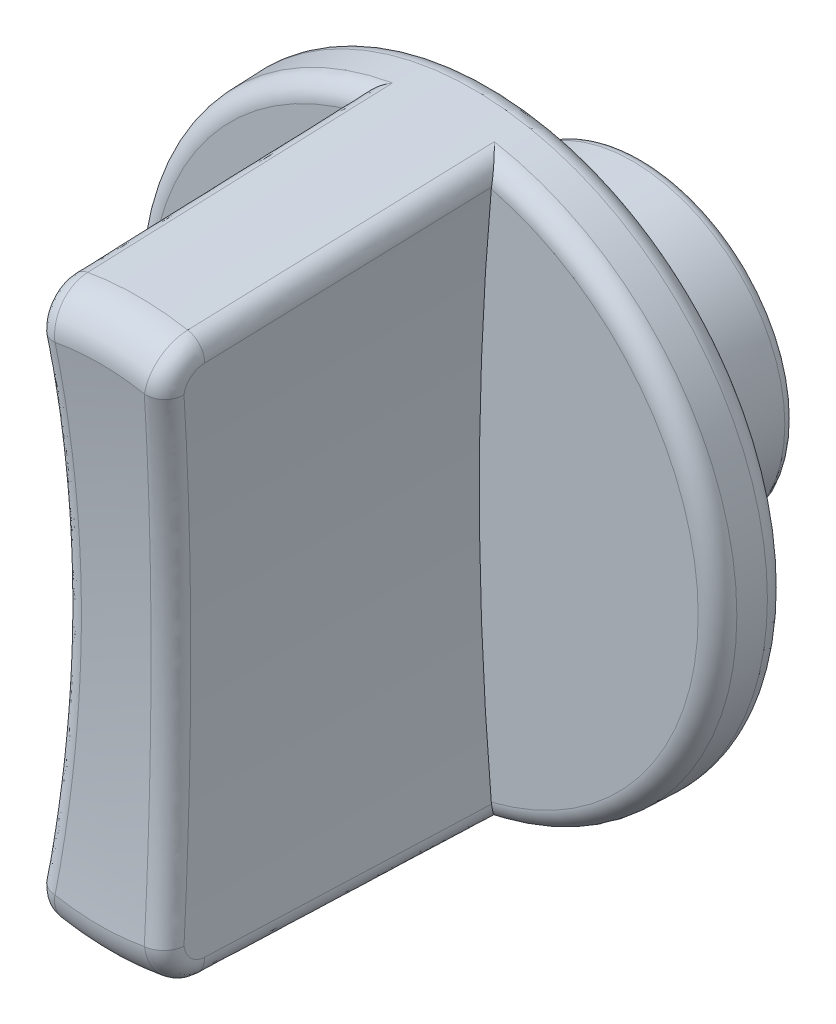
ISO-10303-21;
HEADER;
FILE_DESCRIPTION(('STEP AP214'),'2;1');
FILE_NAME('part.step','',(''),(''),'','','');
FILE_SCHEMA(('AUTOMOTIVE_DESIGN { 1 0 10303 214 1 1 1 1 }'));
ENDSEC;
DATA;
#1=APPLICATION_CONTEXT('core data for automotive mechanical design processes');
#2=APPLICATION_PROTOCOL_DEFINITION('international standard','automotive_design',2000,#1);
#3=PRODUCT_CONTEXT('',#1,'mechanical');
#4=PRODUCT('Part','Part','',(#3));
#5=PRODUCT_RELATED_PRODUCT_CATEGORY('part','',(#4));
#6=PRODUCT_DEFINITION_FORMATION('','',#4);
#7=PRODUCT_DEFINITION_CONTEXT('part definition',#1,'design');
#8=PRODUCT_DEFINITION('design','',#6,#7);
#9=PRODUCT_DEFINITION_SHAPE('','',#8);
#10=(LENGTH_UNIT() NAMED_UNIT(*) SI_UNIT(.MILLI.,.METRE.));
#11=(NAMED_UNIT(*) PLANE_ANGLE_UNIT() SI_UNIT($,.RADIAN.));
#12=(NAMED_UNIT(*) SI_UNIT($,.STERADIAN.) SOLID_ANGLE_UNIT());
#13=UNCERTAINTY_MEASURE_WITH_UNIT(LENGTH_MEASURE(1.E-05),#10,'distance_accuracy_value','');
#14=(GEOMETRIC_REPRESENTATION_CONTEXT(3) GLOBAL_UNCERTAINTY_ASSIGNED_CONTEXT((#13)) GLOBAL_UNIT_ASSIGNED_CONTEXT((#10,
#11,#12)) REPRESENTATION_CONTEXT('',''));
#15=CARTESIAN_POINT('',(0.,0.,0.));
#16=DIRECTION('',(0.,0.,1.));
#17=DIRECTION('',(1.,0.,0.));
#18=AXIS2_PLACEMENT_3D('',#15,#16,#17);
#19=CARTESIAN_POINT('',(0.,0.,9.0348994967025));
#20=DIRECTION('',(0.,0.,-1.));
#21=DIRECTION('',(-1.,0.,0.));
#22=AXIS2_PLACEMENT_3D('',#19,#20,#21);
#23=CONICAL_SURFACE('',#22,14.9638605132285,0.0349065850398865);
#24=CARTESIAN_POINT('',(0.,0.,26.069798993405));
#25=DIRECTION('',(0.,0.,1.));
#26=DIRECTION('',(1.,0.,0.));
#27=AXIS2_PLACEMENT_3D('',#24,#25,#26);
#28=CIRCLE('',#27,14.3689887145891);
#29=CARTESIAN_POINT('',(-2.54030019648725,-14.1426557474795,26.069798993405));
#30=VERTEX_POINT('',#29);
#31=CARTESIAN_POINT('',(2.54030019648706,-14.1426557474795,26.069798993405));
#32=VERTEX_POINT('',#31);
#33=EDGE_CURVE('E166',#30,#32,#28,.T.);
#34=ORIENTED_EDGE('',*,*,#33,.F.);
#35=CARTESIAN_POINT('',(-3.28407586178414,-12.1751022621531,51.8564925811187));
#36=CARTESIAN_POINT('',(-3.3572269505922,-13.0733664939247,51.8881330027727));
#37=CARTESIAN_POINT('',(-2.47072494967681,-13.2386977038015,51.8913920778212));
#38=CARTESIAN_POINT('',(-3.29625817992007,-12.3246956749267,47.5528971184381));
#39=CARTESIAN_POINT('',(-3.37048679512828,-13.2250692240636,47.5802777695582));
#40=CARTESIAN_POINT('',(-2.481761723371,-13.3895173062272,47.5877966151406));
#41=CARTESIAN_POINT('',(-3.30866076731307,-12.4742191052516,43.2492998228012));
#42=CARTESIAN_POINT('',(-3.38395481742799,-13.3764900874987,43.276927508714));
#43=CARTESIAN_POINT('',(-2.49308181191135,-13.5402526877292,43.2841993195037));
#44=CARTESIAN_POINT('',(-3.33390648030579,-12.773135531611,34.6421019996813));
#45=CARTESIAN_POINT('',(-3.4113347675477,-13.6791188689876,34.6698226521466));
#46=CARTESIAN_POINT('',(-2.51627732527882,-13.8415677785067,34.6770014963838));
#47=CARTESIAN_POINT('',(-3.34674960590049,-12.922528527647,30.3385014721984));
#48=CARTESIAN_POINT('',(-3.42524621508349,-13.8303115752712,30.3664881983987));
#49=CARTESIAN_POINT('',(-2.52815275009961,-13.992147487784,30.3734009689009));
#50=CARTESIAN_POINT('',(-3.37287639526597,-13.2211936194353,21.7312975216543));
#51=CARTESIAN_POINT('',(-3.45351306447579,-14.132503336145,21.7593974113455));
#52=CARTESIAN_POINT('',(-2.55244764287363,-14.2931640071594,21.7661970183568));
#53=CARTESIAN_POINT('',(-3.3861600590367,-13.3704657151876,17.4276940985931));
#54=CARTESIAN_POINT('',(-3.46786803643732,-14.2834886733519,17.4560208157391));
#55=CARTESIAN_POINT('',(-2.56486711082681,-14.4436008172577,17.4625935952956));
#56=CARTESIAN_POINT('',(-3.41316792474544,-13.66889656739,8.8204846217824));
#57=CARTESIAN_POINT('',(-3.49702180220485,-14.5852775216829,8.84893399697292));
#58=CARTESIAN_POINT('',(-2.59024087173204,-14.7443416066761,8.8553841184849));
#59=CARTESIAN_POINT('',(-3.42689212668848,-13.8180553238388,4.51687856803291));
#60=CARTESIAN_POINT('',(-3.51182020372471,-14.7360685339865,4.54557049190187));
#61=CARTESIAN_POINT('',(-2.6031951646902,-14.8946455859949,4.55177806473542));
#62=CARTESIAN_POINT('',(-3.44083659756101,-13.9671611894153,0.213271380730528));
#63=CARTESIAN_POINT('',(-3.5268279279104,-14.886650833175,0.24562150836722));
#64=CARTESIAN_POINT('',(-2.61641226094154,-15.0448881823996,0.248170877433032));
#65=(BOUNDED_SURFACE() B_SPLINE_SURFACE(3,2,((#35,#36,#37),(#38,#39,#40),(#41,#42,#43),(#44,#45,
#46),(#47,#48,#49),(#50,#51,#52),(#53,#54,#55),(#56,#57,#58),(#59,#60,#61),(#62,#63,#64)),
.UNSPECIFIED.,.F.,.F.,.F.) B_SPLINE_SURFACE_WITH_KNOTS((4,2,2,2,4),(3,3),(0.,12.9187405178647,
25.8374808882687,38.7562212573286,51.6749617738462),(0.,1.),
.UNSPECIFIED.) GEOMETRIC_REPRESENTATION_ITEM() RATIONAL_B_SPLINE_SURFACE(((1.,0.742631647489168,
1.),(1.,0.741878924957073,1.),(1.,0.74114605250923,1.),(1.,0.739716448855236,1.),(1.,
0.739019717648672,1.),(1.,0.737658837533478,1.),(1.,0.736994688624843,1.),(1.,0.735696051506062,
1.),(1.,0.735061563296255,1.),(1.,0.73444044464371,1.))) REPRESENTATION_ITEM('') SURFACE());
#66=CARTESIAN_POINT('',(-2.47072494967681,-13.2386977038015,51.8913920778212));
#67=CARTESIAN_POINT('',(-2.481761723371,-13.3895173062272,47.5877966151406));
#68=CARTESIAN_POINT('',(-2.49308181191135,-13.5402526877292,43.2841993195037));
#69=CARTESIAN_POINT('',(-2.51627732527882,-13.8415677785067,34.6770014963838));
#70=CARTESIAN_POINT('',(-2.52815275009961,-13.992147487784,30.3734009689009));
#71=CARTESIAN_POINT('',(-2.55244764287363,-14.2931640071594,21.7661970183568));
#72=CARTESIAN_POINT('',(-2.56486711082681,-14.4436008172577,17.4625935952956));
#73=CARTESIAN_POINT('',(-2.59024087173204,-14.7443416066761,8.8553841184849));
#74=CARTESIAN_POINT('',(-2.6031951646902,-14.8946455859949,4.5517780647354));
#75=CARTESIAN_POINT('',(-2.61641226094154,-15.0448881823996,0.248170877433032));
#76=B_SPLINE_CURVE_WITH_KNOTS('',3,(#66,#67,#68,#69,#70,#71,#72,#73,#74,#75),.UNSPECIFIED.,.F.,
.F.,(4,2,2,2,4),(0.,12.9187405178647,25.8374808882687,38.7562212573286,51.6749617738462),.UNSPECIFIED.);
#77=CARTESIAN_POINT('',(-2.58532278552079,-14.6856502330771,10.5348994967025));
#78=VERTEX_POINT('',#77);
#79=EDGE_CURVE('E452',#30,#78,#76,.T.);
#80=ORIENTED_EDGE('',*,*,#79,.T.);
#81=CARTESIAN_POINT('',(0.,0.,10.5348994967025));
#82=DIRECTION('',(0.,0.,-1.));
#83=DIRECTION('',(-1.,0.,0.));
#84=AXIS2_PLACEMENT_3D('',#81,#82,#83);
#85=CIRCLE('',#84,14.9114793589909);
#86=CARTESIAN_POINT('',(-2.58532278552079,14.6856502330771,10.5348994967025));
#87=VERTEX_POINT('',#86);
#88=EDGE_CURVE('E458',#78,#87,#85,.T.);
#89=ORIENTED_EDGE('',*,*,#88,.T.);
#90=CARTESIAN_POINT('',(-2.47072494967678,13.2386977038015,51.8913920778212));
#91=CARTESIAN_POINT('',(-3.35722695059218,13.0733664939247,51.8881330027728));
#92=CARTESIAN_POINT('',(-3.28407586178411,12.1751022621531,51.8564925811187));
#93=CARTESIAN_POINT('',(-2.48176172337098,13.3895173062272,47.5877966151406));
#94=CARTESIAN_POINT('',(-3.37048679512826,13.2250692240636,47.5802777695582));
#95=CARTESIAN_POINT('',(-3.29625817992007,12.3246956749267,47.5528971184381));
#96=CARTESIAN_POINT('',(-2.49308181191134,13.5402526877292,43.2841993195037));
#97=CARTESIAN_POINT('',(-3.38395481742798,13.3764900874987,43.276927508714));
#98=CARTESIAN_POINT('',(-3.30866076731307,12.4742191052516,43.2492998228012));
#99=CARTESIAN_POINT('',(-2.51627732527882,13.8415677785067,34.6770014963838));
#100=CARTESIAN_POINT('',(-3.4113347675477,13.6791188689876,34.6698226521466));
#101=CARTESIAN_POINT('',(-3.33390648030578,12.773135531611,34.6421019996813));
#102=CARTESIAN_POINT('',(-2.5281527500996,13.992147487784,30.3734009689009));
#103=CARTESIAN_POINT('',(-3.42524621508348,13.8303115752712,30.3664881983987));
#104=CARTESIAN_POINT('',(-3.34674960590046,12.922528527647,30.3385014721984));
#105=CARTESIAN_POINT('',(-2.55244764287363,14.2931640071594,21.7661970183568));
#106=CARTESIAN_POINT('',(-3.45351306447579,14.132503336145,21.7593974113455));
#107=CARTESIAN_POINT('',(-3.37287639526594,13.2211936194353,21.7312975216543));
#108=CARTESIAN_POINT('',(-2.56486711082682,14.4436008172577,17.4625935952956));
#109=CARTESIAN_POINT('',(-3.46786803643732,14.2834886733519,17.4560208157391));
#110=CARTESIAN_POINT('',(-3.38616005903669,13.3704657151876,17.4276940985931));
#111=CARTESIAN_POINT('',(-2.59024087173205,14.7443416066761,8.8553841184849));
#112=CARTESIAN_POINT('',(-3.49702180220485,14.5852775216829,8.84893399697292));
#113=CARTESIAN_POINT('',(-3.41316792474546,13.66889656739,8.8204846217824));
#114=CARTESIAN_POINT('',(-2.6031951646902,14.8946455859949,4.55177806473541));
#115=CARTESIAN_POINT('',(-3.51182020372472,14.7360685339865,4.54557049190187));
#116=CARTESIAN_POINT('',(-3.4268921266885,13.8180553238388,4.51687856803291));
#117=CARTESIAN_POINT('',(-2.61641226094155,15.0448881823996,0.248170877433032));
#118=CARTESIAN_POINT('',(-3.52682792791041,14.886650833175,0.24562150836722));
#119=CARTESIAN_POINT('',(-3.44083659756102,13.9671611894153,0.213271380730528));
#120=(BOUNDED_SURFACE() B_SPLINE_SURFACE(3,2,((#90,#91,#92),(#93,#94,#95),(#96,#97,#98),(#99,
#100,#101),(#102,#103,#104),(#105,#106,#107),(#108,#109,#110),(#111,#112,#113),(#114,#115,#116),
(#117,#118,#119)),.UNSPECIFIED.,.F.,.F.,.F.) B_SPLINE_SURFACE_WITH_KNOTS((4,2,2,2,4),(3,3),(0.,
12.9187405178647,25.8374808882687,38.7562212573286,51.6749617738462),(0.,1.),
.UNSPECIFIED.) GEOMETRIC_REPRESENTATION_ITEM() RATIONAL_B_SPLINE_SURFACE(((1.,0.742631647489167,
1.),(1.,0.741878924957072,1.),(1.,0.741146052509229,1.),(1.,0.739716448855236,1.),(1.,
0.739019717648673,1.),(1.,0.737658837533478,1.),(1.,0.736994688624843,1.),(1.,0.735696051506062,
1.),(1.,0.735061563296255,1.),(1.,0.73444044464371,1.))) REPRESENTATION_ITEM('') SURFACE());
#121=CARTESIAN_POINT('',(-2.61641226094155,15.0448881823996,0.248170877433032));
#122=CARTESIAN_POINT('',(-2.6031951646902,14.8946455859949,4.5517780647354));
#123=CARTESIAN_POINT('',(-2.59024087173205,14.7443416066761,8.8553841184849));
#124=CARTESIAN_POINT('',(-2.56486711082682,14.4436008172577,17.4625935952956));
#125=CARTESIAN_POINT('',(-2.55244764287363,14.2931640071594,21.7661970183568));
#126=CARTESIAN_POINT('',(-2.5281527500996,13.992147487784,30.3734009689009));
#127=CARTESIAN_POINT('',(-2.51627732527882,13.8415677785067,34.6770014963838));
#128=CARTESIAN_POINT('',(-2.49308181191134,13.5402526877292,43.2841993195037));
#129=CARTESIAN_POINT('',(-2.48176172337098,13.3895173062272,47.5877966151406));
#130=CARTESIAN_POINT('',(-2.47072494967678,13.2386977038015,51.8913920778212));
#131=B_SPLINE_CURVE_WITH_KNOTS('',3,(#121,#122,#123,#124,#125,#126,#127,#128,#129,#130),
.UNSPECIFIED.,.F.,.F.,(4,2,2,2,4),(0.,12.9187405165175,25.8374808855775,38.7562212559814,
51.6749617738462),.UNSPECIFIED.);
#132=CARTESIAN_POINT('',(-2.54030019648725,14.1426557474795,26.069798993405));
#133=VERTEX_POINT('',#132);
#134=EDGE_CURVE('E147',#87,#133,#131,.T.);
#135=ORIENTED_EDGE('',*,*,#134,.T.);
#136=CARTESIAN_POINT('',(2.54030019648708,14.1426557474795,26.069798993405));
#137=VERTEX_POINT('',#136);
#138=EDGE_CURVE('E154',#137,#133,#28,.T.);
#139=ORIENTED_EDGE('',*,*,#138,.F.);
#140=CARTESIAN_POINT('',(3.28407586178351,12.1751022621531,51.8564925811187));
#141=CARTESIAN_POINT('',(3.35722695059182,13.0733664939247,51.8881330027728));
#142=CARTESIAN_POINT('',(2.47072494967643,13.2386977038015,51.8913920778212));
#143=CARTESIAN_POINT('',(3.2962581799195,12.3246956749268,47.5528971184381));
#144=CARTESIAN_POINT('',(3.37048679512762,13.2250692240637,47.5802777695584));
#145=CARTESIAN_POINT('',(2.48176172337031,13.3895173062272,47.5877966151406));
#146=CARTESIAN_POINT('',(3.30866076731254,12.4742191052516,43.2492998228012));
#147=CARTESIAN_POINT('',(3.38395481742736,13.3764900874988,43.2769275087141));
#148=CARTESIAN_POINT('',(2.49308181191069,13.5402526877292,43.2841993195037));
#149=CARTESIAN_POINT('',(3.33390648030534,12.773135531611,34.6421019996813));
#150=CARTESIAN_POINT('',(3.4113347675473,13.6791188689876,34.6698226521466));
#151=CARTESIAN_POINT('',(2.5162773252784,13.8415677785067,34.6770014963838));
#152=CARTESIAN_POINT('',(3.34674960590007,12.922528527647,30.3385014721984));
#153=CARTESIAN_POINT('',(3.42524621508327,13.8303115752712,30.3664881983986));
#154=CARTESIAN_POINT('',(2.52815275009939,13.992147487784,30.3734009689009));
#155=CARTESIAN_POINT('',(3.3728763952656,13.2211936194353,21.7312975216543));
#156=CARTESIAN_POINT('',(3.45351306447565,14.132503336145,21.7593974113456));
#157=CARTESIAN_POINT('',(2.55244764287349,14.2931640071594,21.7661970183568));
#158=CARTESIAN_POINT('',(3.38616005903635,13.3704657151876,17.4276940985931));
#159=CARTESIAN_POINT('',(3.46786803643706,14.2834886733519,17.4560208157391));
#160=CARTESIAN_POINT('',(2.56486711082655,14.4436008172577,17.4625935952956));
#161=CARTESIAN_POINT('',(3.41316792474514,13.66889656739,8.82048462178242));
#162=CARTESIAN_POINT('',(3.4970218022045,14.585277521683,8.84893399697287));
#163=CARTESIAN_POINT('',(2.59024087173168,14.7443416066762,8.85538411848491));
#164=CARTESIAN_POINT('',(3.4268921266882,13.8180553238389,4.51687856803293));
#165=CARTESIAN_POINT('',(3.5118202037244,14.7360685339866,4.54557049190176));
#166=CARTESIAN_POINT('',(2.60319516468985,14.8946455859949,4.55177806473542));
#167=CARTESIAN_POINT('',(3.44083659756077,13.9671611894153,0.213271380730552));
#168=CARTESIAN_POINT('',(3.52682792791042,14.886650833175,0.245621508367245));
#169=CARTESIAN_POINT('',(2.61641226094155,15.0448881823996,0.24817087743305));
#170=(BOUNDED_SURFACE() B_SPLINE_SURFACE(3,2,((#140,#141,#142),(#143,#144,#145),(#146,#147,
#148),(#149,#150,#151),(#152,#153,#154),(#155,#156,#157),(#158,#159,#160),(#161,#162,#163),
(#164,#165,#166),(#167,#168,#169)),.UNSPECIFIED.,.F.,.F.,.F.) B_SPLINE_SURFACE_WITH_KNOTS((4,2,
2,2,4),(3,3),(0.,12.9187405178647,25.8374808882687,38.7562212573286,51.6749617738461),(0.,1.),
.UNSPECIFIED.) GEOMETRIC_REPRESENTATION_ITEM() RATIONAL_B_SPLINE_SURFACE(((1.,0.742631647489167,
1.),(1.,0.741878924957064,1.),(1.,0.741146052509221,1.),(1.,0.739716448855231,1.),(1.,
0.739019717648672,1.),(1.,0.737658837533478,1.),(1.,0.73699468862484,1.),(1.,0.735696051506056,
1.),(1.,0.735061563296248,1.),(1.,0.73444044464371,1.))) REPRESENTATION_ITEM('') SURFACE());
#171=CARTESIAN_POINT('',(2.47072494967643,13.2386977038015,51.8913920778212));
#172=CARTESIAN_POINT('',(2.48176172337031,13.3895173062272,47.5877966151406));
#173=CARTESIAN_POINT('',(2.49308181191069,13.5402526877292,43.2841993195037));
#174=CARTESIAN_POINT('',(2.5162773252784,13.8415677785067,34.6770014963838));
#175=CARTESIAN_POINT('',(2.52815275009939,13.992147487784,30.3734009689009));
#176=CARTESIAN_POINT('',(2.55244764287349,14.2931640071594,21.7661970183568));
#177=CARTESIAN_POINT('',(2.56486711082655,14.4436008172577,17.4625935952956));
#178=CARTESIAN_POINT('',(2.59024087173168,14.7443416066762,8.8553841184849));
#179=CARTESIAN_POINT('',(2.60319516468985,14.8946455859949,4.55177806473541));
#180=CARTESIAN_POINT('',(2.61641226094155,15.0448881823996,0.24817087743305));
#181=B_SPLINE_CURVE_WITH_KNOTS('',3,(#171,#172,#173,#174,#175,#176,#177,#178,#179,#180),
.UNSPECIFIED.,.F.,.F.,(4,2,2,2,4),(0.,12.9187405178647,25.8374808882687,38.7562212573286,
51.6749617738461),.UNSPECIFIED.);
#182=CARTESIAN_POINT('',(2.58532278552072,14.6856502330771,10.5348994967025));
#183=VERTEX_POINT('',#182);
#184=EDGE_CURVE('E140',#137,#183,#181,.T.);
#185=ORIENTED_EDGE('',*,*,#184,.T.);
#186=CARTESIAN_POINT('',(0.,0.,10.5348994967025));
#187=DIRECTION('',(0.,0.,-1.));
#188=DIRECTION('',(-1.,0.,0.));
#189=AXIS2_PLACEMENT_3D('',#186,#187,#188);
#190=CIRCLE('',#189,14.9114793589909);
#191=CARTESIAN_POINT('',(2.58532278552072,-14.6856502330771,10.5348994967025));
#192=VERTEX_POINT('',#191);
#193=EDGE_CURVE('E148',#183,#192,#190,.T.);
#194=ORIENTED_EDGE('',*,*,#193,.T.);
#195=CARTESIAN_POINT('',(2.47072494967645,-13.2386977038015,51.8913920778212));
#196=CARTESIAN_POINT('',(3.35722695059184,-13.0733664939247,51.8881330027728));
#197=CARTESIAN_POINT('',(3.28407586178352,-12.1751022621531,51.8564925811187));
#198=CARTESIAN_POINT('',(2.48176172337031,-13.3895173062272,47.5877966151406));
#199=CARTESIAN_POINT('',(3.37048679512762,-13.2250692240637,47.5802777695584));
#200=CARTESIAN_POINT('',(3.29625817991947,-12.3246956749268,47.5528971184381));
#201=CARTESIAN_POINT('',(2.49308181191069,-13.5402526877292,43.2841993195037));
#202=CARTESIAN_POINT('',(3.38395481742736,-13.3764900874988,43.2769275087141));
#203=CARTESIAN_POINT('',(3.30866076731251,-12.4742191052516,43.2492998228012));
#204=CARTESIAN_POINT('',(2.5162773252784,-13.8415677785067,34.6770014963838));
#205=CARTESIAN_POINT('',(3.41133476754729,-13.6791188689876,34.6698226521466));
#206=CARTESIAN_POINT('',(3.33390648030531,-12.773135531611,34.6421019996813));
#207=CARTESIAN_POINT('',(2.52815275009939,-13.992147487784,30.3734009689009));
#208=CARTESIAN_POINT('',(3.42524621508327,-13.8303115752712,30.3664881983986));
#209=CARTESIAN_POINT('',(3.34674960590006,-12.922528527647,30.3385014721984));
#210=CARTESIAN_POINT('',(2.55244764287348,-14.2931640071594,21.7661970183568));
#211=CARTESIAN_POINT('',(3.45351306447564,-14.132503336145,21.7593974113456));
#212=CARTESIAN_POINT('',(3.37287639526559,-13.2211936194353,21.7312975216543));
#213=CARTESIAN_POINT('',(2.56486711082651,-14.4436008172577,17.4625935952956));
#214=CARTESIAN_POINT('',(3.46786803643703,-14.2834886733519,17.4560208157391));
#215=CARTESIAN_POINT('',(3.38616005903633,-13.3704657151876,17.4276940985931));
#216=CARTESIAN_POINT('',(2.59024087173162,-14.7443416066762,8.85538411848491));
#217=CARTESIAN_POINT('',(3.49702180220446,-14.585277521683,8.84893399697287));
#218=CARTESIAN_POINT('',(3.41316792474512,-13.6688965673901,8.82048462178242));
#219=CARTESIAN_POINT('',(2.60319516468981,-14.8946455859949,4.55177806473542));
#220=CARTESIAN_POINT('',(3.51182020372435,-14.7360685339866,4.54557049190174));
#221=CARTESIAN_POINT('',(3.4268921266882,-13.8180553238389,4.51687856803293));
#222=CARTESIAN_POINT('',(2.61641226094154,-15.0448881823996,0.24817087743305));
#223=CARTESIAN_POINT('',(3.5268279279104,-14.886650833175,0.245621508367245));
#224=CARTESIAN_POINT('',(3.44083659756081,-13.9671611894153,0.213271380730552));
#225=(BOUNDED_SURFACE() B_SPLINE_SURFACE(3,2,((#195,#196,#197),(#198,#199,#200),(#201,#202,
#203),(#204,#205,#206),(#207,#208,#209),(#210,#211,#212),(#213,#214,#215),(#216,#217,#218),
(#219,#220,#221),(#222,#223,#224)),.UNSPECIFIED.,.F.,.F.,.F.) B_SPLINE_SURFACE_WITH_KNOTS((4,2,
2,2,4),(3,3),(0.,12.9187405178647,25.8374808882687,38.7562212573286,51.6749617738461),(0.,1.),
.UNSPECIFIED.) GEOMETRIC_REPRESENTATION_ITEM() RATIONAL_B_SPLINE_SURFACE(((1.,0.742631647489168,
1.),(1.,0.741878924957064,1.),(1.,0.74114605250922,1.),(1.,0.739716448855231,1.),(1.,
0.739019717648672,1.),(1.,0.737658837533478,1.),(1.,0.736994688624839,1.),(1.,0.735696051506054,
1.),(1.,0.735061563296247,1.),(1.,0.73444044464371,1.))) REPRESENTATION_ITEM('') SURFACE());
#226=CARTESIAN_POINT('',(2.61641226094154,-15.0448881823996,0.24817087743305));
#227=CARTESIAN_POINT('',(2.60319516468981,-14.8946455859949,4.55177806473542));
#228=CARTESIAN_POINT('',(2.59024087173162,-14.7443416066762,8.85538411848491));
#229=CARTESIAN_POINT('',(2.56486711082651,-14.4436008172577,17.4625935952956));
#230=CARTESIAN_POINT('',(2.55244764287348,-14.2931640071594,21.7661970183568));
#231=CARTESIAN_POINT('',(2.52815275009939,-13.992147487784,30.3734009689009));
#232=CARTESIAN_POINT('',(2.5162773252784,-13.8415677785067,34.6770014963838));
#233=CARTESIAN_POINT('',(2.49308181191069,-13.5402526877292,43.2841993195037));
#234=CARTESIAN_POINT('',(2.48176172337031,-13.3895173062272,47.5877966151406));
#235=CARTESIAN_POINT('',(2.47072494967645,-13.2386977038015,51.8913920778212));
#236=B_SPLINE_CURVE_WITH_KNOTS('',3,(#226,#227,#228,#229,#230,#231,#232,#233,#234,#235),
.UNSPECIFIED.,.F.,.F.,(4,2,2,2,4),(0.,12.9187405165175,25.8374808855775,38.7562212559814,
51.6749617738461),.UNSPECIFIED.);
#237=EDGE_CURVE('E476',#192,#32,#236,.T.);
#238=ORIENTED_EDGE('',*,*,#237,.T.);
#239=EDGE_LOOP('',(#34,#80,#89,#135,#139,#185,#194,#238));
#240=FACE_BOUND('',#239,.T.);
#241=CARTESIAN_POINT('',(0.,0.,9.0348994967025));
#242=DIRECTION('',(0.,0.,1.));
#243=DIRECTION('',(1.,0.,0.));
#244=AXIS2_PLACEMENT_3D('',#241,#242,#243);
#245=CIRCLE('',#244,14.9638605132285);
#246=CARTESIAN_POINT('',(14.9638605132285,0.,9.03489949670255));
#247=VERTEX_POINT('',#246);
#248=EDGE_CURVE('E165',#247,#247,#245,.T.);
#249=ORIENTED_EDGE('',*,*,#248,.T.);
#250=EDGE_LOOP('',(#249));
#251=FACE_BOUND('',#250,.T.);
#252=ADVANCED_FACE('F15',(#240,#251),#23,.T.);
#253=CARTESIAN_POINT('',(0.,0.,26.));
#254=DIRECTION('',(0.,0.,1.));
#255=DIRECTION('',(1.,0.,0.));
#256=AXIS2_PLACEMENT_3D('',#253,#254,#255);
#257=TOROIDAL_SURFACE('',#256,12.3702070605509,2.);
#258=CARTESIAN_POINT('',(-5.10022096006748,26.2293832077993,30.1580238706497));
#259=CARTESIAN_POINT('',(-5.04919899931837,25.9420955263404,31.1080364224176));
#260=CARTESIAN_POINT('',(-4.07040142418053,26.1140892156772,31.1139337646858));
#261=CARTESIAN_POINT('',(-4.91107231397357,25.1644836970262,29.8236073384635));
#262=CARTESIAN_POINT('',(-4.86389549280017,24.8867519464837,30.7789353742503));
#263=CARTESIAN_POINT('',(-3.88208420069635,25.0538705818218,30.7831921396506));
#264=CARTESIAN_POINT('',(-4.73239782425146,24.0913982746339,29.509585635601));
#265=CARTESIAN_POINT('',(-4.6891052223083,23.8247402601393,30.4703352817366));
#266=CARTESIAN_POINT('',(-3.70419509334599,23.985502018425,30.4726212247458));
#267=CARTESIAN_POINT('',(-4.39697538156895,21.9307162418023,28.922845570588));
#268=CARTESIAN_POINT('',(-4.36095056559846,21.6864324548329,29.8936616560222));
#269=CARTESIAN_POINT('',(-3.37024703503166,21.8343174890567,29.892328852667));
#270=CARTESIAN_POINT('',(-4.24022820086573,20.8431191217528,28.6501286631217));
#271=CARTESIAN_POINT('',(-4.20766672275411,20.6103663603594,29.6257351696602));
#272=CARTESIAN_POINT('',(-3.21418885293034,20.7515010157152,29.6226088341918));
#273=CARTESIAN_POINT('',(-3.94963897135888,18.6552510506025,28.1465128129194));
#274=CARTESIAN_POINT('',(-3.92346310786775,18.4457423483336,29.1308863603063));
#275=CARTESIAN_POINT('',(-2.92487693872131,18.5732499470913,29.1245272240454));
#276=CARTESIAN_POINT('',(-3.81579898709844,17.5549789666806,27.9156176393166));
#277=CARTESIAN_POINT('',(-3.79261814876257,17.3574384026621,28.9040978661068));
#278=CARTESIAN_POINT('',(-2.79162526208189,17.4778142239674,28.8961693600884));
#279=CARTESIAN_POINT('',(-3.57185939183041,15.3439948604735,27.4961236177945));
#280=CARTESIAN_POINT('',(-3.55410366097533,15.1704760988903,28.4919953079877));
#281=CARTESIAN_POINT('',(-2.54875792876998,15.2765487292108,28.4812851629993));
#282=CARTESIAN_POINT('',(-3.46175936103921,14.2332830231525,27.307524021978));
#283=CARTESIAN_POINT('',(-3.44649739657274,14.0720941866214,28.3067925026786));
#284=CARTESIAN_POINT('',(-2.43914185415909,14.1707191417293,28.2947580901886));
#285=CARTESIAN_POINT('',(-3.17384143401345,10.9534047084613,26.8154875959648));
#286=CARTESIAN_POINT('',(-3.16488899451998,10.8268209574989,27.8232430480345));
#287=CARTESIAN_POINT('',(-2.15248950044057,10.9052578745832,27.808128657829));
#288=CARTESIAN_POINT('',(-3.02984120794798,8.77210691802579,26.5710741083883));
#289=CARTESIAN_POINT('',(-3.02430957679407,8.67116249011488,27.5834882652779));
#290=CARTESIAN_POINT('',(-2.00912224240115,8.73354820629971,27.5664010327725));
#291=CARTESIAN_POINT('',(-2.83750095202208,4.39387142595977,26.2450475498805));
#292=CARTESIAN_POINT('',(-2.83634308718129,4.34250856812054,27.2633382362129));
#293=CARTESIAN_POINT('',(-1.81762743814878,4.3745577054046,27.2439571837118));
#294=CARTESIAN_POINT('',(-2.78914896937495,2.19693571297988,26.1634141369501));
#295=CARTESIAN_POINT('',(-2.78914896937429,2.17185387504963,27.1832722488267));
#296=CARTESIAN_POINT('',(-1.76948799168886,2.1872788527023,27.1632208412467));
#297=CARTESIAN_POINT('',(-2.78914896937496,-2.1969357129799,26.1634141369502));
#298=CARTESIAN_POINT('',(-2.78914896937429,-2.17185387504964,27.1832722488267));
#299=CARTESIAN_POINT('',(-1.76948799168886,-2.18727885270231,27.1632208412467));
#300=CARTESIAN_POINT('',(-2.83750095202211,-4.3938714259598,26.2450475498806));
#301=CARTESIAN_POINT('',(-2.83634308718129,-4.34250856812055,27.2633382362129));
#302=CARTESIAN_POINT('',(-1.81762743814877,-4.37455770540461,27.2439571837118));
#303=CARTESIAN_POINT('',(-3.02984120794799,-8.77210691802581,26.5710741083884));
#304=CARTESIAN_POINT('',(-3.02430957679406,-8.6711624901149,27.583488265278));
#305=CARTESIAN_POINT('',(-2.00912224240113,-8.73354820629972,27.5664010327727));
#306=CARTESIAN_POINT('',(-3.17384143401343,-10.9534047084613,26.8154875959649));
#307=CARTESIAN_POINT('',(-3.16488899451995,-10.8268209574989,27.8232430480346));
#308=CARTESIAN_POINT('',(-2.15248950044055,-10.9052578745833,27.8081286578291));
#309=CARTESIAN_POINT('',(-3.4617593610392,-14.2332830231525,27.3075240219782));
#310=CARTESIAN_POINT('',(-3.44649739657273,-14.0720941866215,28.3067925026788));
#311=CARTESIAN_POINT('',(-2.43914185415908,-14.1707191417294,28.2947580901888));
#312=CARTESIAN_POINT('',(-3.5718593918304,-15.3439948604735,27.4961236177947));
#313=CARTESIAN_POINT('',(-3.55410366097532,-15.1704760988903,28.4919953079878));
#314=CARTESIAN_POINT('',(-2.54875792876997,-15.2765487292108,28.4812851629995));
#315=CARTESIAN_POINT('',(-3.81579898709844,-17.5549789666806,27.9156176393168));
#316=CARTESIAN_POINT('',(-3.79261814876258,-17.3574384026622,28.904097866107));
#317=CARTESIAN_POINT('',(-2.7916252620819,-17.4778142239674,28.8961693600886));
#318=CARTESIAN_POINT('',(-3.94963897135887,-18.6552510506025,28.1465128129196));
#319=CARTESIAN_POINT('',(-3.92346310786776,-18.4457423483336,29.1308863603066));
#320=CARTESIAN_POINT('',(-2.92487693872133,-18.5732499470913,29.1245272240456));
#321=CARTESIAN_POINT('',(-4.24022820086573,-20.8431191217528,28.650128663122));
#322=CARTESIAN_POINT('',(-4.20766672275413,-20.6103663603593,29.6257351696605));
#323=CARTESIAN_POINT('',(-3.21418885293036,-20.7515010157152,29.622608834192));
#324=CARTESIAN_POINT('',(-4.39697538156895,-21.9307162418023,28.9228455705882));
#325=CARTESIAN_POINT('',(-4.36095056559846,-21.6864324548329,29.8936616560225));
#326=CARTESIAN_POINT('',(-3.37024703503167,-21.8343174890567,29.8923288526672));
#327=CARTESIAN_POINT('',(-4.73239782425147,-24.0913982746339,29.5095856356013));
#328=CARTESIAN_POINT('',(-4.6891052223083,-23.8247402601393,30.4703352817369));
#329=CARTESIAN_POINT('',(-3.70419509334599,-23.985502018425,30.4726212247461));
#330=CARTESIAN_POINT('',(-4.91107231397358,-25.1644836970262,29.8236073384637));
#331=CARTESIAN_POINT('',(-4.86389549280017,-24.8867519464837,30.7789353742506));
#332=CARTESIAN_POINT('',(-3.88208420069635,-25.0538705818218,30.7831921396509));
#333=CARTESIAN_POINT('',(-5.10022096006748,-26.2293832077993,30.15802387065));
#334=CARTESIAN_POINT('',(-5.0491989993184,-25.9420955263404,31.1080364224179));
#335=CARTESIAN_POINT('',(-4.07040142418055,-26.1140892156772,31.1139337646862));
#336=(BOUNDED_SURFACE() B_SPLINE_SURFACE(3,2,((#258,#259,#260),(#261,#262,#263),(#264,#265,
#266),(#267,#268,#269),(#270,#271,#272),(#273,#274,#275),(#276,#277,#278),(#279,#280,#281),
(#282,#283,#284),(#285,#286,#287),(#288,#289,#290),(#291,#292,#293),(#294,#295,#296),(#297,#298,
#299),(#300,#301,#302),(#303,#304,#305),(#306,#307,#308),(#309,#310,#311),(#312,#313,#314),
(#315,#316,#317),(#318,#319,#320),(#321,#322,#323),(#324,#325,#326),(#327,#328,#329),(#330,#331,
#332),(#333,#334,#335)),.UNSPECIFIED.,.F.,.F.,.F.) B_SPLINE_SURFACE_WITH_KNOTS((4,2,2,2,2,2,2,2,
2,2,2,2,4),(3,3),(0.,3.41667725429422,6.83347481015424,10.250580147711,13.6676250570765,
20.3013017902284,26.9341494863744,33.5669971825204,40.2006739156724,43.6177188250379,
47.0348241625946,50.4516217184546,53.8682989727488),(0.,1.),
.UNSPECIFIED.) GEOMETRIC_REPRESENTATION_ITEM() RATIONAL_B_SPLINE_SURFACE(((1.,0.709298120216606,
1.),(1.,0.708551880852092,1.),(1.,0.707845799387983,1.),(1.,0.706518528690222,1.),(1.,
0.705897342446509,1.),(1.,0.704744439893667,1.),(1.,0.704212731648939,1.),(1.,0.703242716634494,
1.),(1.,0.702804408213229,1.),(1.,0.701657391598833,1.),(1.,0.701082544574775,1.),(1.,
0.700314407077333,1.),(1.,0.700121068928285,1.),(1.,0.700121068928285,1.),(1.,0.700314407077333,
1.),(1.,0.701082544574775,1.),(1.,0.701657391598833,1.),(1.,0.702804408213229,1.),(1.,
0.703242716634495,1.),(1.,0.70421273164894,1.),(1.,0.704744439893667,1.),(1.,0.70589734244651,
1.),(1.,0.706518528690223,1.),(1.,0.707845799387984,1.),(1.,0.708551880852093,1.),(1.,
0.709298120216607,1.))) REPRESENTATION_ITEM('') SURFACE());
#337=CARTESIAN_POINT('',(-2.26545380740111,-12.1609926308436,28.));
#338=CARTESIAN_POINT('',(-2.26777941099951,-12.1605218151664,28.0000000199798));
#339=CARTESIAN_POINT('',(-2.27011553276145,-12.1601298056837,28.0000000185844));
#340=CARTESIAN_POINT('',(-2.27480882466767,-12.1595033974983,27.9999999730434));
#341=CARTESIAN_POINT('',(-2.27716599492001,-12.1592689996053,27.9999999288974));
#342=CARTESIAN_POINT('',(-2.27953368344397,-12.1591134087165,27.9999998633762));
#343=B_SPLINE_CURVE_WITH_KNOTS('',3,(#337,#338,#339,#340,#341,#342),.UNSPECIFIED.,.F.,.F.,(4,2,
4),(0.,0.00710635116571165,0.01421273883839),.UNSPECIFIED.);
#344=CARTESIAN_POINT('',(-2.26545380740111,-12.1609926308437,28.));
#345=VERTEX_POINT('',#344);
#346=CARTESIAN_POINT('',(-2.27953368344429,-12.1591134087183,27.9999998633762));
#347=VERTEX_POINT('',#346);
#348=EDGE_CURVE('E434',#345,#347,#343,.T.);
#349=ORIENTED_EDGE('',*,*,#348,.T.);
#350=CARTESIAN_POINT('',(-2.53653713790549,-14.1136545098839,25.6524571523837));
#351=CARTESIAN_POINT('',(-3.43692781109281,-13.9543847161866,25.6666827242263));
#352=CARTESIAN_POINT('',(-3.35854418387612,-13.0573486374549,25.8262285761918));
#353=CARTESIAN_POINT('',(-2.53810104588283,-14.1257062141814,25.7212084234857));
#354=CARTESIAN_POINT('',(-3.43794104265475,-13.965558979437,25.7326743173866));
#355=CARTESIAN_POINT('',(-3.35907128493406,-13.0633794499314,25.8606042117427));
#356=CARTESIAN_POINT('',(-2.53919855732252,-14.1341647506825,25.7905710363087));
#357=CARTESIAN_POINT('',(-3.4386524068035,-13.9733995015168,25.7992134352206));
#358=CARTESIAN_POINT('',(-3.35944138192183,-13.0676121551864,25.8952855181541));
#359=CARTESIAN_POINT('',(-2.54045624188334,-14.1438582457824,25.9299207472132));
#360=CARTESIAN_POINT('',(-3.43946762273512,-13.9823822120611,25.932823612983));
#361=CARTESIAN_POINT('',(-3.35986559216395,-13.0724628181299,25.9649603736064));
#362=CARTESIAN_POINT('',(-2.54061493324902,-14.1450817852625,25.9999086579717));
#363=CARTESIAN_POINT('',(-3.43957072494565,-13.9835161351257,25.9999125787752));
#364=CARTESIAN_POINT('',(-3.3599192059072,-13.0730750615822,25.9999543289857));
#365=CARTESIAN_POINT('',(-2.53979595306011,-14.138768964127,26.1817711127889));
#366=CARTESIAN_POINT('',(-3.4390395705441,-13.977666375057,26.1742564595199));
#367=CARTESIAN_POINT('',(-3.35964284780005,-13.0699161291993,26.0908855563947));
#368=CARTESIAN_POINT('',(-2.53807653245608,-14.1255145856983,26.2934927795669));
#369=CARTESIAN_POINT('',(-3.43792355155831,-13.9653793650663,26.2814240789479));
#370=CARTESIAN_POINT('',(-3.3590624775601,-13.0632836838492,26.1467463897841));
#371=CARTESIAN_POINT('',(-2.53225104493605,-14.0806305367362,26.5131195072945));
#372=CARTESIAN_POINT('',(-3.43415179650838,-13.9237441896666,26.4923972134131));
#373=CARTESIAN_POINT('',(-3.3571006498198,-13.0408228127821,26.2565597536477));
#374=CARTESIAN_POINT('',(-2.52814354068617,-14.0489897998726,26.6210222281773));
#375=CARTESIAN_POINT('',(-3.43149263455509,-13.8943581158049,26.5962682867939));
#376=CARTESIAN_POINT('',(-3.35571870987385,-13.0249888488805,26.3105111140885));
#377=CARTESIAN_POINT('',(-2.51765575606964,-13.9682663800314,26.8298883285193));
#378=CARTESIAN_POINT('',(-3.42472668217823,-13.8192784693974,26.7979353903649));
#379=CARTESIAN_POINT('',(-3.352202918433,-12.9845894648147,26.4149441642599));
#380=CARTESIAN_POINT('',(-2.51127646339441,-13.9191912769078,26.9308547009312));
#381=CARTESIAN_POINT('',(-3.42061611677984,-13.7735427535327,26.895792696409));
#382=CARTESIAN_POINT('',(-3.35006939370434,-12.9600278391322,26.4654273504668));
#383=CARTESIAN_POINT('',(-2.49641729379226,-13.8050114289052,27.1230473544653));
#384=CARTESIAN_POINT('',(-3.41108321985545,-13.6668880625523,27.0829795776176));
#385=CARTESIAN_POINT('',(-3.34512397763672,-12.9028761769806,26.5615236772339));
#386=CARTESIAN_POINT('',(-2.4879372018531,-13.7399050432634,27.2142726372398));
#387=CARTESIAN_POINT('',(-3.40565474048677,-13.6058991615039,27.1723525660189));
#388=CARTESIAN_POINT('',(-3.34231201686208,-12.8702853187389,26.6071363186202));
#389=CARTESIAN_POINT('',(-2.46908943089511,-13.5954148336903,27.3845687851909));
#390=CARTESIAN_POINT('',(-3.39365068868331,-13.4701119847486,27.3404193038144));
#391=CARTESIAN_POINT('',(-3.33609996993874,-12.7979475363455,26.6922843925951));
#392=CARTESIAN_POINT('',(-2.4587185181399,-13.5160065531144,27.4636183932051));
#393=CARTESIAN_POINT('',(-3.38706594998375,-13.395206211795,27.4191191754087));
#394=CARTESIAN_POINT('',(-3.33269887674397,-12.7581883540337,26.7318091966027));
#395=CARTESIAN_POINT('',(-2.43637743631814,-13.3452616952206,27.6071770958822));
#396=CARTESIAN_POINT('',(-3.37296064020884,-13.2334658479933,27.5636105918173));
#397=CARTESIAN_POINT('',(-3.32542461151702,-12.6726847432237,26.8035885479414));
#398=CARTESIAN_POINT('',(-2.42440716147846,-13.2539243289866,27.671685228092));
#399=CARTESIAN_POINT('',(-3.3654321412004,-13.146536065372,27.6294028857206));
#400=CARTESIAN_POINT('',(-3.32155140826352,-12.6269399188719,26.835842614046));
#401=CARTESIAN_POINT('',(-2.39913642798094,-13.0615299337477,27.7846111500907));
#402=CARTESIAN_POINT('',(-3.34963230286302,-12.9624623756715,27.7465483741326));
#403=CARTESIAN_POINT('',(-3.31344101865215,-12.5305657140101,26.8923055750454));
#404=CARTESIAN_POINT('',(-2.38583073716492,-12.9604347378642,27.8329621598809));
#405=CARTESIAN_POINT('',(-3.34135028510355,-12.8651811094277,27.7978151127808));
#406=CARTESIAN_POINT('',(-3.30920241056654,-12.4799171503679,26.9164810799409));
#407=CARTESIAN_POINT('',(-2.35828870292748,-12.7517205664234,27.911885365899));
#408=CARTESIAN_POINT('',(-3.32430943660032,-12.6630601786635,27.8840705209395));
#409=CARTESIAN_POINT('',(-3.30050751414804,-12.3753314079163,26.95594268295));
#410=CARTESIAN_POINT('',(-2.34405238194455,-12.6441017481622,27.942457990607));
#411=CARTESIAN_POINT('',(-3.31554350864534,-12.5581272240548,27.9190056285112));
#412=CARTESIAN_POINT('',(-3.29605123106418,-12.3213943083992,26.9712289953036));
#413=CARTESIAN_POINT('',(-2.31496623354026,-12.4248783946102,27.9850986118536));
#414=CARTESIAN_POINT('',(-3.29773683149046,-12.3427725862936,27.9715668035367));
#415=CARTESIAN_POINT('',(-3.28703416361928,-12.2114994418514,26.9925493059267));
#416=CARTESIAN_POINT('',(-2.30011392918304,-12.3132580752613,27.9970825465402));
#417=CARTESIAN_POINT('',(-3.2886896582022,-12.2322516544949,27.9890314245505));
#418=CARTESIAN_POINT('',(-3.28247299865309,-12.1555336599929,26.9985412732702));
#419=CARTESIAN_POINT('',(-2.27025985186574,-12.0896276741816,28.0019761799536));
#420=CARTESIAN_POINT('',(-3.27060012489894,-12.0089238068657,28.005565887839));
#421=CARTESIAN_POINT('',(-3.27339685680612,-12.0433816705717,27.0009880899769));
#422=CARTESIAN_POINT('',(-2.25525804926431,-11.9776175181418,27.9948820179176));
#423=CARTESIAN_POINT('',(-3.26155455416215,-11.8960629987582,28.004526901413));
#424=CARTESIAN_POINT('',(-3.26888188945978,-11.9871954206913,26.9974410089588));
#425=CARTESIAN_POINT('',(-2.22548303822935,-11.75608355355,27.9617454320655));
#426=CARTESIAN_POINT('',(-3.24368390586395,-11.6707215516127,27.983549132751));
#427=CARTESIAN_POINT('',(-3.26001246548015,-11.8760444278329,26.9808727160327));
#428=CARTESIAN_POINT('',(-2.21071058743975,-11.6465675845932,27.9356500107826));
#429=CARTESIAN_POINT('',(-3.2348593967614,-11.5582263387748,27.9634374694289));
#430=CARTESIAN_POINT('',(-3.25565849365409,-11.821083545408,26.9678250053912));
#431=CARTESIAN_POINT('',(-2.18184746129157,-11.4333419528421,27.8652599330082));
#432=CARTESIAN_POINT('',(-3.21767584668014,-11.3369636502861,27.904295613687));
#433=CARTESIAN_POINT('',(-3.24723521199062,-11.7140515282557,26.9326299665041));
#434=CARTESIAN_POINT('',(-2.16775728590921,-11.3296365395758,27.8209521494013));
#435=CARTESIAN_POINT('',(-3.20932025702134,-11.2282244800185,27.8651311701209));
#436=CARTESIAN_POINT('',(-3.24316610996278,-11.6619825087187,26.9104760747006));
#437=CARTESIAN_POINT('',(-2.15422439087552,-11.2304160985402,27.7679622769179));
#438=CARTESIAN_POINT('',(-3.20134856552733,-11.1234113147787,27.8167118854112));
#439=CARTESIAN_POINT('',(-3.23929810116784,-11.6121533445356,26.8839811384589));
#440=(BOUNDED_SURFACE() B_SPLINE_SURFACE(3,2,((#350,#351,#352),(#353,#354,#355),(#356,#357,
#358),(#359,#360,#361),(#362,#363,#364),(#365,#366,#367),(#368,#369,#370),(#371,#372,#373),
(#374,#375,#376),(#377,#378,#379),(#380,#381,#382),(#383,#384,#385),(#386,#387,#388),(#389,#390,
#391),(#392,#393,#394),(#395,#396,#397),(#398,#399,#400),(#401,#402,#403),(#404,#405,#406),
(#407,#408,#409),(#410,#411,#412),(#413,#414,#415),(#416,#417,#418),(#419,#420,#421),(#422,#423,
#424),(#425,#426,#427),(#428,#429,#430),(#431,#432,#433),(#434,#435,#436),(#437,#438,#439)),
.UNSPECIFIED.,.F.,.F.,.F.) B_SPLINE_SURFACE_WITH_KNOTS((4,2,2,2,2,2,2,2,2,2,2,2,2,2,4),(3,3),
(0.,0.104655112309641,0.209475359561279,0.37740909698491,0.545444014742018,0.71340596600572,
0.881385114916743,1.04965428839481,1.21793459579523,1.38690206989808,1.5558654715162,
1.72559075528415,1.89535038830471,2.06558532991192,2.23594318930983),(0.,1.),
.UNSPECIFIED.) GEOMETRIC_REPRESENTATION_ITEM() RATIONAL_B_SPLINE_SURFACE(((1.,0.737957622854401,
1.),(1.,0.73811646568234,1.),(1.,0.738227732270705,1.),(1.,0.738355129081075,1.),(1.,
0.738371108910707,1.),(1.,0.738288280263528,1.),(1.,0.738114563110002,1.),(1.,0.737521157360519,
1.),(1.,0.737101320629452,1.),(1.,0.736015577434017,1.),(1.,0.735349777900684,1.),(1.,
0.733772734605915,1.),(1.,0.732861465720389,1.),(1.,0.73079484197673,1.),(1.,0.729639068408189,
1.),(1.,0.727091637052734,1.),(1.,0.725699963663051,1.),(1.,0.722688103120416,1.),(1.,
0.721067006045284,1.),(1.,0.717622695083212,1.),(1.,0.71579948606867,1.),(1.,0.711974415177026,
1.),(1.,0.709971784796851,1.),(1.,0.705839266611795,1.),(1.,0.703709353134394,1.),(1.,
0.699373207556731,1.),(1.,0.697166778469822,1.),(1.,0.692754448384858,1.),(1.,0.690548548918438,
1.),(1.,0.688380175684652,1.))) REPRESENTATION_ITEM('') SURFACE());
#441=CARTESIAN_POINT('',(-2.15422439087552,-11.2304160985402,27.7679622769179));
#442=CARTESIAN_POINT('',(-2.16775728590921,-11.3296365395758,27.8209521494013));
#443=CARTESIAN_POINT('',(-2.18184746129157,-11.4333419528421,27.8652599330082));
#444=CARTESIAN_POINT('',(-2.21071058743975,-11.6465675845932,27.9356500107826));
#445=CARTESIAN_POINT('',(-2.22548303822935,-11.75608355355,27.9617454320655));
#446=CARTESIAN_POINT('',(-2.25525804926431,-11.9776175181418,27.9948820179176));
#447=CARTESIAN_POINT('',(-2.27025985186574,-12.0896276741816,28.0019761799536));
#448=CARTESIAN_POINT('',(-2.30011392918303,-12.3132580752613,27.9970825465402));
#449=CARTESIAN_POINT('',(-2.31496623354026,-12.4248783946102,27.9850986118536));
#450=CARTESIAN_POINT('',(-2.34405238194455,-12.6441017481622,27.942457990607));
#451=CARTESIAN_POINT('',(-2.35828870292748,-12.7517205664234,27.911885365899));
#452=CARTESIAN_POINT('',(-2.38583073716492,-12.9604347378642,27.8329621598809));
#453=CARTESIAN_POINT('',(-2.39913642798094,-13.0615299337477,27.7846111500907));
#454=CARTESIAN_POINT('',(-2.42440716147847,-13.2539243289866,27.671685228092));
#455=CARTESIAN_POINT('',(-2.43637743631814,-13.3452616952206,27.6071770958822));
#456=CARTESIAN_POINT('',(-2.4587185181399,-13.5160065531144,27.4636183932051));
#457=CARTESIAN_POINT('',(-2.46908943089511,-13.5954148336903,27.3845687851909));
#458=CARTESIAN_POINT('',(-2.4879372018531,-13.7399050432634,27.2142726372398));
#459=CARTESIAN_POINT('',(-2.49641729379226,-13.8050114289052,27.1230473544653));
#460=CARTESIAN_POINT('',(-2.51127646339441,-13.9191912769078,26.9308547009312));
#461=CARTESIAN_POINT('',(-2.51765575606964,-13.9682663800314,26.8298883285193));
#462=CARTESIAN_POINT('',(-2.52814354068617,-14.0489897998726,26.6210222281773));
#463=CARTESIAN_POINT('',(-2.53225104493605,-14.0806305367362,26.5131195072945));
#464=CARTESIAN_POINT('',(-2.53807653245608,-14.1255145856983,26.2934927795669));
#465=CARTESIAN_POINT('',(-2.53979595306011,-14.138768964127,26.1817711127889));
#466=CARTESIAN_POINT('',(-2.54061493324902,-14.1450817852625,25.9999086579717));
#467=CARTESIAN_POINT('',(-2.54045624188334,-14.1438582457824,25.9299207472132));
#468=CARTESIAN_POINT('',(-2.53919855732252,-14.1341647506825,25.7905710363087));
#469=CARTESIAN_POINT('',(-2.53810104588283,-14.1257062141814,25.7212084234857));
#470=CARTESIAN_POINT('',(-2.53653713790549,-14.1136545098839,25.6524571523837));
#471=B_SPLINE_CURVE_WITH_KNOTS('',3,(#441,#442,#443,#444,#445,#446,#447,#448,#449,#450,#451,
#452,#453,#454,#455,#456,#457,#458,#459,#460,#461,#462,#463,#464,#465,#466,#467,#468,#469,#470),
.UNSPECIFIED.,.F.,.F.,(4,2,2,2,2,2,2,2,2,2,2,2,2,2,4),(0.,0.170357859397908,0.340592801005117,
0.510352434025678,0.680077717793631,0.849041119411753,1.0180085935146,1.18628890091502,
1.35455807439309,1.52253722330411,1.69049917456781,1.85853409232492,2.02646782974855,
2.13128807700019,2.23594318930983),.UNSPECIFIED.);
#472=EDGE_CURVE('E428',#347,#30,#471,.T.);
#473=ORIENTED_EDGE('',*,*,#472,.T.);
#474=ORIENTED_EDGE('',*,*,#33,.T.);
#475=CARTESIAN_POINT('',(3.35854418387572,-13.0573486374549,25.8262285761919));
#476=CARTESIAN_POINT('',(3.43692781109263,-13.9543847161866,25.6666827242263));
#477=CARTESIAN_POINT('',(2.53653713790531,-14.1136545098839,25.6524571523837));
#478=CARTESIAN_POINT('',(3.35907128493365,-13.0633794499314,25.8606042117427));
#479=CARTESIAN_POINT('',(3.43794104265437,-13.965558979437,25.7326743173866));
#480=CARTESIAN_POINT('',(2.53810104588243,-14.1257062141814,25.7212084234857));
#481=CARTESIAN_POINT('',(3.35944138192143,-13.0676121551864,25.8952855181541));
#482=CARTESIAN_POINT('',(3.43865240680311,-13.9733995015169,25.7992134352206));
#483=CARTESIAN_POINT('',(2.53919855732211,-14.1341647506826,25.7905710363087));
#484=CARTESIAN_POINT('',(3.35986559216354,-13.0724628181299,25.9649603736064));
#485=CARTESIAN_POINT('',(3.43946762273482,-13.9823822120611,25.932823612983));
#486=CARTESIAN_POINT('',(2.54045624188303,-14.1438582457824,25.9299207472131));
#487=CARTESIAN_POINT('',(3.35991920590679,-13.0730750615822,25.9999543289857));
#488=CARTESIAN_POINT('',(3.43957072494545,-13.9835161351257,25.9999125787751));
#489=CARTESIAN_POINT('',(2.54061493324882,-14.1450817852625,25.9999086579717));
#490=CARTESIAN_POINT('',(3.35964284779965,-13.0699161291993,26.0908855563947));
#491=CARTESIAN_POINT('',(3.43903957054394,-13.977666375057,26.1742564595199));
#492=CARTESIAN_POINT('',(2.53979595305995,-14.138768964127,26.1817711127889));
#493=CARTESIAN_POINT('',(3.35906247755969,-13.0632836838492,26.1467463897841));
#494=CARTESIAN_POINT('',(3.43792355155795,-13.9653793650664,26.2814240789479));
#495=CARTESIAN_POINT('',(2.53807653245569,-14.1255145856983,26.2934927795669));
#496=CARTESIAN_POINT('',(3.35710064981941,-13.0408228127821,26.2565597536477));
#497=CARTESIAN_POINT('',(3.43415179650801,-13.9237441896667,26.4923972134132));
#498=CARTESIAN_POINT('',(2.53225104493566,-14.0806305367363,26.5131195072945));
#499=CARTESIAN_POINT('',(3.35571870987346,-13.0249888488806,26.3105111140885));
#500=CARTESIAN_POINT('',(3.4314926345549,-13.8943581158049,26.5962682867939));
#501=CARTESIAN_POINT('',(2.52814354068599,-14.0489897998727,26.6210222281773));
#502=CARTESIAN_POINT('',(3.35220291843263,-12.9845894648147,26.4149441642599));
#503=CARTESIAN_POINT('',(3.42472668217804,-13.8192784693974,26.7979353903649));
#504=CARTESIAN_POINT('',(2.51765575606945,-13.9682663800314,26.8298883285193));
#505=CARTESIAN_POINT('',(3.35006939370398,-12.9600278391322,26.4654273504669));
#506=CARTESIAN_POINT('',(3.42061611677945,-13.7735427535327,26.895792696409));
#507=CARTESIAN_POINT('',(2.51127646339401,-13.9191912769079,26.9308547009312));
#508=CARTESIAN_POINT('',(3.34512397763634,-12.9028761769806,26.5615236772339));
#509=CARTESIAN_POINT('',(3.41108321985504,-13.6668880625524,27.0829795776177));
#510=CARTESIAN_POINT('',(2.49641729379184,-13.8050114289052,27.1230473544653));
#511=CARTESIAN_POINT('',(3.34231201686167,-12.8702853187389,26.6071363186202));
#512=CARTESIAN_POINT('',(3.40565474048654,-13.6058991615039,27.1723525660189));
#513=CARTESIAN_POINT('',(2.48793720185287,-13.7399050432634,27.2142726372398));
#514=CARTESIAN_POINT('',(3.33609996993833,-12.7979475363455,26.6922843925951));
#515=CARTESIAN_POINT('',(3.39365068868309,-13.4701119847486,27.3404193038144));
#516=CARTESIAN_POINT('',(2.4690894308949,-13.5954148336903,27.3845687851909));
#517=CARTESIAN_POINT('',(3.3326988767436,-12.7581883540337,26.7318091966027));
#518=CARTESIAN_POINT('',(3.38706594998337,-13.395206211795,27.4191191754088));
#519=CARTESIAN_POINT('',(2.45871851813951,-13.5160065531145,27.4636183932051));
#520=CARTESIAN_POINT('',(3.32542461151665,-12.6726847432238,26.8035885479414));
#521=CARTESIAN_POINT('',(3.37296064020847,-13.2334658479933,27.5636105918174));
#522=CARTESIAN_POINT('',(2.43637743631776,-13.3452616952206,27.6071770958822));
#523=CARTESIAN_POINT('',(3.32155140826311,-12.6269399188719,26.835842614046));
#524=CARTESIAN_POINT('',(3.36543214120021,-13.146536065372,27.6294028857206));
#525=CARTESIAN_POINT('',(2.42440716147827,-13.2539243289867,27.671685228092));
#526=CARTESIAN_POINT('',(3.31344101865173,-12.5305657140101,26.8923055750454));
#527=CARTESIAN_POINT('',(3.34963230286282,-12.9624623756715,27.7465483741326));
#528=CARTESIAN_POINT('',(2.39913642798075,-13.0615299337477,27.7846111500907));
#529=CARTESIAN_POINT('',(3.30920241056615,-12.4799171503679,26.9164810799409));
#530=CARTESIAN_POINT('',(3.34135028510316,-12.8651811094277,27.7978151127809));
#531=CARTESIAN_POINT('',(2.38583073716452,-12.9604347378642,27.8329621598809));
#532=CARTESIAN_POINT('',(3.30050751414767,-12.3753314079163,26.95594268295));
#533=CARTESIAN_POINT('',(3.32430943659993,-12.6630601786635,27.8840705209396));
#534=CARTESIAN_POINT('',(2.35828870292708,-12.7517205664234,27.911885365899));
#535=CARTESIAN_POINT('',(3.2960512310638,-12.3213943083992,26.9712289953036));
#536=CARTESIAN_POINT('',(3.31554350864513,-12.5581272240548,27.9190056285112));
#537=CARTESIAN_POINT('',(2.34405238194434,-12.6441017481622,27.942457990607));
#538=CARTESIAN_POINT('',(3.28703416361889,-12.2114994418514,26.9925493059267));
#539=CARTESIAN_POINT('',(3.29773683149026,-12.3427725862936,27.9715668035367));
#540=CARTESIAN_POINT('',(2.31496623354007,-12.4248783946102,27.9850986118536));
#541=CARTESIAN_POINT('',(3.28247299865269,-12.1555336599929,26.9985412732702));
#542=CARTESIAN_POINT('',(3.28868965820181,-12.2322516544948,27.9890314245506));
#543=CARTESIAN_POINT('',(2.30011392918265,-12.3132580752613,27.9970825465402));
#544=CARTESIAN_POINT('',(3.27339685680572,-12.0433816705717,27.000988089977));
#545=CARTESIAN_POINT('',(3.27060012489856,-12.0089238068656,28.0055658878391));
#546=CARTESIAN_POINT('',(2.27025985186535,-12.0896276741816,28.0019761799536));
#547=CARTESIAN_POINT('',(3.26888188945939,-11.9871954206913,26.9974410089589));
#548=CARTESIAN_POINT('',(3.26155455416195,-11.8960629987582,28.0045269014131));
#549=CARTESIAN_POINT('',(2.25525804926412,-11.9776175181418,27.9948820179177));
#550=CARTESIAN_POINT('',(3.26001246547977,-11.8760444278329,26.9808727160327));
#551=CARTESIAN_POINT('',(3.24368390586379,-11.6707215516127,27.983549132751));
#552=CARTESIAN_POINT('',(2.2254830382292,-11.75608355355,27.9617454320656));
#553=CARTESIAN_POINT('',(3.2556584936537,-11.821083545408,26.9678250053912));
#554=CARTESIAN_POINT('',(3.2348593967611,-11.5582263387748,27.9634374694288));
#555=CARTESIAN_POINT('',(2.21071058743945,-11.6465675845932,27.9356500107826));
#556=CARTESIAN_POINT('',(3.24723521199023,-11.7140515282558,26.9326299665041));
#557=CARTESIAN_POINT('',(3.21767584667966,-11.3369636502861,27.9042956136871));
#558=CARTESIAN_POINT('',(2.1818474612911,-11.4333419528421,27.8652599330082));
#559=CARTESIAN_POINT('',(3.24316610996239,-11.6619825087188,26.9104760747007));
#560=CARTESIAN_POINT('',(3.20932025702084,-11.2282244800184,27.8651311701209));
#561=CARTESIAN_POINT('',(2.16775728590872,-11.3296365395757,27.8209521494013));
#562=CARTESIAN_POINT('',(3.23929810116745,-11.6121533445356,26.883981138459));
#563=CARTESIAN_POINT('',(3.20134856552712,-11.1234113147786,27.8167118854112));
#564=CARTESIAN_POINT('',(2.15422439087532,-11.2304160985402,27.7679622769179));
#565=(BOUNDED_SURFACE() B_SPLINE_SURFACE(3,2,((#475,#476,#477),(#478,#479,#480),(#481,#482,
#483),(#484,#485,#486),(#487,#488,#489),(#490,#491,#492),(#493,#494,#495),(#496,#497,#498),
(#499,#500,#501),(#502,#503,#504),(#505,#506,#507),(#508,#509,#510),(#511,#512,#513),(#514,#515,
#516),(#517,#518,#519),(#520,#521,#522),(#523,#524,#525),(#526,#527,#528),(#529,#530,#531),
(#532,#533,#534),(#535,#536,#537),(#538,#539,#540),(#541,#542,#543),(#544,#545,#546),(#547,#548,
#549),(#550,#551,#552),(#553,#554,#555),(#556,#557,#558),(#559,#560,#561),(#562,#563,#564)),
.UNSPECIFIED.,.F.,.F.,.F.) B_SPLINE_SURFACE_WITH_KNOTS((4,2,2,2,2,2,2,2,2,2,2,2,2,2,4),(3,3),
(0.,0.104655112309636,0.20947535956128,0.377409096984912,0.545444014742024,0.713405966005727,
0.881385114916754,1.04965428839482,1.21793459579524,1.3869020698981,1.55586547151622,
1.72559075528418,1.89535038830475,2.06558532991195,2.23594318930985),(0.,1.),
.UNSPECIFIED.) GEOMETRIC_REPRESENTATION_ITEM() RATIONAL_B_SPLINE_SURFACE(((1.,0.737957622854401,
1.),(1.,0.738116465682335,1.),(1.,0.738227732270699,1.),(1.,0.738355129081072,1.),(1.,
0.738371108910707,1.),(1.,0.738288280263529,1.),(1.,0.738114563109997,1.),(1.,0.737521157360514,
1.),(1.,0.737101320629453,1.),(1.,0.736015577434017,1.),(1.,0.735349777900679,1.),(1.,
0.733772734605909,1.),(1.,0.732861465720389,1.),(1.,0.73079484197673,1.),(1.,0.729639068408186,
1.),(1.,0.727091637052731,1.),(1.,0.725699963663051,1.),(1.,0.722688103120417,1.),(1.,
0.721067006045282,1.),(1.,0.717622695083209,1.),(1.,0.71579948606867,1.),(1.,0.711974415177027,
1.),(1.,0.70997178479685,1.),(1.,0.705839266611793,1.),(1.,0.703709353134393,1.),(1.,
0.699373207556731,1.),(1.,0.697166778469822,1.),(1.,0.692754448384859,1.),(1.,0.690548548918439,
1.),(1.,0.688380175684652,1.))) REPRESENTATION_ITEM('') SURFACE());
#566=CARTESIAN_POINT('',(2.53653713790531,-14.1136545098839,25.6524571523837));
#567=CARTESIAN_POINT('',(2.53810104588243,-14.1257062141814,25.7212084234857));
#568=CARTESIAN_POINT('',(2.53919855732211,-14.1341647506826,25.7905710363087));
#569=CARTESIAN_POINT('',(2.54045624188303,-14.1438582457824,25.9299207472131));
#570=CARTESIAN_POINT('',(2.54061493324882,-14.1450817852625,25.9999086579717));
#571=CARTESIAN_POINT('',(2.53979595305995,-14.138768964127,26.1817711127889));
#572=CARTESIAN_POINT('',(2.53807653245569,-14.1255145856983,26.2934927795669));
#573=CARTESIAN_POINT('',(2.53225104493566,-14.0806305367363,26.5131195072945));
#574=CARTESIAN_POINT('',(2.52814354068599,-14.0489897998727,26.6210222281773));
#575=CARTESIAN_POINT('',(2.51765575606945,-13.9682663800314,26.8298883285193));
#576=CARTESIAN_POINT('',(2.51127646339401,-13.9191912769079,26.9308547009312));
#577=CARTESIAN_POINT('',(2.49641729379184,-13.8050114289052,27.1230473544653));
#578=CARTESIAN_POINT('',(2.48793720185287,-13.7399050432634,27.2142726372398));
#579=CARTESIAN_POINT('',(2.4690894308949,-13.5954148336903,27.3845687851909));
#580=CARTESIAN_POINT('',(2.45871851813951,-13.5160065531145,27.4636183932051));
#581=CARTESIAN_POINT('',(2.43637743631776,-13.3452616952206,27.6071770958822));
#582=CARTESIAN_POINT('',(2.42440716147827,-13.2539243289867,27.671685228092));
#583=CARTESIAN_POINT('',(2.39913642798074,-13.0615299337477,27.7846111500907));
#584=CARTESIAN_POINT('',(2.38583073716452,-12.9604347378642,27.8329621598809));
#585=CARTESIAN_POINT('',(2.35828870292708,-12.7517205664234,27.911885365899));
#586=CARTESIAN_POINT('',(2.34405238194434,-12.6441017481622,27.942457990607));
#587=CARTESIAN_POINT('',(2.31496623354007,-12.4248783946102,27.9850986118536));
#588=CARTESIAN_POINT('',(2.30011392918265,-12.3132580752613,27.9970825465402));
#589=CARTESIAN_POINT('',(2.27025985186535,-12.0896276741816,28.0019761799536));
#590=CARTESIAN_POINT('',(2.25525804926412,-11.9776175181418,27.9948820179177));
#591=CARTESIAN_POINT('',(2.2254830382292,-11.75608355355,27.9617454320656));
#592=CARTESIAN_POINT('',(2.21071058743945,-11.6465675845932,27.9356500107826));
#593=CARTESIAN_POINT('',(2.1818474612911,-11.4333419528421,27.8652599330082));
#594=CARTESIAN_POINT('',(2.16775728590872,-11.3296365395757,27.8209521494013));
#595=CARTESIAN_POINT('',(2.15422439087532,-11.2304160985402,27.7679622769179));
#596=B_SPLINE_CURVE_WITH_KNOTS('',3,(#566,#567,#568,#569,#570,#571,#572,#573,#574,#575,#576,
#577,#578,#579,#580,#581,#582,#583,#584,#585,#586,#587,#588,#589,#590,#591,#592,#593,#594,#595),
.UNSPECIFIED.,.F.,.F.,(4,2,2,2,2,2,2,2,2,2,2,2,2,2,4),(0.,0.104655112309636,0.20947535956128,
0.377409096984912,0.545444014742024,0.713405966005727,0.881385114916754,1.04965428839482,
1.21793459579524,1.3869020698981,1.55586547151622,1.72559075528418,1.89535038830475,
2.06558532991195,2.23594318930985),.UNSPECIFIED.);
#597=CARTESIAN_POINT('',(2.27953368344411,-12.1591134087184,27.9999998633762));
#598=VERTEX_POINT('',#597);
#599=EDGE_CURVE('E446',#32,#598,#596,.T.);
#600=ORIENTED_EDGE('',*,*,#599,.T.);
#601=CARTESIAN_POINT('',(5.10022096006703,-26.2293832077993,30.1580238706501));
#602=CARTESIAN_POINT('',(5.04919899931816,-25.9420955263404,31.1080364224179));
#603=CARTESIAN_POINT('',(4.07040142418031,-26.1140892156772,31.1139337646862));
#604=CARTESIAN_POINT('',(4.91107231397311,-25.1644836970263,29.8236073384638));
#605=CARTESIAN_POINT('',(4.86389549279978,-24.8867519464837,30.7789353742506));
#606=CARTESIAN_POINT('',(3.88208420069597,-25.0538705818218,30.7831921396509));
#607=CARTESIAN_POINT('',(4.73239782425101,-24.091398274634,29.5095856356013));
#608=CARTESIAN_POINT('',(4.68910522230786,-23.8247402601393,30.4703352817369));
#609=CARTESIAN_POINT('',(3.70419509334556,-23.9855020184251,30.4726212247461));
#610=CARTESIAN_POINT('',(4.39697538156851,-21.9307162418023,28.9228455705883));
#611=CARTESIAN_POINT('',(4.36095056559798,-21.686432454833,29.8936616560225));
#612=CARTESIAN_POINT('',(3.3702470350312,-21.8343174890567,29.8923288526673));
#613=CARTESIAN_POINT('',(4.24022820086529,-20.8431191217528,28.650128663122));
#614=CARTESIAN_POINT('',(4.20766672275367,-20.6103663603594,29.6257351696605));
#615=CARTESIAN_POINT('',(3.2141888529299,-20.7515010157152,29.6226088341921));
#616=CARTESIAN_POINT('',(3.94963897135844,-18.6552510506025,28.1465128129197));
#617=CARTESIAN_POINT('',(3.92346310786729,-18.4457423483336,29.1308863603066));
#618=CARTESIAN_POINT('',(2.92487693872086,-18.5732499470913,29.1245272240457));
#619=CARTESIAN_POINT('',(3.81579898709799,-17.5549789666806,27.9156176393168));
#620=CARTESIAN_POINT('',(3.79261814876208,-17.3574384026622,28.904097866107));
#621=CARTESIAN_POINT('',(2.7916252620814,-17.4778142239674,28.8961693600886));
#622=CARTESIAN_POINT('',(3.57185939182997,-15.3439948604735,27.4961236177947));
#623=CARTESIAN_POINT('',(3.55410366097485,-15.1704760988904,28.4919953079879));
#624=CARTESIAN_POINT('',(2.54875792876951,-15.2765487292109,28.4812851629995));
#625=CARTESIAN_POINT('',(3.4617593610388,-14.2332830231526,27.3075240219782));
#626=CARTESIAN_POINT('',(3.44649739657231,-14.0720941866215,28.3067925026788));
#627=CARTESIAN_POINT('',(2.43914185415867,-14.1707191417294,28.2947580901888));
#628=CARTESIAN_POINT('',(3.17384143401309,-10.9534047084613,26.8154875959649));
#629=CARTESIAN_POINT('',(3.1648889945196,-10.8268209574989,27.8232430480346));
#630=CARTESIAN_POINT('',(2.1524895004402,-10.9052578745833,27.8081286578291));
#631=CARTESIAN_POINT('',(3.02984120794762,-8.77210691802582,26.5710741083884));
#632=CARTESIAN_POINT('',(3.02430957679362,-8.6711624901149,27.583488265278));
#633=CARTESIAN_POINT('',(2.0091222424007,-8.73354820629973,27.5664010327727));
#634=CARTESIAN_POINT('',(2.83750095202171,-4.3938714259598,26.2450475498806));
#635=CARTESIAN_POINT('',(2.83634308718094,-4.34250856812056,27.2633382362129));
#636=CARTESIAN_POINT('',(1.81762743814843,-4.37455770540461,27.2439571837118));
#637=CARTESIAN_POINT('',(2.78914896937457,-2.1969357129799,26.1634141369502));
#638=CARTESIAN_POINT('',(2.78914896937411,-2.17185387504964,27.1832722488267));
#639=CARTESIAN_POINT('',(1.76948799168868,-2.1872788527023,27.1632208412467));
#640=CARTESIAN_POINT('',(2.78914896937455,2.1969357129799,26.1634141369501));
#641=CARTESIAN_POINT('',(2.78914896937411,2.17185387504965,27.1832722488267));
#642=CARTESIAN_POINT('',(1.76948799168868,2.18727885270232,27.1632208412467));
#643=CARTESIAN_POINT('',(2.83750095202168,4.3938714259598,26.2450475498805));
#644=CARTESIAN_POINT('',(2.83634308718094,4.34250856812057,27.2633382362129));
#645=CARTESIAN_POINT('',(1.81762743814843,4.37455770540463,27.2439571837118));
#646=CARTESIAN_POINT('',(3.0298412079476,8.77210691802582,26.5710741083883));
#647=CARTESIAN_POINT('',(3.02430957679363,8.67116249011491,27.5834882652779));
#648=CARTESIAN_POINT('',(2.0091222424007,8.73354820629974,27.5664010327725));
#649=CARTESIAN_POINT('',(3.17384143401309,10.9534047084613,26.8154875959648));
#650=CARTESIAN_POINT('',(3.16488899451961,10.8268209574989,27.8232430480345));
#651=CARTESIAN_POINT('',(2.15248950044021,10.9052578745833,27.808128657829));
#652=CARTESIAN_POINT('',(3.46175936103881,14.2332830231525,27.307524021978));
#653=CARTESIAN_POINT('',(3.44649739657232,14.0720941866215,28.3067925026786));
#654=CARTESIAN_POINT('',(2.43914185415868,14.1707191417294,28.2947580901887));
#655=CARTESIAN_POINT('',(3.57185939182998,15.3439948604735,27.4961236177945));
#656=CARTESIAN_POINT('',(3.55410366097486,15.1704760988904,28.4919953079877));
#657=CARTESIAN_POINT('',(2.54875792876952,15.2765487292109,28.4812851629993));
#658=CARTESIAN_POINT('',(3.81579898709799,17.5549789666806,27.9156176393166));
#659=CARTESIAN_POINT('',(3.79261814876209,17.3574384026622,28.9040978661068));
#660=CARTESIAN_POINT('',(2.79162526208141,17.4778142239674,28.8961693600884));
#661=CARTESIAN_POINT('',(3.94963897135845,18.6552510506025,28.1465128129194));
#662=CARTESIAN_POINT('',(3.9234631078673,18.4457423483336,29.1308863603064));
#663=CARTESIAN_POINT('',(2.92487693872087,18.5732499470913,29.1245272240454));
#664=CARTESIAN_POINT('',(4.2402282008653,20.8431191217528,28.6501286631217));
#665=CARTESIAN_POINT('',(4.20766672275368,20.6103663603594,29.6257351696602));
#666=CARTESIAN_POINT('',(3.21418885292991,20.7515010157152,29.6226088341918));
#667=CARTESIAN_POINT('',(4.39697538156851,21.9307162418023,28.922845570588));
#668=CARTESIAN_POINT('',(4.36095056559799,21.6864324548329,29.8936616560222));
#669=CARTESIAN_POINT('',(3.37024703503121,21.8343174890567,29.892328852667));
#670=CARTESIAN_POINT('',(4.73239782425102,24.091398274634,29.509585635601));
#671=CARTESIAN_POINT('',(4.68910522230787,23.8247402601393,30.4703352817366));
#672=CARTESIAN_POINT('',(3.70419509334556,23.9855020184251,30.4726212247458));
#673=CARTESIAN_POINT('',(4.91107231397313,25.1644836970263,29.8236073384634));
#674=CARTESIAN_POINT('',(4.86389549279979,24.8867519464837,30.7789353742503));
#675=CARTESIAN_POINT('',(3.88208420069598,25.0538705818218,30.7831921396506));
#676=CARTESIAN_POINT('',(5.10022096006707,26.2293832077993,30.1580238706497));
#677=CARTESIAN_POINT('',(5.04919899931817,25.9420955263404,31.1080364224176));
#678=CARTESIAN_POINT('',(4.07040142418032,26.1140892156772,31.1139337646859));
#679=(BOUNDED_SURFACE() B_SPLINE_SURFACE(3,2,((#601,#602,#603),(#604,#605,#606),(#607,#608,
#609),(#610,#611,#612),(#613,#614,#615),(#616,#617,#618),(#619,#620,#621),(#622,#623,#624),
(#625,#626,#627),(#628,#629,#630),(#631,#632,#633),(#634,#635,#636),(#637,#638,#639),(#640,#641,
#642),(#643,#644,#645),(#646,#647,#648),(#649,#650,#651),(#652,#653,#654),(#655,#656,#657),
(#658,#659,#660),(#661,#662,#663),(#664,#665,#666),(#667,#668,#669),(#670,#671,#672),(#673,#674,
#675),(#676,#677,#678)),.UNSPECIFIED.,.F.,.F.,.F.) B_SPLINE_SURFACE_WITH_KNOTS((4,2,2,2,2,2,2,2,
2,2,2,2,4),(3,3),(0.,3.41667725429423,6.83347481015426,10.250580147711,13.6676250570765,
20.3013017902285,26.9341494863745,33.5669971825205,40.2006739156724,43.6177188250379,
47.0348241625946,50.4516217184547,53.8682989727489),(0.,1.),
.UNSPECIFIED.) GEOMETRIC_REPRESENTATION_ITEM() RATIONAL_B_SPLINE_SURFACE(((1.,0.709298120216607,
1.),(1.,0.708551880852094,1.),(1.,0.707845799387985,1.),(1.,0.706518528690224,1.),(1.,
0.705897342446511,1.),(1.,0.704744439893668,1.),(1.,0.704212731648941,1.),(1.,0.703242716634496,
1.),(1.,0.70280440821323,1.),(1.,0.701657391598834,1.),(1.,0.701082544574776,1.),(1.,
0.700314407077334,1.),(1.,0.700121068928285,1.),(1.,0.700121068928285,1.),(1.,0.700314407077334,
1.),(1.,0.701082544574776,1.),(1.,0.701657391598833,1.),(1.,0.70280440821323,1.),(1.,
0.703242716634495,1.),(1.,0.70421273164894,1.),(1.,0.704744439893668,1.),(1.,0.70589734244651,
1.),(1.,0.706518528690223,1.),(1.,0.707845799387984,1.),(1.,0.708551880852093,1.),(1.,
0.709298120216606,1.))) REPRESENTATION_ITEM('') SURFACE());
#680=CARTESIAN_POINT('',(2.27953368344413,-12.1591134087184,27.9999998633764));
#681=CARTESIAN_POINT('',(2.27716599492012,-12.1592689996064,27.9999999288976));
#682=CARTESIAN_POINT('',(2.27480882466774,-12.1595033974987,27.9999999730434));
#683=CARTESIAN_POINT('',(2.27011553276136,-12.1601298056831,28.0000000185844));
#684=CARTESIAN_POINT('',(2.26777941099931,-12.1605218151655,28.0000000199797));
#685=CARTESIAN_POINT('',(2.26545380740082,-12.1609926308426,28.));
#686=B_SPLINE_CURVE_WITH_KNOTS('',3,(#680,#681,#682,#683,#684,#685),.UNSPECIFIED.,.F.,.F.,(4,2,
4),(0.,0.00710638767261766,0.0142127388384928),.UNSPECIFIED.);
#687=CARTESIAN_POINT('',(2.26545380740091,-12.1609926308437,28.));
#688=VERTEX_POINT('',#687);
#689=EDGE_CURVE('E440',#598,#688,#686,.T.);
#690=ORIENTED_EDGE('',*,*,#689,.T.);
#691=CARTESIAN_POINT('',(0.,0.,28.));
#692=DIRECTION('',(0.,0.,1.));
#693=DIRECTION('',(1.,0.,0.));
#694=AXIS2_PLACEMENT_3D('',#691,#692,#693);
#695=CIRCLE('',#694,12.3702070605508);
#696=EDGE_CURVE('E174',#345,#688,#695,.T.);
#697=ORIENTED_EDGE('',*,*,#696,.F.);
#698=EDGE_LOOP('',(#349,#473,#474,#600,#690,#697));
#699=FACE_BOUND('',#698,.T.);
#700=ADVANCED_FACE('F209',(#699),#257,.T.);
#701=ORIENTED_EDGE('',*,*,#138,.T.);
#702=CARTESIAN_POINT('',(-3.3585441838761,13.0573486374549,25.8262285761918));
#703=CARTESIAN_POINT('',(-3.43692781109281,13.9543847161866,25.6666827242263));
#704=CARTESIAN_POINT('',(-2.5365371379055,14.1136545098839,25.6524571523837));
#705=CARTESIAN_POINT('',(-3.35907128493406,13.0633794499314,25.8606042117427));
#706=CARTESIAN_POINT('',(-3.43794104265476,13.965558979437,25.7326743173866));
#707=CARTESIAN_POINT('',(-2.53810104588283,14.1257062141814,25.7212084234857));
#708=CARTESIAN_POINT('',(-3.35944138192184,13.0676121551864,25.8952855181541));
#709=CARTESIAN_POINT('',(-3.43865240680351,13.9733995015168,25.7992134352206));
#710=CARTESIAN_POINT('',(-2.53919855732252,14.1341647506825,25.7905710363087));
#711=CARTESIAN_POINT('',(-3.35986559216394,13.0724628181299,25.9649603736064));
#712=CARTESIAN_POINT('',(-3.43946762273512,13.9823822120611,25.932823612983));
#713=CARTESIAN_POINT('',(-2.54045624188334,14.1438582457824,25.9299207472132));
#714=CARTESIAN_POINT('',(-3.35991920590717,13.0730750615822,25.9999543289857));
#715=CARTESIAN_POINT('',(-3.43957072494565,13.9835161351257,25.9999125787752));
#716=CARTESIAN_POINT('',(-2.54061493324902,14.1450817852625,25.9999086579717));
#717=CARTESIAN_POINT('',(-3.35964284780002,13.0699161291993,26.0908855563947));
#718=CARTESIAN_POINT('',(-3.4390395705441,13.977666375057,26.1742564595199));
#719=CARTESIAN_POINT('',(-2.53979595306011,14.138768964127,26.1817711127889));
#720=CARTESIAN_POINT('',(-3.35906247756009,13.0632836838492,26.1467463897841));
#721=CARTESIAN_POINT('',(-3.43792355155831,13.9653793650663,26.2814240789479));
#722=CARTESIAN_POINT('',(-2.53807653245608,14.1255145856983,26.2934927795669));
#723=CARTESIAN_POINT('',(-3.35710064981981,13.0408228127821,26.2565597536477));
#724=CARTESIAN_POINT('',(-3.43415179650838,13.9237441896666,26.4923972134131));
#725=CARTESIAN_POINT('',(-2.53225104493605,14.0806305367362,26.5131195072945));
#726=CARTESIAN_POINT('',(-3.35571870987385,13.0249888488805,26.3105111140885));
#727=CARTESIAN_POINT('',(-3.43149263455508,13.8943581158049,26.5962682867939));
#728=CARTESIAN_POINT('',(-2.52814354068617,14.0489897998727,26.6210222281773));
#729=CARTESIAN_POINT('',(-3.352202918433,12.9845894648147,26.4149441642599));
#730=CARTESIAN_POINT('',(-3.42472668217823,13.8192784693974,26.7979353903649));
#731=CARTESIAN_POINT('',(-2.51765575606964,13.9682663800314,26.8298883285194));
#732=CARTESIAN_POINT('',(-3.35006939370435,12.9600278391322,26.4654273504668));
#733=CARTESIAN_POINT('',(-3.42061611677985,13.7735427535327,26.895792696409));
#734=CARTESIAN_POINT('',(-2.51127646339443,13.9191912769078,26.9308547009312));
#735=CARTESIAN_POINT('',(-3.34512397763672,12.9028761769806,26.5615236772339));
#736=CARTESIAN_POINT('',(-3.41108321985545,13.6668880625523,27.0829795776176));
#737=CARTESIAN_POINT('',(-2.49641729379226,13.8050114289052,27.1230473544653));
#738=CARTESIAN_POINT('',(-3.34231201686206,12.8702853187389,26.6071363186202));
#739=CARTESIAN_POINT('',(-3.40565474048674,13.6058991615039,27.1723525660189));
#740=CARTESIAN_POINT('',(-2.48793720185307,13.7399050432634,27.2142726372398));
#741=CARTESIAN_POINT('',(-3.33609996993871,12.7979475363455,26.6922843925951));
#742=CARTESIAN_POINT('',(-3.39365068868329,13.4701119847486,27.3404193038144));
#743=CARTESIAN_POINT('',(-2.46908943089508,13.5954148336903,27.3845687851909));
#744=CARTESIAN_POINT('',(-3.33269887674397,12.7581883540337,26.7318091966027));
#745=CARTESIAN_POINT('',(-3.38706594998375,13.395206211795,27.4191191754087));
#746=CARTESIAN_POINT('',(-2.4587185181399,13.5160065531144,27.4636183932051));
#747=CARTESIAN_POINT('',(-3.32542461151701,12.6726847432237,26.8035885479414));
#748=CARTESIAN_POINT('',(-3.37296064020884,13.2334658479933,27.5636105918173));
#749=CARTESIAN_POINT('',(-2.43637743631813,13.3452616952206,27.6071770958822));
#750=CARTESIAN_POINT('',(-3.3215514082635,12.6269399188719,26.835842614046));
#751=CARTESIAN_POINT('',(-3.36543214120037,13.146536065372,27.6294028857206));
#752=CARTESIAN_POINT('',(-2.42440716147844,13.2539243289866,27.671685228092));
#753=CARTESIAN_POINT('',(-3.31344101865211,12.5305657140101,26.8923055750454));
#754=CARTESIAN_POINT('',(-3.34963230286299,12.9624623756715,27.7465483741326));
#755=CARTESIAN_POINT('',(-2.39913642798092,13.0615299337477,27.7846111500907));
#756=CARTESIAN_POINT('',(-3.30920241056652,12.4799171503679,26.9164810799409));
#757=CARTESIAN_POINT('',(-3.34135028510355,12.8651811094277,27.7978151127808));
#758=CARTESIAN_POINT('',(-2.38583073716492,12.9604347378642,27.8329621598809));
#759=CARTESIAN_POINT('',(-3.30050751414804,12.3753314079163,26.95594268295));
#760=CARTESIAN_POINT('',(-3.32430943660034,12.6630601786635,27.8840705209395));
#761=CARTESIAN_POINT('',(-2.35828870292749,12.7517205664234,27.911885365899));
#762=CARTESIAN_POINT('',(-3.29605123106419,12.3213943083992,26.9712289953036));
#763=CARTESIAN_POINT('',(-3.31554350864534,12.5581272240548,27.9190056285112));
#764=CARTESIAN_POINT('',(-2.34405238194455,12.6441017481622,27.942457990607));
#765=CARTESIAN_POINT('',(-3.28703416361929,12.2114994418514,26.9925493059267));
#766=CARTESIAN_POINT('',(-3.29773683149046,12.3427725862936,27.9715668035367));
#767=CARTESIAN_POINT('',(-2.31496623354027,12.4248783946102,27.9850986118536));
#768=CARTESIAN_POINT('',(-3.28247299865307,12.1555336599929,26.9985412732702));
#769=CARTESIAN_POINT('',(-3.28868965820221,12.2322516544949,27.9890314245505));
#770=CARTESIAN_POINT('',(-2.30011392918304,12.3132580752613,27.9970825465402));
#771=CARTESIAN_POINT('',(-3.2733968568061,12.0433816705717,27.0009880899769));
#772=CARTESIAN_POINT('',(-3.27060012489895,12.0089238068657,28.005565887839));
#773=CARTESIAN_POINT('',(-2.27025985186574,12.0896276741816,28.0019761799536));
#774=CARTESIAN_POINT('',(-3.26888188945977,11.9871954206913,26.9974410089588));
#775=CARTESIAN_POINT('',(-3.26155455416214,11.8960629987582,28.004526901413));
#776=CARTESIAN_POINT('',(-2.25525804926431,11.9776175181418,27.9948820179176));
#777=CARTESIAN_POINT('',(-3.26001246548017,11.8760444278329,26.9808727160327));
#778=CARTESIAN_POINT('',(-3.24368390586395,11.6707215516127,27.983549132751));
#779=CARTESIAN_POINT('',(-2.22548303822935,11.75608355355,27.9617454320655));
#780=CARTESIAN_POINT('',(-3.25565849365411,11.821083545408,26.9678250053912));
#781=CARTESIAN_POINT('',(-3.23485939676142,11.5582263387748,27.9634374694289));
#782=CARTESIAN_POINT('',(-2.21071058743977,11.6465675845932,27.9356500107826));
#783=CARTESIAN_POINT('',(-3.24723521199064,11.7140515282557,26.9326299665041));
#784=CARTESIAN_POINT('',(-3.21767584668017,11.3369636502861,27.904295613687));
#785=CARTESIAN_POINT('',(-2.1818474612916,11.4333419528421,27.8652599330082));
#786=CARTESIAN_POINT('',(-3.2431661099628,11.6619825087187,26.9104760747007));
#787=CARTESIAN_POINT('',(-3.20932025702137,11.2282244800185,27.8651311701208));
#788=CARTESIAN_POINT('',(-2.16775728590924,11.3296365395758,27.8209521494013));
#789=CARTESIAN_POINT('',(-3.23929810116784,11.6121533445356,26.8839811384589));
#790=CARTESIAN_POINT('',(-3.20134856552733,11.1234113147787,27.8167118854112));
#791=CARTESIAN_POINT('',(-2.15422439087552,11.2304160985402,27.7679622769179));
#792=(BOUNDED_SURFACE() B_SPLINE_SURFACE(3,2,((#702,#703,#704),(#705,#706,#707),(#708,#709,
#710),(#711,#712,#713),(#714,#715,#716),(#717,#718,#719),(#720,#721,#722),(#723,#724,#725),
(#726,#727,#728),(#729,#730,#731),(#732,#733,#734),(#735,#736,#737),(#738,#739,#740),(#741,#742,
#743),(#744,#745,#746),(#747,#748,#749),(#750,#751,#752),(#753,#754,#755),(#756,#757,#758),
(#759,#760,#761),(#762,#763,#764),(#765,#766,#767),(#768,#769,#770),(#771,#772,#773),(#774,#775,
#776),(#777,#778,#779),(#780,#781,#782),(#783,#784,#785),(#786,#787,#788),(#789,#790,#791)),
.UNSPECIFIED.,.F.,.F.,.F.) B_SPLINE_SURFACE_WITH_KNOTS((4,2,2,2,2,2,2,2,2,2,2,2,2,2,4),(3,3),
(0.,0.104655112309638,0.209475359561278,0.377409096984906,0.545444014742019,0.713405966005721,
0.881385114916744,1.04965428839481,1.21793459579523,1.38690206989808,1.5558654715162,
1.72559075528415,1.89535038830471,2.06558532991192,2.23594318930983),(0.,1.),
.UNSPECIFIED.) GEOMETRIC_REPRESENTATION_ITEM() RATIONAL_B_SPLINE_SURFACE(((1.,0.737957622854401,
1.),(1.,0.73811646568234,1.),(1.,0.738227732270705,1.),(1.,0.738355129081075,1.),(1.,
0.738371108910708,1.),(1.,0.738288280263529,1.),(1.,0.738114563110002,1.),(1.,0.737521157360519,
1.),(1.,0.737101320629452,1.),(1.,0.736015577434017,1.),(1.,0.735349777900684,1.),(1.,
0.733772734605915,1.),(1.,0.732861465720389,1.),(1.,0.73079484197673,1.),(1.,0.729639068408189,
1.),(1.,0.727091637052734,1.),(1.,0.72569996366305,1.),(1.,0.722688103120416,1.),(1.,
0.721067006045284,1.),(1.,0.717622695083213,1.),(1.,0.71579948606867,1.),(1.,0.711974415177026,
1.),(1.,0.709971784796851,1.),(1.,0.705839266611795,1.),(1.,0.703709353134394,1.),(1.,
0.699373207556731,1.),(1.,0.697166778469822,1.),(1.,0.692754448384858,1.),(1.,0.690548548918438,
1.),(1.,0.688380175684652,1.))) REPRESENTATION_ITEM('') SURFACE());
#793=CARTESIAN_POINT('',(-2.5365371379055,14.1136545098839,25.6524571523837));
#794=CARTESIAN_POINT('',(-2.53810104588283,14.1257062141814,25.7212084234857));
#795=CARTESIAN_POINT('',(-2.53919855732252,14.1341647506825,25.7905710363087));
#796=CARTESIAN_POINT('',(-2.54045624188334,14.1438582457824,25.9299207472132));
#797=CARTESIAN_POINT('',(-2.54061493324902,14.1450817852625,25.9999086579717));
#798=CARTESIAN_POINT('',(-2.53979595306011,14.138768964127,26.1817711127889));
#799=CARTESIAN_POINT('',(-2.53807653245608,14.1255145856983,26.2934927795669));
#800=CARTESIAN_POINT('',(-2.53225104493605,14.0806305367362,26.5131195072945));
#801=CARTESIAN_POINT('',(-2.52814354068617,14.0489897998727,26.6210222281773));
#802=CARTESIAN_POINT('',(-2.51765575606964,13.9682663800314,26.8298883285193));
#803=CARTESIAN_POINT('',(-2.51127646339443,13.9191912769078,26.9308547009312));
#804=CARTESIAN_POINT('',(-2.49641729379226,13.8050114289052,27.1230473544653));
#805=CARTESIAN_POINT('',(-2.48793720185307,13.7399050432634,27.2142726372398));
#806=CARTESIAN_POINT('',(-2.46908943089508,13.5954148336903,27.3845687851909));
#807=CARTESIAN_POINT('',(-2.4587185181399,13.5160065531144,27.4636183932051));
#808=CARTESIAN_POINT('',(-2.43637743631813,13.3452616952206,27.6071770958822));
#809=CARTESIAN_POINT('',(-2.42440716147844,13.2539243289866,27.671685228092));
#810=CARTESIAN_POINT('',(-2.39913642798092,13.0615299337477,27.7846111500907));
#811=CARTESIAN_POINT('',(-2.38583073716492,12.9604347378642,27.8329621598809));
#812=CARTESIAN_POINT('',(-2.35828870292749,12.7517205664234,27.911885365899));
#813=CARTESIAN_POINT('',(-2.34405238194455,12.6441017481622,27.942457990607));
#814=CARTESIAN_POINT('',(-2.31496623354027,12.4248783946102,27.9850986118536));
#815=CARTESIAN_POINT('',(-2.30011392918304,12.3132580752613,27.9970825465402));
#816=CARTESIAN_POINT('',(-2.27025985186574,12.0896276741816,28.0019761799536));
#817=CARTESIAN_POINT('',(-2.25525804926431,11.9776175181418,27.9948820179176));
#818=CARTESIAN_POINT('',(-2.22548303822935,11.75608355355,27.9617454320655));
#819=CARTESIAN_POINT('',(-2.21071058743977,11.6465675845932,27.9356500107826));
#820=CARTESIAN_POINT('',(-2.1818474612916,11.4333419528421,27.8652599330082));
#821=CARTESIAN_POINT('',(-2.16775728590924,11.3296365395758,27.8209521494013));
#822=CARTESIAN_POINT('',(-2.15422439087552,11.2304160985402,27.7679622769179));
#823=B_SPLINE_CURVE_WITH_KNOTS('',3,(#793,#794,#795,#796,#797,#798,#799,#800,#801,#802,#803,
#804,#805,#806,#807,#808,#809,#810,#811,#812,#813,#814,#815,#816,#817,#818,#819,#820,#821,#822),
.UNSPECIFIED.,.F.,.F.,(4,2,2,2,2,2,2,2,2,2,2,2,2,2,4),(0.,0.104655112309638,0.209475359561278,
0.377409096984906,0.545444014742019,0.713405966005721,0.881385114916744,1.04965428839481,
1.21793459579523,1.38690206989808,1.5558654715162,1.72559075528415,1.89535038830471,
2.06558532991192,2.23594318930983),.UNSPECIFIED.);
#824=CARTESIAN_POINT('',(-2.27953368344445,12.1591134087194,27.9999998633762));
#825=VERTEX_POINT('',#824);
#826=EDGE_CURVE('E564',#133,#825,#823,.T.);
#827=ORIENTED_EDGE('',*,*,#826,.T.);
#828=CARTESIAN_POINT('',(-2.27953368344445,12.1591134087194,27.9999998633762));
#829=CARTESIAN_POINT('',(-2.27716599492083,12.1592689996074,27.9999999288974));
#830=CARTESIAN_POINT('',(-2.27480882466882,12.1595033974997,27.9999999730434));
#831=CARTESIAN_POINT('',(-2.27011553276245,12.1601298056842,28.0000000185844));
#832=CARTESIAN_POINT('',(-2.26777941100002,12.1605218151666,28.0000000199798));
#833=CARTESIAN_POINT('',(-2.26545380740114,12.1609926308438,28.));
#834=B_SPLINE_CURVE_WITH_KNOTS('',3,(#828,#829,#830,#831,#832,#833),.UNSPECIFIED.,.F.,.F.,(4,2,
4),(0.,0.00710638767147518,0.0142127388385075),.UNSPECIFIED.);
#835=CARTESIAN_POINT('',(-2.26545380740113,12.1609926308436,28.));
#836=VERTEX_POINT('',#835);
#837=EDGE_CURVE('E160',#825,#836,#834,.T.);
#838=ORIENTED_EDGE('',*,*,#837,.T.);
#839=CARTESIAN_POINT('',(2.2654538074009,12.1609926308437,28.));
#840=VERTEX_POINT('',#839);
#841=EDGE_CURVE('E172',#840,#836,#695,.T.);
#842=ORIENTED_EDGE('',*,*,#841,.F.);
#843=CARTESIAN_POINT('',(2.2654538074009,12.1609926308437,28.));
#844=CARTESIAN_POINT('',(2.26777941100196,12.1605218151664,28.0000000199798));
#845=CARTESIAN_POINT('',(2.27011553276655,12.1601298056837,28.0000000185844));
#846=CARTESIAN_POINT('',(2.27480882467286,12.159503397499,27.9999999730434));
#847=CARTESIAN_POINT('',(2.2771659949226,12.1592689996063,27.9999999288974));
#848=CARTESIAN_POINT('',(2.2795336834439,12.1591134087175,27.9999998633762));
#849=B_SPLINE_CURVE_WITH_KNOTS('',3,(#843,#844,#845,#846,#847,#848),.UNSPECIFIED.,.F.,.F.,(4,2,
4),(0.,0.00710635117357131,0.0142127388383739),.UNSPECIFIED.);
#850=CARTESIAN_POINT('',(2.27953368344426,12.1591134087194,27.9999998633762));
#851=VERTEX_POINT('',#850);
#852=EDGE_CURVE('E158',#840,#851,#849,.T.);
#853=ORIENTED_EDGE('',*,*,#852,.T.);
#854=CARTESIAN_POINT('',(2.53653713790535,14.1136545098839,25.6524571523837));
#855=CARTESIAN_POINT('',(3.43692781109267,13.9543847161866,25.6666827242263));
#856=CARTESIAN_POINT('',(3.35854418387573,13.0573486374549,25.8262285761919));
#857=CARTESIAN_POINT('',(2.53810104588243,14.1257062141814,25.7212084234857));
#858=CARTESIAN_POINT('',(3.43794104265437,13.965558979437,25.7326743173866));
#859=CARTESIAN_POINT('',(3.35907128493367,13.0633794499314,25.8606042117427));
#860=CARTESIAN_POINT('',(2.5391985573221,14.1341647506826,25.7905710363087));
#861=CARTESIAN_POINT('',(3.4386524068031,13.9733995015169,25.7992134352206));
#862=CARTESIAN_POINT('',(3.35944138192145,13.0676121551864,25.8952855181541));
#863=CARTESIAN_POINT('',(2.54045624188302,14.1438582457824,25.9299207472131));
#864=CARTESIAN_POINT('',(3.43946762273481,13.9823822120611,25.932823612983));
#865=CARTESIAN_POINT('',(3.35986559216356,13.0724628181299,25.9649603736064));
#866=CARTESIAN_POINT('',(2.54061493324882,14.1450817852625,25.9999086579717));
#867=CARTESIAN_POINT('',(3.43957072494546,13.9835161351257,25.9999125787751));
#868=CARTESIAN_POINT('',(3.3599192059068,13.0730750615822,25.9999543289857));
#869=CARTESIAN_POINT('',(2.53979595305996,14.1387689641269,26.1817711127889));
#870=CARTESIAN_POINT('',(3.43903957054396,13.977666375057,26.1742564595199));
#871=CARTESIAN_POINT('',(3.35964284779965,13.0699161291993,26.0908855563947));
#872=CARTESIAN_POINT('',(2.5380765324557,14.1255145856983,26.2934927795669));
#873=CARTESIAN_POINT('',(3.43792355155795,13.9653793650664,26.2814240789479));
#874=CARTESIAN_POINT('',(3.3590624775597,13.0632836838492,26.1467463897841));
#875=CARTESIAN_POINT('',(2.53225104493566,14.0806305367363,26.5131195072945));
#876=CARTESIAN_POINT('',(3.43415179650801,13.9237441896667,26.4923972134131));
#877=CARTESIAN_POINT('',(3.35710064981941,13.0408228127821,26.2565597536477));
#878=CARTESIAN_POINT('',(2.528143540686,14.0489897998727,26.6210222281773));
#879=CARTESIAN_POINT('',(3.43149263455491,13.8943581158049,26.5962682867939));
#880=CARTESIAN_POINT('',(3.35571870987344,13.0249888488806,26.3105111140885));
#881=CARTESIAN_POINT('',(2.51765575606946,13.9682663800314,26.8298883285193));
#882=CARTESIAN_POINT('',(3.42472668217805,13.8192784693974,26.7979353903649));
#883=CARTESIAN_POINT('',(3.35220291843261,12.9845894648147,26.4149441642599));
#884=CARTESIAN_POINT('',(2.51127646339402,13.9191912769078,26.9308547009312));
#885=CARTESIAN_POINT('',(3.42061611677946,13.7735427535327,26.895792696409));
#886=CARTESIAN_POINT('',(3.35006939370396,12.9600278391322,26.4654273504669));
#887=CARTESIAN_POINT('',(2.49641729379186,13.8050114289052,27.1230473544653));
#888=CARTESIAN_POINT('',(3.41108321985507,13.6668880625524,27.0829795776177));
#889=CARTESIAN_POINT('',(3.34512397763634,12.9028761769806,26.5615236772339));
#890=CARTESIAN_POINT('',(2.48793720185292,13.7399050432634,27.2142726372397));
#891=CARTESIAN_POINT('',(3.40565474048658,13.6058991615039,27.1723525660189));
#892=CARTESIAN_POINT('',(3.34231201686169,12.8702853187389,26.6071363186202));
#893=CARTESIAN_POINT('',(2.46908943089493,13.5954148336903,27.3845687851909));
#894=CARTESIAN_POINT('',(3.39365068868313,13.4701119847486,27.3404193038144));
#895=CARTESIAN_POINT('',(3.33609996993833,12.7979475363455,26.6922843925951));
#896=CARTESIAN_POINT('',(2.4587185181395,13.5160065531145,27.4636183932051));
#897=CARTESIAN_POINT('',(3.38706594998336,13.3952062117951,27.4191191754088));
#898=CARTESIAN_POINT('',(3.33269887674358,12.7581883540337,26.7318091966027));
#899=CARTESIAN_POINT('',(2.43637743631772,13.3452616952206,27.6071770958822));
#900=CARTESIAN_POINT('',(3.37296064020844,13.2334658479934,27.5636105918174));
#901=CARTESIAN_POINT('',(3.32542461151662,12.6726847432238,26.8035885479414));
#902=CARTESIAN_POINT('',(2.42440716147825,13.2539243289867,27.671685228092));
#903=CARTESIAN_POINT('',(3.36543214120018,13.146536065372,27.6294028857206));
#904=CARTESIAN_POINT('',(3.32155140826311,12.6269399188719,26.835842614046));
#905=CARTESIAN_POINT('',(2.39913642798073,13.0615299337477,27.7846111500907));
#906=CARTESIAN_POINT('',(3.34963230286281,12.9624623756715,27.7465483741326));
#907=CARTESIAN_POINT('',(3.31344101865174,12.5305657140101,26.8923055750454));
#908=CARTESIAN_POINT('',(2.38583073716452,12.9604347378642,27.8329621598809));
#909=CARTESIAN_POINT('',(3.34135028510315,12.8651811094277,27.7978151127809));
#910=CARTESIAN_POINT('',(3.30920241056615,12.4799171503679,26.9164810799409));
#911=CARTESIAN_POINT('',(2.35828870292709,12.7517205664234,27.911885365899));
#912=CARTESIAN_POINT('',(3.32430943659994,12.6630601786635,27.8840705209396));
#913=CARTESIAN_POINT('',(3.30050751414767,12.3753314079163,26.95594268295));
#914=CARTESIAN_POINT('',(2.34405238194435,12.6441017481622,27.942457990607));
#915=CARTESIAN_POINT('',(3.31554350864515,12.5581272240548,27.9190056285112));
#916=CARTESIAN_POINT('',(3.29605123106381,12.3213943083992,26.9712289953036));
#917=CARTESIAN_POINT('',(2.31496623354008,12.4248783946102,27.9850986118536));
#918=CARTESIAN_POINT('',(3.29773683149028,12.3427725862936,27.9715668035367));
#919=CARTESIAN_POINT('',(3.2870341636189,12.2114994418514,26.9925493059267));
#920=CARTESIAN_POINT('',(2.30011392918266,12.3132580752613,27.9970825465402));
#921=CARTESIAN_POINT('',(3.28868965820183,12.2322516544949,27.9890314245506));
#922=CARTESIAN_POINT('',(3.28247299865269,12.1555336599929,26.9985412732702));
#923=CARTESIAN_POINT('',(2.27025985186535,12.0896276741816,28.0019761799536));
#924=CARTESIAN_POINT('',(3.27060012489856,12.0089238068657,28.0055658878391));
#925=CARTESIAN_POINT('',(3.27339685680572,12.0433816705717,27.000988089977));
#926=CARTESIAN_POINT('',(2.2552580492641,11.9776175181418,27.9948820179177));
#927=CARTESIAN_POINT('',(3.26155455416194,11.8960629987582,28.0045269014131));
#928=CARTESIAN_POINT('',(3.2688818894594,11.9871954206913,26.9974410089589));
#929=CARTESIAN_POINT('',(2.22548303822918,11.75608355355,27.9617454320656));
#930=CARTESIAN_POINT('',(3.24368390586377,11.6707215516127,27.983549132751));
#931=CARTESIAN_POINT('',(3.26001246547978,11.8760444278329,26.9808727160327));
#932=CARTESIAN_POINT('',(2.21071058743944,11.6465675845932,27.9356500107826));
#933=CARTESIAN_POINT('',(3.23485939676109,11.5582263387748,27.9634374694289));
#934=CARTESIAN_POINT('',(3.25565849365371,11.821083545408,26.9678250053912));
#935=CARTESIAN_POINT('',(2.18184746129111,11.4333419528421,27.8652599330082));
#936=CARTESIAN_POINT('',(3.21767584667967,11.3369636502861,27.904295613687));
#937=CARTESIAN_POINT('',(3.24723521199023,11.7140515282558,26.9326299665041));
#938=CARTESIAN_POINT('',(2.16775728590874,11.3296365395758,27.8209521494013));
#939=CARTESIAN_POINT('',(3.20932025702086,11.2282244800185,27.8651311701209));
#940=CARTESIAN_POINT('',(3.24316610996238,11.6619825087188,26.9104760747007));
#941=CARTESIAN_POINT('',(2.15422439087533,11.2304160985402,27.7679622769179));
#942=CARTESIAN_POINT('',(3.20134856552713,11.1234113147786,27.8167118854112));
#943=CARTESIAN_POINT('',(3.23929810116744,11.6121533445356,26.883981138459));
#944=(BOUNDED_SURFACE() B_SPLINE_SURFACE(3,2,((#854,#855,#856),(#857,#858,#859),(#860,#861,
#862),(#863,#864,#865),(#866,#867,#868),(#869,#870,#871),(#872,#873,#874),(#875,#876,#877),
(#878,#879,#880),(#881,#882,#883),(#884,#885,#886),(#887,#888,#889),(#890,#891,#892),(#893,#894,
#895),(#896,#897,#898),(#899,#900,#901),(#902,#903,#904),(#905,#906,#907),(#908,#909,#910),
(#911,#912,#913),(#914,#915,#916),(#917,#918,#919),(#920,#921,#922),(#923,#924,#925),(#926,#927,
#928),(#929,#930,#931),(#932,#933,#934),(#935,#936,#937),(#938,#939,#940),(#941,#942,#943)),
.UNSPECIFIED.,.F.,.F.,.F.) B_SPLINE_SURFACE_WITH_KNOTS((4,2,2,2,2,2,2,2,2,2,2,2,2,2,4),(3,3),
(0.,0.104655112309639,0.20947535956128,0.377409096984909,0.545444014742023,0.713405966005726,
0.881385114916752,1.04965428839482,1.21793459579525,1.3869020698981,1.55586547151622,
1.72559075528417,1.89535038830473,2.06558532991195,2.23594318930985),(0.,1.),
.UNSPECIFIED.) GEOMETRIC_REPRESENTATION_ITEM() RATIONAL_B_SPLINE_SURFACE(((1.,0.737957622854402,
1.),(1.,0.738116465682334,1.),(1.,0.738227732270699,1.),(1.,0.738355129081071,1.),(1.,
0.738371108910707,1.),(1.,0.738288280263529,1.),(1.,0.738114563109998,1.),(1.,0.737521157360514,
1.),(1.,0.737101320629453,1.),(1.,0.736015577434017,1.),(1.,0.73534977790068,1.),(1.,
0.73377273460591,1.),(1.,0.73286146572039,1.),(1.,0.730794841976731,1.),(1.,0.729639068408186,
1.),(1.,0.72709163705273,1.),(1.,0.72569996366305,1.),(1.,0.722688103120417,1.),(1.,
0.721067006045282,1.),(1.,0.71762269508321,1.),(1.,0.71579948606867,1.),(1.,0.711974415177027,
1.),(1.,0.70997178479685,1.),(1.,0.705839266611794,1.),(1.,0.703709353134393,1.),(1.,
0.699373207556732,1.),(1.,0.697166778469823,1.),(1.,0.692754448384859,1.),(1.,0.690548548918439,
1.),(1.,0.688380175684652,1.))) REPRESENTATION_ITEM('') SURFACE());
#945=CARTESIAN_POINT('',(2.15422439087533,11.2304160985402,27.7679622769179));
#946=CARTESIAN_POINT('',(2.16775728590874,11.3296365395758,27.8209521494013));
#947=CARTESIAN_POINT('',(2.18184746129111,11.4333419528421,27.8652599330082));
#948=CARTESIAN_POINT('',(2.21071058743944,11.6465675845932,27.9356500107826));
#949=CARTESIAN_POINT('',(2.22548303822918,11.75608355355,27.9617454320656));
#950=CARTESIAN_POINT('',(2.2552580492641,11.9776175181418,27.9948820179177));
#951=CARTESIAN_POINT('',(2.27025985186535,12.0896276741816,28.0019761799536));
#952=CARTESIAN_POINT('',(2.30011392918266,12.3132580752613,27.9970825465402));
#953=CARTESIAN_POINT('',(2.31496623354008,12.4248783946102,27.9850986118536));
#954=CARTESIAN_POINT('',(2.34405238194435,12.6441017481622,27.942457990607));
#955=CARTESIAN_POINT('',(2.35828870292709,12.7517205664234,27.911885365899));
#956=CARTESIAN_POINT('',(2.38583073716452,12.9604347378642,27.8329621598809));
#957=CARTESIAN_POINT('',(2.39913642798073,13.0615299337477,27.7846111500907));
#958=CARTESIAN_POINT('',(2.42440716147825,13.2539243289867,27.671685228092));
#959=CARTESIAN_POINT('',(2.43637743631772,13.3452616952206,27.6071770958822));
#960=CARTESIAN_POINT('',(2.4587185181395,13.5160065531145,27.4636183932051));
#961=CARTESIAN_POINT('',(2.46908943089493,13.5954148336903,27.3845687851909));
#962=CARTESIAN_POINT('',(2.48793720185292,13.7399050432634,27.2142726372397));
#963=CARTESIAN_POINT('',(2.49641729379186,13.8050114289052,27.1230473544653));
#964=CARTESIAN_POINT('',(2.51127646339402,13.9191912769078,26.9308547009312));
#965=CARTESIAN_POINT('',(2.51765575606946,13.9682663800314,26.8298883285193));
#966=CARTESIAN_POINT('',(2.528143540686,14.0489897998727,26.6210222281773));
#967=CARTESIAN_POINT('',(2.53225104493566,14.0806305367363,26.5131195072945));
#968=CARTESIAN_POINT('',(2.5380765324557,14.1255145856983,26.2934927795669));
#969=CARTESIAN_POINT('',(2.53979595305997,14.1387689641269,26.1817711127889));
#970=CARTESIAN_POINT('',(2.54061493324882,14.1450817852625,25.9999086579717));
#971=CARTESIAN_POINT('',(2.54045624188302,14.1438582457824,25.9299207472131));
#972=CARTESIAN_POINT('',(2.5391985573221,14.1341647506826,25.7905710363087));
#973=CARTESIAN_POINT('',(2.53810104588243,14.1257062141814,25.7212084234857));
#974=CARTESIAN_POINT('',(2.53653713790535,14.1136545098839,25.6524571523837));
#975=B_SPLINE_CURVE_WITH_KNOTS('',3,(#945,#946,#947,#948,#949,#950,#951,#952,#953,#954,#955,
#956,#957,#958,#959,#960,#961,#962,#963,#964,#965,#966,#967,#968,#969,#970,#971,#972,#973,#974),
.UNSPECIFIED.,.F.,.F.,(4,2,2,2,2,2,2,2,2,2,2,2,2,2,4),(0.,0.170357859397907,0.340592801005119,
0.510352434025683,0.680077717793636,0.849041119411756,1.01800859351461,1.18628890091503,
1.3545580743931,1.52253722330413,1.69049917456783,1.85853409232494,2.02646782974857,
2.13128807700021,2.23594318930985),.UNSPECIFIED.);
#976=EDGE_CURVE('E134',#851,#137,#975,.T.);
#977=ORIENTED_EDGE('',*,*,#976,.T.);
#978=EDGE_LOOP('',(#701,#827,#838,#842,#853,#977));
#979=FACE_BOUND('',#978,.T.);
#980=ADVANCED_FACE('F152',(#979),#257,.T.);
#981=CARTESIAN_POINT('',(-4.09012459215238E-13,5.55111512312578E-13,117.145824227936));
#982=DIRECTION('',(0.,0.,1.));
#983=DIRECTION('',(0.,1.,0.));
#984=AXIS2_PLACEMENT_3D('',#981,#982,#983);
#985=SPHERICAL_SURFACE('',#984,89.9999999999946);
#986=ORIENTED_EDGE('',*,*,#841,.T.);
#987=CARTESIAN_POINT('',(-4.07040142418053,26.1140892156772,31.1139337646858));
#988=CARTESIAN_POINT('',(-3.88208420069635,25.0538705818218,30.7831921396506));
#989=CARTESIAN_POINT('',(-3.70419509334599,23.985502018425,30.4726212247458));
#990=CARTESIAN_POINT('',(-3.37024703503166,21.8343174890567,29.892328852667));
#991=CARTESIAN_POINT('',(-3.21418885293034,20.7515010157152,29.6226088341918));
#992=CARTESIAN_POINT('',(-2.92487693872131,18.5732499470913,29.1245272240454));
#993=CARTESIAN_POINT('',(-2.79162526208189,17.4778142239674,28.8961693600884));
#994=CARTESIAN_POINT('',(-2.54875792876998,15.2765487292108,28.4812851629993));
#995=CARTESIAN_POINT('',(-2.43914185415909,14.1707191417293,28.2947580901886));
#996=CARTESIAN_POINT('',(-2.15248950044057,10.9052578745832,27.808128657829));
#997=CARTESIAN_POINT('',(-2.00912224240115,8.73354820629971,27.5664010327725));
#998=CARTESIAN_POINT('',(-1.81762743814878,4.3745577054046,27.2439571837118));
#999=CARTESIAN_POINT('',(-1.76948799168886,2.1872788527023,27.1632208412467));
#1000=CARTESIAN_POINT('',(-1.76948799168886,-2.18727885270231,27.1632208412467));
#1001=CARTESIAN_POINT('',(-1.81762743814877,-4.37455770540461,27.2439571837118));
#1002=CARTESIAN_POINT('',(-2.00912224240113,-8.73354820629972,27.5664010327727));
#1003=CARTESIAN_POINT('',(-2.15248950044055,-10.9052578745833,27.8081286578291));
#1004=CARTESIAN_POINT('',(-2.43914185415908,-14.1707191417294,28.2947580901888));
#1005=CARTESIAN_POINT('',(-2.54875792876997,-15.2765487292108,28.4812851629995));
#1006=CARTESIAN_POINT('',(-2.7916252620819,-17.4778142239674,28.8961693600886));
#1007=CARTESIAN_POINT('',(-2.92487693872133,-18.5732499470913,29.1245272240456));
#1008=CARTESIAN_POINT('',(-3.21418885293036,-20.7515010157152,29.622608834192));
#1009=CARTESIAN_POINT('',(-3.37024703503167,-21.8343174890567,29.8923288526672));
#1010=CARTESIAN_POINT('',(-3.70419509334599,-23.985502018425,30.4726212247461));
#1011=CARTESIAN_POINT('',(-3.88208420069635,-25.0538705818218,30.7831921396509));
#1012=CARTESIAN_POINT('',(-4.07040142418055,-26.1140892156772,31.1139337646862));
#1013=B_SPLINE_CURVE_WITH_KNOTS('',3,(#987,#988,#989,#990,#991,#992,#993,#994,#995,#996,#997,
#998,#999,#1000,#1001,#1002,#1003,#1004,#1005,#1006,#1007,#1008,#1009,#1010,#1011,#1012),
.UNSPECIFIED.,.F.,.F.,(4,2,2,2,2,2,2,2,2,2,2,2,4),(0.,3.41667725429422,6.83347481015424,
10.250580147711,13.6676250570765,20.3013017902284,26.9341494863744,33.5669971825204,
40.2006739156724,43.6177188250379,47.0348241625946,50.4516217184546,53.8682989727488),.UNSPECIFIED.);
#1014=EDGE_CURVE('E407',#836,#345,#1013,.T.);
#1015=ORIENTED_EDGE('',*,*,#1014,.T.);
#1016=ORIENTED_EDGE('',*,*,#696,.T.);
#1017=CARTESIAN_POINT('',(4.07040142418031,-26.1140892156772,31.1139337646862));
#1018=CARTESIAN_POINT('',(3.88208420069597,-25.0538705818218,30.7831921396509));
#1019=CARTESIAN_POINT('',(3.70419509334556,-23.985502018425,30.4726212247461));
#1020=CARTESIAN_POINT('',(3.3702470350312,-21.8343174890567,29.8923288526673));
#1021=CARTESIAN_POINT('',(3.2141888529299,-20.7515010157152,29.6226088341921));
#1022=CARTESIAN_POINT('',(2.92487693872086,-18.5732499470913,29.1245272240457));
#1023=CARTESIAN_POINT('',(2.7916252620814,-17.4778142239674,28.8961693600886));
#1024=CARTESIAN_POINT('',(2.54875792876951,-15.2765487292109,28.4812851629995));
#1025=CARTESIAN_POINT('',(2.43914185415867,-14.1707191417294,28.2947580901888));
#1026=CARTESIAN_POINT('',(2.1524895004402,-10.9052578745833,27.8081286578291));
#1027=CARTESIAN_POINT('',(2.0091222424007,-8.73354820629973,27.5664010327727));
#1028=CARTESIAN_POINT('',(1.81762743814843,-4.37455770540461,27.2439571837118));
#1029=CARTESIAN_POINT('',(1.76948799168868,-2.1872788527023,27.1632208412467));
#1030=CARTESIAN_POINT('',(1.76948799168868,2.18727885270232,27.1632208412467));
#1031=CARTESIAN_POINT('',(1.81762743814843,4.37455770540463,27.2439571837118));
#1032=CARTESIAN_POINT('',(2.0091222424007,8.73354820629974,27.5664010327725));
#1033=CARTESIAN_POINT('',(2.15248950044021,10.9052578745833,27.808128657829));
#1034=CARTESIAN_POINT('',(2.43914185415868,14.1707191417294,28.2947580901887));
#1035=CARTESIAN_POINT('',(2.54875792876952,15.2765487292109,28.4812851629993));
#1036=CARTESIAN_POINT('',(2.79162526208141,17.4778142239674,28.8961693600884));
#1037=CARTESIAN_POINT('',(2.92487693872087,18.5732499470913,29.1245272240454));
#1038=CARTESIAN_POINT('',(3.21418885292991,20.7515010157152,29.6226088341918));
#1039=CARTESIAN_POINT('',(3.37024703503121,21.8343174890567,29.892328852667));
#1040=CARTESIAN_POINT('',(3.70419509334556,23.9855020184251,30.4726212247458));
#1041=CARTESIAN_POINT('',(3.88208420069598,25.0538705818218,30.7831921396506));
#1042=CARTESIAN_POINT('',(4.07040142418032,26.1140892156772,31.1139337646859));
#1043=B_SPLINE_CURVE_WITH_KNOTS('',3,(#1017,#1018,#1019,#1020,#1021,#1022,#1023,#1024,#1025,
#1026,#1027,#1028,#1029,#1030,#1031,#1032,#1033,#1034,#1035,#1036,#1037,#1038,#1039,#1040,#1041,
#1042),.UNSPECIFIED.,.F.,.F.,(4,2,2,2,2,2,2,2,2,2,2,2,4),(0.,3.41667725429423,6.83347481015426,
10.250580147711,13.6676250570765,20.3013017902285,26.9341494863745,33.5669971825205,
40.2006739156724,43.6177188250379,47.0348241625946,50.4516217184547,53.8682989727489),.UNSPECIFIED.);
#1044=EDGE_CURVE('E413',#688,#840,#1043,.T.);
#1045=ORIENTED_EDGE('',*,*,#1044,.T.);
#1046=EDGE_LOOP('',(#986,#1015,#1016,#1045));
#1047=FACE_BOUND('',#1046,.T.);
#1048=ADVANCED_FACE('F233',(#1047),#985,.F.);
#1049=CARTESIAN_POINT('',(0.,0.,0.));
#1050=DIRECTION('',(0.,0.,1.));
#1051=DIRECTION('',(1.,0.,0.));
#1052=AXIS2_PLACEMENT_3D('',#1049,#1050,#1051);
#1053=PLANE('',#1052);
#1054=CARTESIAN_POINT('',(0.,0.,0.));
#1055=DIRECTION('',(0.,0.,-1.));
#1056=DIRECTION('',(-1.,0.,0.));
#1057=AXIS2_PLACEMENT_3D('',#1054,#1055,#1056);
#1058=CIRCLE('',#1057,3.);
#1059=CARTESIAN_POINT('',(-3.,0.,0.));
#1060=VERTEX_POINT('',#1059);
#1061=EDGE_CURVE('E695',#1060,#1060,#1058,.T.);
#1062=ORIENTED_EDGE('',*,*,#1061,.F.);
#1063=EDGE_LOOP('',(#1062));
#1064=FACE_BOUND('',#1063,.T.);
#1065=CARTESIAN_POINT('',(0.,0.,0.));
#1066=DIRECTION('',(0.,0.,1.));
#1067=DIRECTION('',(1.,0.,0.));
#1068=AXIS2_PLACEMENT_3D('',#1065,#1066,#1067);
#1069=CIRCLE('',#1068,4.);
#1070=CARTESIAN_POINT('',(4.,0.,0.));
#1071=VERTEX_POINT('',#1070);
#1072=EDGE_CURVE('E194',#1071,#1071,#1069,.T.);
#1073=ORIENTED_EDGE('',*,*,#1072,.F.);
#1074=EDGE_LOOP('',(#1073));
#1075=FACE_BOUND('',#1074,.T.);
#1076=ADVANCED_FACE('F557',(#1064,#1075),#1053,.F.);
#1077=CARTESIAN_POINT('',(0.,0.,27.1458242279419));
#1078=DIRECTION('',(0.,0.,1.));
#1079=DIRECTION('',(1.,0.,0.));
#1080=AXIS2_PLACEMENT_3D('',#1077,#1078,#1079);
#1081=CYLINDRICAL_SURFACE('',#1080,4.);
#1082=CARTESIAN_POINT('',(0.,0.,0.4));
#1083=DIRECTION('',(0.,0.,1.));
#1084=DIRECTION('',(1.,0.,0.));
#1085=AXIS2_PLACEMENT_3D('',#1082,#1083,#1084);
#1086=CIRCLE('',#1085,4.);
#1087=CARTESIAN_POINT('',(4.,0.,0.400000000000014));
#1088=VERTEX_POINT('',#1087);
#1089=EDGE_CURVE('E191',#1088,#1088,#1086,.T.);
#1090=ORIENTED_EDGE('',*,*,#1089,.F.);
#1091=EDGE_LOOP('',(#1090));
#1092=FACE_BOUND('',#1091,.T.);
#1093=ORIENTED_EDGE('',*,*,#1072,.T.);
#1094=EDGE_LOOP('',(#1093));
#1095=FACE_BOUND('',#1094,.T.);
#1096=ADVANCED_FACE('F710',(#1092,#1095),#1081,.T.);
#1097=CARTESIAN_POINT('',(0.,4.,0.4));
#1098=DIRECTION('',(0.,0.,1.));
#1099=DIRECTION('',(1.,0.,0.));
#1100=AXIS2_PLACEMENT_3D('',#1097,#1098,#1099);
#1101=PLANE('',#1100);
#1102=CARTESIAN_POINT('',(0.,0.,0.4));
#1103=DIRECTION('',(0.,0.,1.));
#1104=DIRECTION('',(1.,0.,0.));
#1105=AXIS2_PLACEMENT_3D('',#1102,#1103,#1104);
#1106=CIRCLE('',#1105,7.23223484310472);
#1107=CARTESIAN_POINT('',(7.23223484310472,0.,0.400000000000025));
#1108=VERTEX_POINT('',#1107);
#1109=EDGE_CURVE('E188',#1108,#1108,#1106,.T.);
#1110=ORIENTED_EDGE('',*,*,#1109,.F.);
#1111=EDGE_LOOP('',(#1110));
#1112=FACE_BOUND('',#1111,.T.);
#1113=ORIENTED_EDGE('',*,*,#1089,.T.);
#1114=EDGE_LOOP('',(#1113));
#1115=FACE_BOUND('',#1114,.T.);
#1116=ADVANCED_FACE('F714',(#1112,#1115),#1101,.F.);
#1117=CARTESIAN_POINT('',(0.,0.,0.9));
#1118=DIRECTION('',(0.,0.,1.));
#1119=DIRECTION('',(1.,0.,0.));
#1120=AXIS2_PLACEMENT_3D('',#1117,#1118,#1119);
#1121=TOROIDAL_SURFACE('',#1120,7.23223484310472,0.5);
#1122=ORIENTED_EDGE('',*,*,#1109,.T.);
#1123=EDGE_LOOP('',(#1122));
#1124=FACE_BOUND('',#1123,.T.);
#1125=CARTESIAN_POINT('',(0.,0.,0.91744974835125));
#1126=DIRECTION('',(0.,0.,1.));
#1127=DIRECTION('',(1.,0.,0.));
#1128=AXIS2_PLACEMENT_3D('',#1125,#1126,#1127);
#1129=CIRCLE('',#1128,7.73193025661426);
#1130=CARTESIAN_POINT('',(7.73193025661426,0.,0.917449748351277));
#1131=VERTEX_POINT('',#1130);
#1132=EDGE_CURVE('E185',#1131,#1131,#1129,.T.);
#1133=ORIENTED_EDGE('',*,*,#1132,.F.);
#1134=EDGE_LOOP('',(#1133));
#1135=FACE_BOUND('',#1134,.T.);
#1136=ADVANCED_FACE('F720',(#1124,#1135),#1121,.T.);
#1137=CARTESIAN_POINT('',(0.,0.,0.91744974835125));
#1138=DIRECTION('',(0.,0.,-1.));
#1139=DIRECTION('',(-1.,0.,0.));
#1140=AXIS2_PLACEMENT_3D('',#1137,#1138,#1139);
#1141=CONICAL_SURFACE('',#1140,7.73193025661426,0.0349065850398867);
#1142=CARTESIAN_POINT('',(0.,0.,5.930201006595));
#1143=DIRECTION('',(0.,0.,1.));
#1144=DIRECTION('',(1.,0.,0.));
#1145=AXIS2_PLACEMENT_3D('',#1142,#1143,#1144);
#1146=CIRCLE('',#1145,7.55688112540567);
#1147=CARTESIAN_POINT('',(7.55688112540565,0.,5.93020100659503));
#1148=VERTEX_POINT('',#1147);
#1149=EDGE_CURVE('E182',#1148,#1148,#1146,.T.);
#1150=ORIENTED_EDGE('',*,*,#1149,.F.);
#1151=EDGE_LOOP('',(#1150));
#1152=FACE_BOUND('',#1151,.T.);
#1153=ORIENTED_EDGE('',*,*,#1132,.T.);
#1154=EDGE_LOOP('',(#1153));
#1155=FACE_BOUND('',#1154,.T.);
#1156=ADVANCED_FACE('F727',(#1152,#1155),#1141,.T.);
#1157=CARTESIAN_POINT('',(0.,0.,6.));
#1158=DIRECTION('',(0.,0.,1.));
#1159=DIRECTION('',(1.,0.,0.));
#1160=AXIS2_PLACEMENT_3D('',#1157,#1158,#1159);
#1161=TOROIDAL_SURFACE('',#1160,9.55566277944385,2.);
#1162=CARTESIAN_POINT('',(0.,0.,8.));
#1163=DIRECTION('',(0.,0.,1.));
#1164=DIRECTION('',(1.,0.,0.));
#1165=AXIS2_PLACEMENT_3D('',#1162,#1163,#1164);
#1166=CIRCLE('',#1165,9.55566277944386);
#1167=CARTESIAN_POINT('',(9.55566277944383,0.,8.00000000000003));
#1168=VERTEX_POINT('',#1167);
#1169=EDGE_CURVE('E179',#1168,#1168,#1166,.T.);
#1170=ORIENTED_EDGE('',*,*,#1169,.F.);
#1171=EDGE_LOOP('',(#1170));
#1172=FACE_BOUND('',#1171,.T.);
#1173=ORIENTED_EDGE('',*,*,#1149,.T.);
#1174=EDGE_LOOP('',(#1173));
#1175=FACE_BOUND('',#1174,.T.);
#1176=ADVANCED_FACE('F731',(#1172,#1175),#1161,.F.);
#1177=CARTESIAN_POINT('',(0.,9.55566277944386,8.));
#1178=DIRECTION('',(0.,0.,1.));
#1179=DIRECTION('',(1.,0.,0.));
#1180=AXIS2_PLACEMENT_3D('',#1177,#1178,#1179);
#1181=PLANE('',#1180);
#1182=CARTESIAN_POINT('',(0.,0.,8.));
#1183=DIRECTION('',(0.,0.,1.));
#1184=DIRECTION('',(1.,0.,0.));
#1185=AXIS2_PLACEMENT_3D('',#1182,#1183,#1184);
#1186=CIRCLE('',#1185,13.9644696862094);
#1187=CARTESIAN_POINT('',(13.9644696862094,0.,8.00000000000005));
#1188=VERTEX_POINT('',#1187);
#1189=EDGE_CURVE('E169',#1188,#1188,#1186,.T.);
#1190=ORIENTED_EDGE('',*,*,#1189,.F.);
#1191=EDGE_LOOP('',(#1190));
#1192=FACE_BOUND('',#1191,.T.);
#1193=ORIENTED_EDGE('',*,*,#1169,.T.);
#1194=EDGE_LOOP('',(#1193));
#1195=FACE_BOUND('',#1194,.T.);
#1196=ADVANCED_FACE('F735',(#1192,#1195),#1181,.F.);
#1197=CARTESIAN_POINT('',(0.,0.,9.));
#1198=DIRECTION('',(0.,0.,1.));
#1199=DIRECTION('',(1.,0.,0.));
#1200=AXIS2_PLACEMENT_3D('',#1197,#1198,#1199);
#1201=TOROIDAL_SURFACE('',#1200,13.9644696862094,1.);
#1202=ORIENTED_EDGE('',*,*,#1189,.T.);
#1203=EDGE_LOOP('',(#1202));
#1204=FACE_BOUND('',#1203,.T.);
#1205=ORIENTED_EDGE('',*,*,#248,.F.);
#1206=EDGE_LOOP('',(#1205));
#1207=FACE_BOUND('',#1206,.T.);
#1208=ADVANCED_FACE('F738',(#1204,#1207),#1201,.T.);
#1209=CARTESIAN_POINT('',(-152.789148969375,0.,39.4999999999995));
#1210=DIRECTION('',(0.,0.,-1.));
#1211=DIRECTION('',(-1.,0.,0.));
#1212=AXIS2_PLACEMENT_3D('',#1209,#1210,#1211);
#1213=CYLINDRICAL_SURFACE('',#1212,150.);
#1214=CARTESIAN_POINT('',(-3.23929810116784,11.6121533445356,26.8839811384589));
#1215=CARTESIAN_POINT('',(-3.2431661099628,11.6619825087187,26.9104760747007));
#1216=CARTESIAN_POINT('',(-3.24723521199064,11.7140515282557,26.9326299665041));
#1217=CARTESIAN_POINT('',(-3.25565849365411,11.821083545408,26.9678250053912));
#1218=CARTESIAN_POINT('',(-3.26001246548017,11.8760444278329,26.9808727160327));
#1219=CARTESIAN_POINT('',(-3.26888188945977,11.9871954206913,26.9974410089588));
#1220=CARTESIAN_POINT('',(-3.2733968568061,12.0433816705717,27.0009880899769));
#1221=CARTESIAN_POINT('',(-3.28247299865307,12.1555336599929,26.9985412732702));
#1222=CARTESIAN_POINT('',(-3.28703416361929,12.2114994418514,26.9925493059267));
#1223=CARTESIAN_POINT('',(-3.29605123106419,12.3213943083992,26.9712289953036));
#1224=CARTESIAN_POINT('',(-3.30050751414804,12.3753314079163,26.95594268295));
#1225=CARTESIAN_POINT('',(-3.30920241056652,12.4799171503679,26.9164810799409));
#1226=CARTESIAN_POINT('',(-3.31344101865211,12.5305657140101,26.8923055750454));
#1227=CARTESIAN_POINT('',(-3.3215514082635,12.6269399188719,26.835842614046));
#1228=CARTESIAN_POINT('',(-3.32542461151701,12.6726847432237,26.8035885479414));
#1229=CARTESIAN_POINT('',(-3.33269887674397,12.7581883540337,26.7318091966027));
#1230=CARTESIAN_POINT('',(-3.33609996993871,12.7979475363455,26.6922843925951));
#1231=CARTESIAN_POINT('',(-3.34231201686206,12.8702853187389,26.6071363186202));
#1232=CARTESIAN_POINT('',(-3.34512397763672,12.9028761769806,26.5615236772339));
#1233=CARTESIAN_POINT('',(-3.35006939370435,12.9600278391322,26.4654273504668));
#1234=CARTESIAN_POINT('',(-3.352202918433,12.9845894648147,26.4149441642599));
#1235=CARTESIAN_POINT('',(-3.35571870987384,13.0249888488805,26.3105111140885));
#1236=CARTESIAN_POINT('',(-3.35710064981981,13.0408228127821,26.2565597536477));
#1237=CARTESIAN_POINT('',(-3.35906247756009,13.0632836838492,26.1467463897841));
#1238=CARTESIAN_POINT('',(-3.35964284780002,13.0699161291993,26.0908855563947));
#1239=CARTESIAN_POINT('',(-3.35991920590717,13.0730750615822,25.9999543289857));
#1240=CARTESIAN_POINT('',(-3.35986559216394,13.0724628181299,25.9649603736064));
#1241=CARTESIAN_POINT('',(-3.35944138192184,13.0676121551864,25.8952855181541));
#1242=CARTESIAN_POINT('',(-3.35907128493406,13.0633794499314,25.8606042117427));
#1243=CARTESIAN_POINT('',(-3.3585441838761,13.0573486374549,25.8262285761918));
#1244=B_SPLINE_CURVE_WITH_KNOTS('',3,(#1214,#1215,#1216,#1217,#1218,#1219,#1220,#1221,#1222,
#1223,#1224,#1225,#1226,#1227,#1228,#1229,#1230,#1231,#1232,#1233,#1234,#1235,#1236,#1237,#1238,
#1239,#1240,#1241,#1242,#1243),.UNSPECIFIED.,.F.,.F.,(4,2,2,2,2,2,2,2,2,2,2,2,2,2,4),(0.,
0.170357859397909,0.340592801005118,0.510352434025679,0.680077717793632,0.849041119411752,
1.0180085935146,1.18628890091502,1.35455807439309,1.52253722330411,1.69049917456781,
1.85853409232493,2.02646782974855,2.13128807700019,2.23594318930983),.UNSPECIFIED.);
#1245=CARTESIAN_POINT('',(-3.28078766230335,12.1346569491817,26.9983712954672));
#1246=VERTEX_POINT('',#1245);
#1247=CARTESIAN_POINT('',(-3.35981300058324,13.071861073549,26.0348994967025));
#1248=VERTEX_POINT('',#1247);
#1249=EDGE_CURVE('E595',#1246,#1248,#1244,.T.);
#1250=ORIENTED_EDGE('',*,*,#1249,.T.);
#1251=CARTESIAN_POINT('',(-3.28407586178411,12.1751022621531,51.8564925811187));
#1252=CARTESIAN_POINT('',(-3.29625817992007,12.3246956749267,47.5528971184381));
#1253=CARTESIAN_POINT('',(-3.30866076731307,12.4742191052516,43.2492998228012));
#1254=CARTESIAN_POINT('',(-3.33390648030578,12.773135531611,34.6421019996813));
#1255=CARTESIAN_POINT('',(-3.34674960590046,12.922528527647,30.3385014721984));
#1256=CARTESIAN_POINT('',(-3.37287639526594,13.2211936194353,21.7312975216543));
#1257=CARTESIAN_POINT('',(-3.38616005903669,13.3704657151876,17.4276940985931));
#1258=CARTESIAN_POINT('',(-3.41316792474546,13.66889656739,8.8204846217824));
#1259=CARTESIAN_POINT('',(-3.4268921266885,13.8180553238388,4.51687856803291));
#1260=CARTESIAN_POINT('',(-3.44083659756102,13.9671611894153,0.213271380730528));
#1261=B_SPLINE_CURVE_WITH_KNOTS('',3,(#1251,#1252,#1253,#1254,#1255,#1256,#1257,#1258,#1259,
#1260),.UNSPECIFIED.,.F.,.F.,(4,2,2,2,4),(0.,12.9187405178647,25.8374808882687,38.7562212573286,
51.6749617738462),.UNSPECIFIED.);
#1262=CARTESIAN_POINT('',(-3.40478180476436,13.5761130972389,11.4964268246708));
#1263=VERTEX_POINT('',#1262);
#1264=EDGE_CURVE('E518',#1248,#1263,#1261,.T.);
#1265=ORIENTED_EDGE('',*,*,#1264,.T.);
#1266=CARTESIAN_POINT('',(-3.40478180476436,13.5761130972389,11.4964268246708));
#1267=CARTESIAN_POINT('',(-3.40349436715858,13.5619468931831,11.4976177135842));
#1268=CARTESIAN_POINT('',(-3.40220782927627,13.5477681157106,11.4985109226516));
#1269=CARTESIAN_POINT('',(-3.39963655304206,13.519385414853,11.499701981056));
#1270=CARTESIAN_POINT('',(-3.39835181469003,13.5051814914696,11.4999998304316));
#1271=CARTESIAN_POINT('',(-3.39706797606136,13.4909649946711,11.5));
#1272=B_SPLINE_CURVE_WITH_KNOTS('',3,(#1266,#1267,#1268,#1269,#1270,#1271),.UNSPECIFIED.,.F.,
.F.,(4,2,4),(0.,0.0427950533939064,0.0855901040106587),.UNSPECIFIED.);
#1273=CARTESIAN_POINT('',(-3.39706797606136,13.4909649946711,11.5));
#1274=VERTEX_POINT('',#1273);
#1275=EDGE_CURVE('E278',#1263,#1274,#1272,.T.);
#1276=ORIENTED_EDGE('',*,*,#1275,.T.);
#1277=CARTESIAN_POINT('',(-152.789148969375,0.,11.4999999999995));
#1278=DIRECTION('',(0.,0.,1.));
#1279=DIRECTION('',(1.,0.,0.));
#1280=AXIS2_PLACEMENT_3D('',#1277,#1278,#1279);
#1281=CIRCLE('',#1280,150.);
#1282=CARTESIAN_POINT('',(-3.39706797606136,-13.4909649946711,11.5));
#1283=VERTEX_POINT('',#1282);
#1284=EDGE_CURVE('E689',#1283,#1274,#1281,.T.);
#1285=ORIENTED_EDGE('',*,*,#1284,.F.);
#1286=CARTESIAN_POINT('',(-3.39706797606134,-13.4909649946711,11.5));
#1287=CARTESIAN_POINT('',(-3.39835181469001,-13.5051814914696,11.4999998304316));
#1288=CARTESIAN_POINT('',(-3.39963655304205,-13.519385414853,11.499701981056));
#1289=CARTESIAN_POINT('',(-3.40220782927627,-13.5477681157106,11.4985109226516));
#1290=CARTESIAN_POINT('',(-3.40349436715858,-13.5619468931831,11.4976177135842));
#1291=CARTESIAN_POINT('',(-3.40478180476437,-13.5761130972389,11.4964268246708));
#1292=B_SPLINE_CURVE_WITH_KNOTS('',3,(#1286,#1287,#1288,#1289,#1290,#1291),.UNSPECIFIED.,.F.,
.F.,(4,2,4),(0.,0.0427950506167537,0.0855901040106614),.UNSPECIFIED.);
#1293=CARTESIAN_POINT('',(-3.40478180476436,-13.5761130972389,11.4964268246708));
#1294=VERTEX_POINT('',#1293);
#1295=EDGE_CURVE('E398',#1283,#1294,#1292,.T.);
#1296=ORIENTED_EDGE('',*,*,#1295,.T.);
#1297=CARTESIAN_POINT('',(-3.44083659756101,-13.9671611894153,0.213271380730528));
#1298=CARTESIAN_POINT('',(-3.42689212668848,-13.8180553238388,4.51687856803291));
#1299=CARTESIAN_POINT('',(-3.41316792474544,-13.66889656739,8.8204846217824));
#1300=CARTESIAN_POINT('',(-3.3861600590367,-13.3704657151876,17.4276940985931));
#1301=CARTESIAN_POINT('',(-3.37287639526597,-13.2211936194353,21.7312975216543));
#1302=CARTESIAN_POINT('',(-3.34674960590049,-12.922528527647,30.3385014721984));
#1303=CARTESIAN_POINT('',(-3.33390648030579,-12.773135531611,34.6421019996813));
#1304=CARTESIAN_POINT('',(-3.30866076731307,-12.4742191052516,43.2492998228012));
#1305=CARTESIAN_POINT('',(-3.29625817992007,-12.3246956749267,47.5528971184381));
#1306=CARTESIAN_POINT('',(-3.28407586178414,-12.1751022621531,51.8564925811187));
#1307=B_SPLINE_CURVE_WITH_KNOTS('',3,(#1297,#1298,#1299,#1300,#1301,#1302,#1303,#1304,#1305,
#1306),.UNSPECIFIED.,.F.,.F.,(4,2,2,2,4),(0.,12.9187405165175,25.8374808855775,38.7562212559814,
51.6749617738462),.UNSPECIFIED.);
#1308=CARTESIAN_POINT('',(-3.35981300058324,-13.071861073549,26.0348994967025));
#1309=VERTEX_POINT('',#1308);
#1310=EDGE_CURVE('E586',#1294,#1309,#1307,.T.);
#1311=ORIENTED_EDGE('',*,*,#1310,.T.);
#1312=CARTESIAN_POINT('',(-3.35854418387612,-13.0573486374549,25.8262285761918));
#1313=CARTESIAN_POINT('',(-3.35907128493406,-13.0633794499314,25.8606042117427));
#1314=CARTESIAN_POINT('',(-3.35944138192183,-13.0676121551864,25.8952855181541));
#1315=CARTESIAN_POINT('',(-3.35986559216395,-13.0724628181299,25.9649603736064));
#1316=CARTESIAN_POINT('',(-3.3599192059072,-13.0730750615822,25.9999543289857));
#1317=CARTESIAN_POINT('',(-3.35964284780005,-13.0699161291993,26.0908855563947));
#1318=CARTESIAN_POINT('',(-3.3590624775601,-13.0632836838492,26.1467463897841));
#1319=CARTESIAN_POINT('',(-3.3571006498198,-13.0408228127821,26.2565597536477));
#1320=CARTESIAN_POINT('',(-3.35571870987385,-13.0249888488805,26.3105111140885));
#1321=CARTESIAN_POINT('',(-3.352202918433,-12.9845894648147,26.4149441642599));
#1322=CARTESIAN_POINT('',(-3.35006939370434,-12.9600278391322,26.4654273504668));
#1323=CARTESIAN_POINT('',(-3.34512397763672,-12.9028761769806,26.5615236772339));
#1324=CARTESIAN_POINT('',(-3.34231201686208,-12.8702853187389,26.6071363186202));
#1325=CARTESIAN_POINT('',(-3.33609996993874,-12.7979475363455,26.6922843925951));
#1326=CARTESIAN_POINT('',(-3.33269887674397,-12.7581883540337,26.7318091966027));
#1327=CARTESIAN_POINT('',(-3.32542461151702,-12.6726847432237,26.8035885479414));
#1328=CARTESIAN_POINT('',(-3.32155140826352,-12.6269399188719,26.835842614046));
#1329=CARTESIAN_POINT('',(-3.31344101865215,-12.5305657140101,26.8923055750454));
#1330=CARTESIAN_POINT('',(-3.30920241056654,-12.4799171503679,26.9164810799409));
#1331=CARTESIAN_POINT('',(-3.30050751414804,-12.3753314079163,26.95594268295));
#1332=CARTESIAN_POINT('',(-3.29605123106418,-12.3213943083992,26.9712289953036));
#1333=CARTESIAN_POINT('',(-3.28703416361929,-12.2114994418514,26.9925493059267));
#1334=CARTESIAN_POINT('',(-3.28247299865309,-12.1555336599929,26.9985412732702));
#1335=CARTESIAN_POINT('',(-3.27339685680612,-12.0433816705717,27.0009880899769));
#1336=CARTESIAN_POINT('',(-3.26888188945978,-11.9871954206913,26.9974410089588));
#1337=CARTESIAN_POINT('',(-3.26001246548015,-11.8760444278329,26.9808727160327));
#1338=CARTESIAN_POINT('',(-3.25565849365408,-11.821083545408,26.9678250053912));
#1339=CARTESIAN_POINT('',(-3.24723521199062,-11.7140515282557,26.9326299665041));
#1340=CARTESIAN_POINT('',(-3.24316610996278,-11.6619825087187,26.9104760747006));
#1341=CARTESIAN_POINT('',(-3.23929810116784,-11.6121533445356,26.8839811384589));
#1342=B_SPLINE_CURVE_WITH_KNOTS('',3,(#1312,#1313,#1314,#1315,#1316,#1317,#1318,#1319,#1320,
#1321,#1322,#1323,#1324,#1325,#1326,#1327,#1328,#1329,#1330,#1331,#1332,#1333,#1334,#1335,#1336,
#1337,#1338,#1339,#1340,#1341),.UNSPECIFIED.,.F.,.F.,(4,2,2,2,2,2,2,2,2,2,2,2,2,2,4),(0.,
0.104655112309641,0.209475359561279,0.37740909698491,0.545444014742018,0.71340596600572,
0.881385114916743,1.04965428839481,1.21793459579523,1.38690206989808,1.5558654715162,
1.72559075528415,1.89535038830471,2.06558532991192,2.23594318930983),.UNSPECIFIED.);
#1343=CARTESIAN_POINT('',(-3.28078766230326,-12.1346569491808,26.9983712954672));
#1344=VERTEX_POINT('',#1343);
#1345=EDGE_CURVE('E580',#1309,#1344,#1342,.T.);
#1346=ORIENTED_EDGE('',*,*,#1345,.T.);
#1347=CARTESIAN_POINT('',(-5.10022096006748,-26.2293832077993,30.15802387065));
#1348=CARTESIAN_POINT('',(-4.91107231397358,-25.1644836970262,29.8236073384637));
#1349=CARTESIAN_POINT('',(-4.73239782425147,-24.0913982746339,29.5095856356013));
#1350=CARTESIAN_POINT('',(-4.39697538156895,-21.9307162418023,28.9228455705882));
#1351=CARTESIAN_POINT('',(-4.24022820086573,-20.8431191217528,28.650128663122));
#1352=CARTESIAN_POINT('',(-3.94963897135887,-18.6552510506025,28.1465128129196));
#1353=CARTESIAN_POINT('',(-3.81579898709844,-17.5549789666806,27.9156176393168));
#1354=CARTESIAN_POINT('',(-3.5718593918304,-15.3439948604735,27.4961236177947));
#1355=CARTESIAN_POINT('',(-3.4617593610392,-14.2332830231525,27.3075240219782));
#1356=CARTESIAN_POINT('',(-3.17384143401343,-10.9534047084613,26.8154875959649));
#1357=CARTESIAN_POINT('',(-3.02984120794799,-8.77210691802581,26.5710741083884));
#1358=CARTESIAN_POINT('',(-2.83750095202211,-4.3938714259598,26.2450475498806));
#1359=CARTESIAN_POINT('',(-2.78914896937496,-2.1969357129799,26.1634141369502));
#1360=CARTESIAN_POINT('',(-2.78914896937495,2.19693571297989,26.1634141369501));
#1361=CARTESIAN_POINT('',(-2.83750095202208,4.39387142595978,26.2450475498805));
#1362=CARTESIAN_POINT('',(-3.02984120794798,8.77210691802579,26.5710741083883));
#1363=CARTESIAN_POINT('',(-3.17384143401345,10.9534047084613,26.8154875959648));
#1364=CARTESIAN_POINT('',(-3.46175936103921,14.2332830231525,27.307524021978));
#1365=CARTESIAN_POINT('',(-3.57185939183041,15.3439948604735,27.4961236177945));
#1366=CARTESIAN_POINT('',(-3.81579898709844,17.5549789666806,27.9156176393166));
#1367=CARTESIAN_POINT('',(-3.94963897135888,18.6552510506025,28.1465128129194));
#1368=CARTESIAN_POINT('',(-4.24022820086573,20.8431191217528,28.6501286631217));
#1369=CARTESIAN_POINT('',(-4.39697538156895,21.9307162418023,28.922845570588));
#1370=CARTESIAN_POINT('',(-4.73239782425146,24.0913982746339,29.509585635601));
#1371=CARTESIAN_POINT('',(-4.91107231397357,25.1644836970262,29.8236073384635));
#1372=CARTESIAN_POINT('',(-5.10022096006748,26.2293832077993,30.1580238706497));
#1373=B_SPLINE_CURVE_WITH_KNOTS('',3,(#1347,#1348,#1349,#1350,#1351,#1352,#1353,#1354,#1355,
#1356,#1357,#1358,#1359,#1360,#1361,#1362,#1363,#1364,#1365,#1366,#1367,#1368,#1369,#1370,#1371,
#1372),.UNSPECIFIED.,.F.,.F.,(4,2,2,2,2,2,2,2,2,2,2,2,4),(0.,3.41667725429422,6.83347481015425,
10.250580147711,13.6676250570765,20.3013017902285,26.9341494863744,33.5669971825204,
40.2006739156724,43.6177188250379,47.0348241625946,50.4516217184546,53.8682989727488),.UNSPECIFIED.);
#1374=EDGE_CURVE('E570',#1344,#1246,#1373,.T.);
#1375=ORIENTED_EDGE('',*,*,#1374,.T.);
#1376=EDGE_LOOP('',(#1250,#1265,#1276,#1285,#1296,#1311,#1346,#1375));
#1377=FACE_BOUND('',#1376,.T.);
#1378=ADVANCED_FACE('F321',(#1377),#1213,.F.);
#1379=CARTESIAN_POINT('',(0.,0.,11.5));
#1380=DIRECTION('',(0.,0.,1.));
#1381=DIRECTION('',(1.,0.,0.));
#1382=AXIS2_PLACEMENT_3D('',#1379,#1380,#1381);
#1383=PLANE('',#1382);
#1384=ORIENTED_EDGE('',*,*,#1284,.T.);
#1385=CARTESIAN_POINT('',(0.,0.,11.5));
#1386=DIRECTION('',(0.,0.,1.));
#1387=DIRECTION('',(1.,0.,0.));
#1388=AXIS2_PLACEMENT_3D('',#1385,#1386,#1387);
#1389=CIRCLE('',#1388,13.9120885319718);
#1390=EDGE_CURVE('E482',#1274,#1283,#1389,.T.);
#1391=ORIENTED_EDGE('',*,*,#1390,.T.);
#1392=EDGE_LOOP('',(#1384,#1391));
#1393=FACE_BOUND('',#1392,.T.);
#1394=ADVANCED_FACE('F746',(#1393),#1383,.T.);
#1395=CARTESIAN_POINT('',(152.789148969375,0.,11.5000000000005));
#1396=DIRECTION('',(0.,0.,1.));
#1397=DIRECTION('',(1.,0.,0.));
#1398=AXIS2_PLACEMENT_3D('',#1395,#1396,#1397);
#1399=CIRCLE('',#1398,150.);
#1400=CARTESIAN_POINT('',(3.39706797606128,13.4909649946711,11.5));
#1401=VERTEX_POINT('',#1400);
#1402=CARTESIAN_POINT('',(3.39706797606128,-13.4909649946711,11.5));
#1403=VERTEX_POINT('',#1402);
#1404=EDGE_CURVE('E687',#1401,#1403,#1399,.T.);
#1405=ORIENTED_EDGE('',*,*,#1404,.T.);
#1406=CARTESIAN_POINT('',(0.,0.,11.5));
#1407=DIRECTION('',(0.,0.,1.));
#1408=DIRECTION('',(1.,0.,0.));
#1409=AXIS2_PLACEMENT_3D('',#1406,#1407,#1408);
#1410=CIRCLE('',#1409,13.9120885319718);
#1411=EDGE_CURVE('E405',#1403,#1401,#1410,.T.);
#1412=ORIENTED_EDGE('',*,*,#1411,.T.);
#1413=EDGE_LOOP('',(#1405,#1412));
#1414=FACE_BOUND('',#1413,.T.);
#1415=ADVANCED_FACE('F761',(#1414),#1383,.T.);
#1416=CARTESIAN_POINT('',(152.789148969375,0.,39.5000000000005));
#1417=DIRECTION('',(0.,0.,-1.));
#1418=DIRECTION('',(-1.,0.,0.));
#1419=AXIS2_PLACEMENT_3D('',#1416,#1417,#1418);
#1420=CYLINDRICAL_SURFACE('',#1419,150.);
#1421=CARTESIAN_POINT('',(3.39706797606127,13.4909649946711,11.5));
#1422=CARTESIAN_POINT('',(3.39835181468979,13.5051814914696,11.4999998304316));
#1423=CARTESIAN_POINT('',(3.39963655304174,13.519385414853,11.499701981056));
#1424=CARTESIAN_POINT('',(3.40220782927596,13.5477681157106,11.4985109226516));
#1425=CARTESIAN_POINT('',(3.40349436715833,13.5619468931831,11.4976177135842));
#1426=CARTESIAN_POINT('',(3.40478180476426,13.5761130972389,11.4964268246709));
#1427=B_SPLINE_CURVE_WITH_KNOTS('',3,(#1421,#1422,#1423,#1424,#1425,#1426),.UNSPECIFIED.,.F.,
.F.,(4,2,4),(0.,0.0427950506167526,0.0855901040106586),.UNSPECIFIED.);
#1428=CARTESIAN_POINT('',(3.40478180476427,13.5761130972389,11.4964268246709));
#1429=VERTEX_POINT('',#1428);
#1430=EDGE_CURVE('E24',#1401,#1429,#1427,.T.);
#1431=ORIENTED_EDGE('',*,*,#1430,.T.);
#1432=CARTESIAN_POINT('',(3.44083659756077,13.9671611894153,0.213271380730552));
#1433=CARTESIAN_POINT('',(3.4268921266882,13.8180553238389,4.51687856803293));
#1434=CARTESIAN_POINT('',(3.41316792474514,13.66889656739,8.82048462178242));
#1435=CARTESIAN_POINT('',(3.38616005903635,13.3704657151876,17.4276940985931));
#1436=CARTESIAN_POINT('',(3.3728763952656,13.2211936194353,21.7312975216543));
#1437=CARTESIAN_POINT('',(3.34674960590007,12.922528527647,30.3385014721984));
#1438=CARTESIAN_POINT('',(3.33390648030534,12.773135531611,34.6421019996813));
#1439=CARTESIAN_POINT('',(3.30866076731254,12.4742191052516,43.2492998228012));
#1440=CARTESIAN_POINT('',(3.29625817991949,12.3246956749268,47.5528971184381));
#1441=CARTESIAN_POINT('',(3.28407586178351,12.1751022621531,51.8564925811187));
#1442=B_SPLINE_CURVE_WITH_KNOTS('',3,(#1432,#1433,#1434,#1435,#1436,#1437,#1438,#1439,#1440,
#1441),.UNSPECIFIED.,.F.,.F.,(4,2,2,2,4),(0.,12.9187405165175,25.8374808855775,38.7562212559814,
51.6749617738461),.UNSPECIFIED.);
#1443=CARTESIAN_POINT('',(3.35981300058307,13.071861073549,26.0348994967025));
#1444=VERTEX_POINT('',#1443);
#1445=EDGE_CURVE('E39',#1429,#1444,#1442,.T.);
#1446=ORIENTED_EDGE('',*,*,#1445,.T.);
#1447=CARTESIAN_POINT('',(3.35854418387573,13.0573486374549,25.8262285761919));
#1448=CARTESIAN_POINT('',(3.35907128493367,13.0633794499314,25.8606042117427));
#1449=CARTESIAN_POINT('',(3.35944138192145,13.0676121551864,25.8952855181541));
#1450=CARTESIAN_POINT('',(3.35986559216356,13.0724628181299,25.9649603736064));
#1451=CARTESIAN_POINT('',(3.3599192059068,13.0730750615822,25.9999543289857));
#1452=CARTESIAN_POINT('',(3.35964284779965,13.0699161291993,26.0908855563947));
#1453=CARTESIAN_POINT('',(3.3590624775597,13.0632836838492,26.1467463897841));
#1454=CARTESIAN_POINT('',(3.35710064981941,13.0408228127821,26.2565597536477));
#1455=CARTESIAN_POINT('',(3.35571870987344,13.0249888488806,26.3105111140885));
#1456=CARTESIAN_POINT('',(3.35220291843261,12.9845894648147,26.4149441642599));
#1457=CARTESIAN_POINT('',(3.35006939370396,12.9600278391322,26.4654273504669));
#1458=CARTESIAN_POINT('',(3.34512397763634,12.9028761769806,26.5615236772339));
#1459=CARTESIAN_POINT('',(3.34231201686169,12.8702853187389,26.6071363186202));
#1460=CARTESIAN_POINT('',(3.33609996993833,12.7979475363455,26.6922843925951));
#1461=CARTESIAN_POINT('',(3.33269887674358,12.7581883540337,26.7318091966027));
#1462=CARTESIAN_POINT('',(3.32542461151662,12.6726847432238,26.8035885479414));
#1463=CARTESIAN_POINT('',(3.32155140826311,12.6269399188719,26.835842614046));
#1464=CARTESIAN_POINT('',(3.31344101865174,12.5305657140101,26.8923055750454));
#1465=CARTESIAN_POINT('',(3.30920241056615,12.4799171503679,26.9164810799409));
#1466=CARTESIAN_POINT('',(3.30050751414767,12.3753314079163,26.95594268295));
#1467=CARTESIAN_POINT('',(3.29605123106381,12.3213943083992,26.9712289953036));
#1468=CARTESIAN_POINT('',(3.2870341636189,12.2114994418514,26.9925493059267));
#1469=CARTESIAN_POINT('',(3.28247299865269,12.1555336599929,26.9985412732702));
#1470=CARTESIAN_POINT('',(3.27339685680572,12.0433816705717,27.000988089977));
#1471=CARTESIAN_POINT('',(3.2688818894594,11.9871954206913,26.9974410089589));
#1472=CARTESIAN_POINT('',(3.26001246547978,11.8760444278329,26.9808727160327));
#1473=CARTESIAN_POINT('',(3.25565849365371,11.821083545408,26.9678250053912));
#1474=CARTESIAN_POINT('',(3.24723521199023,11.7140515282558,26.9326299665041));
#1475=CARTESIAN_POINT('',(3.24316610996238,11.6619825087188,26.9104760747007));
#1476=CARTESIAN_POINT('',(3.23929810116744,11.6121533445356,26.883981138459));
#1477=B_SPLINE_CURVE_WITH_KNOTS('',3,(#1447,#1448,#1449,#1450,#1451,#1452,#1453,#1454,#1455,
#1456,#1457,#1458,#1459,#1460,#1461,#1462,#1463,#1464,#1465,#1466,#1467,#1468,#1469,#1470,#1471,
#1472,#1473,#1474,#1475,#1476),.UNSPECIFIED.,.F.,.F.,(4,2,2,2,2,2,2,2,2,2,2,2,2,2,4),(0.,
0.104655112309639,0.20947535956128,0.377409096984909,0.545444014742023,0.713405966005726,
0.881385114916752,1.04965428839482,1.21793459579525,1.3869020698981,1.55586547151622,
1.72559075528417,1.89535038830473,2.06558532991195,2.23594318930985),.UNSPECIFIED.);
#1478=CARTESIAN_POINT('',(3.28078766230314,12.1346569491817,26.9983712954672));
#1479=VERTEX_POINT('',#1478);
#1480=EDGE_CURVE('E136',#1444,#1479,#1477,.T.);
#1481=ORIENTED_EDGE('',*,*,#1480,.T.);
#1482=CARTESIAN_POINT('',(5.10022096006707,26.2293832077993,30.1580238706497));
#1483=CARTESIAN_POINT('',(4.91107231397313,25.1644836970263,29.8236073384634));
#1484=CARTESIAN_POINT('',(4.73239782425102,24.091398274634,29.509585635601));
#1485=CARTESIAN_POINT('',(4.39697538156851,21.9307162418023,28.922845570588));
#1486=CARTESIAN_POINT('',(4.2402282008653,20.8431191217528,28.6501286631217));
#1487=CARTESIAN_POINT('',(3.94963897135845,18.6552510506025,28.1465128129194));
#1488=CARTESIAN_POINT('',(3.81579898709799,17.5549789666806,27.9156176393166));
#1489=CARTESIAN_POINT('',(3.57185939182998,15.3439948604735,27.4961236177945));
#1490=CARTESIAN_POINT('',(3.46175936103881,14.2332830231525,27.307524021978));
#1491=CARTESIAN_POINT('',(3.17384143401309,10.9534047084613,26.8154875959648));
#1492=CARTESIAN_POINT('',(3.0298412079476,8.77210691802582,26.5710741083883));
#1493=CARTESIAN_POINT('',(2.83750095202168,4.3938714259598,26.2450475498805));
#1494=CARTESIAN_POINT('',(2.78914896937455,2.1969357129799,26.1634141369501));
#1495=CARTESIAN_POINT('',(2.78914896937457,-2.1969357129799,26.1634141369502));
#1496=CARTESIAN_POINT('',(2.83750095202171,-4.3938714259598,26.2450475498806));
#1497=CARTESIAN_POINT('',(3.02984120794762,-8.77210691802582,26.5710741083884));
#1498=CARTESIAN_POINT('',(3.17384143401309,-10.9534047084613,26.8154875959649));
#1499=CARTESIAN_POINT('',(3.4617593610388,-14.2332830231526,27.3075240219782));
#1500=CARTESIAN_POINT('',(3.57185939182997,-15.3439948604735,27.4961236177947));
#1501=CARTESIAN_POINT('',(3.81579898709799,-17.5549789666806,27.9156176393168));
#1502=CARTESIAN_POINT('',(3.94963897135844,-18.6552510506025,28.1465128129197));
#1503=CARTESIAN_POINT('',(4.24022820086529,-20.8431191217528,28.650128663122));
#1504=CARTESIAN_POINT('',(4.39697538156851,-21.9307162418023,28.9228455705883));
#1505=CARTESIAN_POINT('',(4.73239782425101,-24.091398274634,29.5095856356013));
#1506=CARTESIAN_POINT('',(4.91107231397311,-25.1644836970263,29.8236073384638));
#1507=CARTESIAN_POINT('',(5.10022096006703,-26.2293832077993,30.1580238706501));
#1508=B_SPLINE_CURVE_WITH_KNOTS('',3,(#1482,#1483,#1484,#1485,#1486,#1487,#1488,#1489,#1490,
#1491,#1492,#1493,#1494,#1495,#1496,#1497,#1498,#1499,#1500,#1501,#1502,#1503,#1504,#1505,#1506,
#1507),.UNSPECIFIED.,.F.,.F.,(4,2,2,2,2,2,2,2,2,2,2,2,4),(0.,3.41667725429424,6.83347481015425,
10.250580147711,13.6676250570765,20.3013017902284,26.9341494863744,33.5669971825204,
40.2006739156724,43.6177188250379,47.0348241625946,50.4516217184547,53.8682989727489),.UNSPECIFIED.);
#1509=CARTESIAN_POINT('',(3.28078766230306,-12.1346569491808,26.9983712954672));
#1510=VERTEX_POINT('',#1509);
#1511=EDGE_CURVE('E529',#1479,#1510,#1508,.T.);
#1512=ORIENTED_EDGE('',*,*,#1511,.T.);
#1513=CARTESIAN_POINT('',(3.23929810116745,-11.6121533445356,26.883981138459));
#1514=CARTESIAN_POINT('',(3.24316610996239,-11.6619825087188,26.9104760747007));
#1515=CARTESIAN_POINT('',(3.24723521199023,-11.7140515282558,26.9326299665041));
#1516=CARTESIAN_POINT('',(3.2556584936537,-11.821083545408,26.9678250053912));
#1517=CARTESIAN_POINT('',(3.26001246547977,-11.8760444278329,26.9808727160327));
#1518=CARTESIAN_POINT('',(3.26888188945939,-11.9871954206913,26.9974410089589));
#1519=CARTESIAN_POINT('',(3.27339685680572,-12.0433816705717,27.000988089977));
#1520=CARTESIAN_POINT('',(3.28247299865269,-12.1555336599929,26.9985412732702));
#1521=CARTESIAN_POINT('',(3.28703416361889,-12.2114994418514,26.9925493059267));
#1522=CARTESIAN_POINT('',(3.2960512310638,-12.3213943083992,26.9712289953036));
#1523=CARTESIAN_POINT('',(3.30050751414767,-12.3753314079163,26.95594268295));
#1524=CARTESIAN_POINT('',(3.30920241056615,-12.4799171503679,26.9164810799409));
#1525=CARTESIAN_POINT('',(3.31344101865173,-12.5305657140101,26.8923055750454));
#1526=CARTESIAN_POINT('',(3.32155140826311,-12.6269399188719,26.835842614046));
#1527=CARTESIAN_POINT('',(3.32542461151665,-12.6726847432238,26.8035885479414));
#1528=CARTESIAN_POINT('',(3.3326988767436,-12.7581883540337,26.7318091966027));
#1529=CARTESIAN_POINT('',(3.33609996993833,-12.7979475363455,26.6922843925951));
#1530=CARTESIAN_POINT('',(3.34231201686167,-12.8702853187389,26.6071363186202));
#1531=CARTESIAN_POINT('',(3.34512397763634,-12.9028761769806,26.5615236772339));
#1532=CARTESIAN_POINT('',(3.35006939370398,-12.9600278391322,26.4654273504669));
#1533=CARTESIAN_POINT('',(3.35220291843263,-12.9845894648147,26.4149441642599));
#1534=CARTESIAN_POINT('',(3.35571870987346,-13.0249888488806,26.3105111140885));
#1535=CARTESIAN_POINT('',(3.35710064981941,-13.0408228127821,26.2565597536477));
#1536=CARTESIAN_POINT('',(3.35906247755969,-13.0632836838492,26.1467463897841));
#1537=CARTESIAN_POINT('',(3.35964284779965,-13.0699161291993,26.0908855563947));
#1538=CARTESIAN_POINT('',(3.35991920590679,-13.0730750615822,25.9999543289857));
#1539=CARTESIAN_POINT('',(3.35986559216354,-13.0724628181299,25.9649603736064));
#1540=CARTESIAN_POINT('',(3.35944138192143,-13.0676121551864,25.8952855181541));
#1541=CARTESIAN_POINT('',(3.35907128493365,-13.0633794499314,25.8606042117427));
#1542=CARTESIAN_POINT('',(3.35854418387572,-13.0573486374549,25.8262285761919));
#1543=B_SPLINE_CURVE_WITH_KNOTS('',3,(#1513,#1514,#1515,#1516,#1517,#1518,#1519,#1520,#1521,
#1522,#1523,#1524,#1525,#1526,#1527,#1528,#1529,#1530,#1531,#1532,#1533,#1534,#1535,#1536,#1537,
#1538,#1539,#1540,#1541,#1542),.UNSPECIFIED.,.F.,.F.,(4,2,2,2,2,2,2,2,2,2,2,2,2,2,4),(0.,
0.170357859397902,0.340592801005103,0.510352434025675,0.680077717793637,0.849041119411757,
1.01800859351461,1.18628890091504,1.3545580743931,1.52253722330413,1.69049917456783,
1.85853409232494,2.02646782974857,2.13128807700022,2.23594318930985),.UNSPECIFIED.);
#1544=CARTESIAN_POINT('',(3.35981300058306,-13.071861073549,26.0348994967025));
#1545=VERTEX_POINT('',#1544);
#1546=EDGE_CURVE('E517',#1510,#1545,#1543,.T.);
#1547=ORIENTED_EDGE('',*,*,#1546,.T.);
#1548=CARTESIAN_POINT('',(3.28407586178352,-12.1751022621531,51.8564925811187));
#1549=CARTESIAN_POINT('',(3.29625817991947,-12.3246956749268,47.5528971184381));
#1550=CARTESIAN_POINT('',(3.30866076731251,-12.4742191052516,43.2492998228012));
#1551=CARTESIAN_POINT('',(3.33390648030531,-12.773135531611,34.6421019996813));
#1552=CARTESIAN_POINT('',(3.34674960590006,-12.922528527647,30.3385014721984));
#1553=CARTESIAN_POINT('',(3.37287639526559,-13.2211936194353,21.7312975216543));
#1554=CARTESIAN_POINT('',(3.38616005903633,-13.3704657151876,17.4276940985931));
#1555=CARTESIAN_POINT('',(3.41316792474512,-13.66889656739,8.82048462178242));
#1556=CARTESIAN_POINT('',(3.4268921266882,-13.8180553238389,4.51687856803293));
#1557=CARTESIAN_POINT('',(3.44083659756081,-13.9671611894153,0.213271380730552));
#1558=B_SPLINE_CURVE_WITH_KNOTS('',3,(#1548,#1549,#1550,#1551,#1552,#1553,#1554,#1555,#1556,
#1557),.UNSPECIFIED.,.F.,.F.,(4,2,2,2,4),(0.,12.9187405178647,25.8374808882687,38.7562212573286,
51.6749617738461),.UNSPECIFIED.);
#1559=CARTESIAN_POINT('',(3.40478180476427,-13.5761130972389,11.4964268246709));
#1560=VERTEX_POINT('',#1559);
#1561=EDGE_CURVE('E31',#1545,#1560,#1558,.T.);
#1562=ORIENTED_EDGE('',*,*,#1561,.T.);
#1563=CARTESIAN_POINT('',(3.40478180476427,-13.5761130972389,11.4964268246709));
#1564=CARTESIAN_POINT('',(3.40349436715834,-13.5619468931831,11.4976177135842));
#1565=CARTESIAN_POINT('',(3.40220782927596,-13.5477681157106,11.4985109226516));
#1566=CARTESIAN_POINT('',(3.39963655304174,-13.519385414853,11.499701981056));
#1567=CARTESIAN_POINT('',(3.39835181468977,-13.5051814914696,11.4999998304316));
#1568=CARTESIAN_POINT('',(3.39706797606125,-13.4909649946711,11.5));
#1569=B_SPLINE_CURVE_WITH_KNOTS('',3,(#1563,#1564,#1565,#1566,#1567,#1568),.UNSPECIFIED.,.F.,
.F.,(4,2,4),(0.,0.0427950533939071,0.0855901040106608),.UNSPECIFIED.);
#1570=EDGE_CURVE('E10',#1560,#1403,#1569,.T.);
#1571=ORIENTED_EDGE('',*,*,#1570,.T.);
#1572=ORIENTED_EDGE('',*,*,#1404,.F.);
#1573=EDGE_LOOP('',(#1431,#1446,#1481,#1512,#1547,#1562,#1571,#1572));
#1574=FACE_BOUND('',#1573,.T.);
#1575=ADVANCED_FACE('F229',(#1574),#1420,.F.);
#1576=ORIENTED_EDGE('',*,*,#1310,.F.);
#1577=CARTESIAN_POINT('',(-3.40478180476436,-13.5761130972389,11.4964268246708));
#1578=CARTESIAN_POINT('',(-3.40699583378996,-13.6004385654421,11.4943842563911));
#1579=CARTESIAN_POINT('',(-3.40830931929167,-13.6247507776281,11.4914716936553));
#1580=CARTESIAN_POINT('',(-3.40920075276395,-13.6731249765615,11.4840199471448));
#1581=CARTESIAN_POINT('',(-3.40878103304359,-13.697187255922,11.4794829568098));
#1582=CARTESIAN_POINT('',(-3.40505137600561,-13.7682657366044,11.4637033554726));
#1583=CARTESIAN_POINT('',(-3.39931385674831,-13.8146876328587,11.4502447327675));
#1584=CARTESIAN_POINT('',(-3.38221893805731,-13.9044195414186,11.4185623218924));
#1585=CARTESIAN_POINT('',(-3.3708902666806,-13.947744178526,11.4003631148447));
#1586=CARTESIAN_POINT('',(-3.34351148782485,-14.0310930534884,11.3601216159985));
#1587=CARTESIAN_POINT('',(-3.32744810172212,-14.0711075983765,11.3380685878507));
#1588=CARTESIAN_POINT('',(-3.28222805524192,-14.1669638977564,11.2789581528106));
#1589=CARTESIAN_POINT('',(-3.2505742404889,-14.2204521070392,11.2399897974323));
#1590=CARTESIAN_POINT('',(-3.18067509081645,-14.3188716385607,11.1574355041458));
#1591=CARTESIAN_POINT('',(-3.14241594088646,-14.3637846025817,11.1138399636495));
#1592=CARTESIAN_POINT('',(-3.04771887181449,-14.4584487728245,11.0088140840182));
#1593=CARTESIAN_POINT('',(-2.98941694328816,-14.5050176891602,10.9461968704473));
#1594=CARTESIAN_POINT('',(-2.86706604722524,-14.5837462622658,10.8179163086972));
#1595=CARTESIAN_POINT('',(-2.80302233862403,-14.6159189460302,10.7522557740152));
#1596=CARTESIAN_POINT('',(-2.68892608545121,-14.6593534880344,10.63734537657));
#1597=CARTESIAN_POINT('',(-2.63975813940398,-14.6739147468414,10.5884452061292));
#1598=CARTESIAN_POINT('',(-2.58840046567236,-14.6849973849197,10.5379254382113));
#1599=CARTESIAN_POINT('',(-2.58686193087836,-14.6853256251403,10.536412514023));
#1600=CARTESIAN_POINT('',(-2.5853227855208,-14.6856502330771,10.5348994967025));
#1601=B_SPLINE_CURVE_WITH_KNOTS('',3,(#1577,#1578,#1579,#1580,#1581,#1582,#1583,#1584,#1585,
#1586,#1587,#1588,#1589,#1590,#1591,#1592,#1593,#1594,#1595,#1596,#1597,#1598,#1599,#1600),
.UNSPECIFIED.,.F.,.F.,(4,2,2,2,2,2,2,2,2,2,2,4),(0.,0.0734643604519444,0.146829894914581,
0.292032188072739,0.436496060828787,0.581369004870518,0.800229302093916,1.01955301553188,
1.31025399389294,1.60069138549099,1.81280348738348,1.81935129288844),.UNSPECIFIED.);
#1602=EDGE_CURVE('E393',#78,#1294,#1601,.F.);
#1603=ORIENTED_EDGE('',*,*,#1602,.F.);
#1604=ORIENTED_EDGE('',*,*,#79,.F.);
#1605=CARTESIAN_POINT('',(-2.36361742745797,-13.1590068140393,26.0348994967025));
#1606=DIRECTION('',(0.00305381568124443,0.0349093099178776,0.999385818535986));
#1607=DIRECTION('',(0.,0.999390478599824,-0.0349094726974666));
#1608=AXIS2_PLACEMENT_3D('',#1605,#1606,#1607);
#1609=CIRCLE('',#1608,1.);
#1610=EDGE_CURVE('E379',#1309,#30,#1609,.T.);
#1611=ORIENTED_EDGE('',*,*,#1610,.F.);
#1612=EDGE_LOOP('',(#1576,#1603,#1604,#1611));
#1613=FACE_BOUND('',#1612,.T.);
#1614=ADVANCED_FACE('F385',(#1613),#65,.T.);
#1615=CARTESIAN_POINT('',(0.,0.,10.5));
#1616=DIRECTION('',(0.,0.,1.));
#1617=DIRECTION('',(1.,0.,0.));
#1618=AXIS2_PLACEMENT_3D('',#1615,#1616,#1617);
#1619=TOROIDAL_SURFACE('',#1618,13.9120885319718,1.);
#1620=ORIENTED_EDGE('',*,*,#1390,.F.);
#1621=ORIENTED_EDGE('',*,*,#1275,.F.);
#1622=CARTESIAN_POINT('',(-3.40478180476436,13.5761130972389,11.4964268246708));
#1623=CARTESIAN_POINT('',(-3.40699583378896,13.6004385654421,11.4943842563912));
#1624=CARTESIAN_POINT('',(-3.40830931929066,13.6247507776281,11.4914716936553));
#1625=CARTESIAN_POINT('',(-3.40920075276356,13.6731249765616,11.4840199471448));
#1626=CARTESIAN_POINT('',(-3.40878103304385,13.6971872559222,11.4794829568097));
#1627=CARTESIAN_POINT('',(-3.40505137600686,13.7682657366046,11.4637033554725));
#1628=CARTESIAN_POINT('',(-3.39931385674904,13.8146876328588,11.4502447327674));
#1629=CARTESIAN_POINT('',(-3.38221893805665,13.9044195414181,11.4185623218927));
#1630=CARTESIAN_POINT('',(-3.37089026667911,13.9477441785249,11.4003631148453));
#1631=CARTESIAN_POINT('',(-3.34351148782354,14.0310930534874,11.3601216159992));
#1632=CARTESIAN_POINT('',(-3.32744810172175,14.0711075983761,11.338068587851));
#1633=CARTESIAN_POINT('',(-3.28222805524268,14.1669638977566,11.2789581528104));
#1634=CARTESIAN_POINT('',(-3.25057424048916,14.2204521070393,11.2399897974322));
#1635=CARTESIAN_POINT('',(-3.18067509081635,14.3188716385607,11.1574355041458));
#1636=CARTESIAN_POINT('',(-3.14241594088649,14.3637846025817,11.1138399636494));
#1637=CARTESIAN_POINT('',(-3.04771887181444,14.4584487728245,11.0088140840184));
#1638=CARTESIAN_POINT('',(-2.98941694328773,14.5050176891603,10.9461968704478));
#1639=CARTESIAN_POINT('',(-2.86706604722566,14.5837462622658,10.8179163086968));
#1640=CARTESIAN_POINT('',(-2.80302233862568,14.61591894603,10.7522557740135));
#1641=CARTESIAN_POINT('',(-2.68892608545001,14.6593534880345,10.6373453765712));
#1642=CARTESIAN_POINT('',(-2.63975813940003,14.6739147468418,10.5884452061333));
#1643=CARTESIAN_POINT('',(-2.58840046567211,14.6849973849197,10.5379254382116));
#1644=CARTESIAN_POINT('',(-2.58686193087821,14.6853256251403,10.5364125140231));
#1645=CARTESIAN_POINT('',(-2.58532278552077,14.6856502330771,10.5348994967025));
#1646=B_SPLINE_CURVE_WITH_KNOTS('',3,(#1622,#1623,#1624,#1625,#1626,#1627,#1628,#1629,#1630,
#1631,#1632,#1633,#1634,#1635,#1636,#1637,#1638,#1639,#1640,#1641,#1642,#1643,#1644,#1645),
.UNSPECIFIED.,.F.,.F.,(4,2,2,2,2,2,2,2,2,2,2,4),(0.,0.0734643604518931,0.146829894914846,
0.292032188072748,0.436496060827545,0.581369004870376,0.800229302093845,1.01955301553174,
1.31025399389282,1.60069138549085,1.81280348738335,1.81935129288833),.UNSPECIFIED.);
#1647=EDGE_CURVE('E355',#87,#1263,#1646,.F.);
#1648=ORIENTED_EDGE('',*,*,#1647,.F.);
#1649=ORIENTED_EDGE('',*,*,#88,.F.);
#1650=ORIENTED_EDGE('',*,*,#1602,.T.);
#1651=ORIENTED_EDGE('',*,*,#1295,.F.);
#1652=EDGE_LOOP('',(#1620,#1621,#1648,#1649,#1650,#1651));
#1653=FACE_BOUND('',#1652,.T.);
#1654=ADVANCED_FACE('F338',(#1653),#1619,.T.);
#1655=ORIENTED_EDGE('',*,*,#1610,.T.);
#1656=ORIENTED_EDGE('',*,*,#472,.F.);
#1657=CARTESIAN_POINT('',(-2.2795336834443,-12.1591134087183,27.9999998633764));
#1658=CARTESIAN_POINT('',(-2.30752066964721,-12.1568111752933,27.9999986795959));
#1659=CARTESIAN_POINT('',(-2.3355015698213,-12.154598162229,27.9988141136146));
#1660=CARTESIAN_POINT('',(-2.39127681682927,-12.1503672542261,27.9940907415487));
#1661=CARTESIAN_POINT('',(-2.41907117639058,-12.1483493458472,27.9905520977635));
#1662=CARTESIAN_POINT('',(-2.50182871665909,-12.1426190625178,27.9764389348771));
#1663=CARTESIAN_POINT('',(-2.55625867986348,-12.1392225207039,27.9623670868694));
#1664=CARTESIAN_POINT('',(-2.66202334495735,-12.1331180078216,27.9252888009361));
#1665=CARTESIAN_POINT('',(-2.71335661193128,-12.1304103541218,27.902278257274));
#1666=CARTESIAN_POINT('',(-2.81148837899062,-12.1260613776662,27.847987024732));
#1667=CARTESIAN_POINT('',(-2.85828787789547,-12.1244198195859,27.8167081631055));
#1668=CARTESIAN_POINT('',(-2.94604683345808,-12.1217854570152,27.7467336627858));
#1669=CARTESIAN_POINT('',(-2.98700158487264,-12.1207931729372,27.7080321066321));
#1670=CARTESIAN_POINT('',(-3.06191072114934,-12.1199341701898,27.62432595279));
#1671=CARTESIAN_POINT('',(-3.09586279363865,-12.1200678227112,27.5793192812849));
#1672=CARTESIAN_POINT('',(-3.15583470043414,-12.1207118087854,27.4841559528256));
#1673=CARTESIAN_POINT('',(-3.18183499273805,-12.1212230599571,27.4339870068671));
#1674=CARTESIAN_POINT('',(-3.22510664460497,-12.1235329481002,27.3300656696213));
#1675=CARTESIAN_POINT('',(-3.24238517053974,-12.1253305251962,27.2763162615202));
#1676=CARTESIAN_POINT('',(-3.26290799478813,-12.1276351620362,27.1872611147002));
#1677=CARTESIAN_POINT('',(-3.26898477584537,-12.1283734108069,27.1525862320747));
#1678=CARTESIAN_POINT('',(-3.27753807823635,-12.1308850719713,27.0828664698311));
#1679=CARTESIAN_POINT('',(-3.28002021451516,-12.1326568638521,27.0478222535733));
#1680=CARTESIAN_POINT('',(-3.28072323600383,-12.1342862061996,27.0079600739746));
#1681=CARTESIAN_POINT('',(-3.28077295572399,-12.1344758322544,27.0031656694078));
#1682=CARTESIAN_POINT('',(-3.28078766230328,-12.1346569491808,26.9983712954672));
#1683=B_SPLINE_CURVE_WITH_KNOTS('',3,(#1657,#1658,#1659,#1660,#1661,#1662,#1663,#1664,#1665,
#1666,#1667,#1668,#1669,#1670,#1671,#1672,#1673,#1674,#1675,#1676,#1677,#1678,#1679,#1680,#1681,
#1682),.UNSPECIFIED.,.F.,.F.,(4,2,2,2,2,2,2,2,2,2,2,2,4),(0.,0.0841929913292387,
0.168380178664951,0.336480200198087,0.504657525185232,0.672797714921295,0.841072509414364,
1.00940278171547,1.17814347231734,1.34674528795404,1.45220848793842,1.55750677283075,
1.57190143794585),.UNSPECIFIED.);
#1684=EDGE_CURVE('E350',#1344,#347,#1683,.F.);
#1685=ORIENTED_EDGE('',*,*,#1684,.F.);
#1686=ORIENTED_EDGE('',*,*,#1345,.F.);
#1687=EDGE_LOOP('',(#1655,#1656,#1685,#1686));
#1688=FACE_BOUND('',#1687,.T.);
#1689=ADVANCED_FACE('F332',(#1688),#440,.T.);
#1690=ORIENTED_EDGE('',*,*,#1647,.T.);
#1691=ORIENTED_EDGE('',*,*,#1264,.F.);
#1692=CARTESIAN_POINT('',(-2.36361742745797,13.1590068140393,26.0348994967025));
#1693=DIRECTION('',(0.00305381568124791,-0.034909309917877,0.999385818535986));
#1694=DIRECTION('',(0.,0.999390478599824,0.0349094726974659));
#1695=AXIS2_PLACEMENT_3D('',#1692,#1693,#1694);
#1696=CIRCLE('',#1695,1.);
#1697=EDGE_CURVE('E298',#133,#1248,#1696,.T.);
#1698=ORIENTED_EDGE('',*,*,#1697,.F.);
#1699=ORIENTED_EDGE('',*,*,#134,.F.);
#1700=EDGE_LOOP('',(#1690,#1691,#1698,#1699));
#1701=FACE_BOUND('',#1700,.T.);
#1702=ADVANCED_FACE('F337',(#1701),#120,.T.);
#1703=ORIENTED_EDGE('',*,*,#1014,.F.);
#1704=ORIENTED_EDGE('',*,*,#837,.F.);
#1705=CARTESIAN_POINT('',(-2.27953368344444,12.1591134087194,27.9999998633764));
#1706=CARTESIAN_POINT('',(-2.30752066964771,12.1568111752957,27.9999986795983));
#1707=CARTESIAN_POINT('',(-2.33550156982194,12.1545981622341,27.9988141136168));
#1708=CARTESIAN_POINT('',(-2.39127681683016,12.150367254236,27.9940907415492));
#1709=CARTESIAN_POINT('',(-2.41907117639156,12.1483493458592,27.9905520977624));
#1710=CARTESIAN_POINT('',(-2.50182871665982,12.14261906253,27.9764389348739));
#1711=CARTESIAN_POINT('',(-2.55625867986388,12.139222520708,27.9623670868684));
#1712=CARTESIAN_POINT('',(-2.66202334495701,12.1331180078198,27.9252888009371));
#1713=CARTESIAN_POINT('',(-2.71335661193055,12.130410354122,27.9022782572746));
#1714=CARTESIAN_POINT('',(-2.81148837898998,12.126061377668,27.8479870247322));
#1715=CARTESIAN_POINT('',(-2.85828787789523,12.1244198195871,27.8167081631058));
#1716=CARTESIAN_POINT('',(-2.94604683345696,12.1217854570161,27.7467336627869));
#1717=CARTESIAN_POINT('',(-2.98700158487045,12.1207931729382,27.7080321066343));
#1718=CARTESIAN_POINT('',(-3.06191072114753,12.1199341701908,27.6243259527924));
#1719=CARTESIAN_POINT('',(-3.09586279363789,12.1200678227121,27.5793192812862));
#1720=CARTESIAN_POINT('',(-3.15583470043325,12.120711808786,27.484155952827));
#1721=CARTESIAN_POINT('',(-3.18183499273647,12.1212230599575,27.4339870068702));
#1722=CARTESIAN_POINT('',(-3.22510664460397,12.123532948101,27.3300656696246));
#1723=CARTESIAN_POINT('',(-3.24238517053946,12.1253305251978,27.2763162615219));
#1724=CARTESIAN_POINT('',(-3.2629079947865,12.127635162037,27.1872611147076));
#1725=CARTESIAN_POINT('',(-3.26898477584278,12.128373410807,27.1525862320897));
#1726=CARTESIAN_POINT('',(-3.27753807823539,12.1308850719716,27.0828664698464));
#1727=CARTESIAN_POINT('',(-3.28002021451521,12.1326568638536,27.0478222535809));
#1728=CARTESIAN_POINT('',(-3.28072323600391,12.1342862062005,27.0079600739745));
#1729=CARTESIAN_POINT('',(-3.28077295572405,12.1344758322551,27.0031656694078));
#1730=CARTESIAN_POINT('',(-3.28078766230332,12.1346569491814,26.9983712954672));
#1731=B_SPLINE_CURVE_WITH_KNOTS('',3,(#1705,#1706,#1707,#1708,#1709,#1710,#1711,#1712,#1713,
#1714,#1715,#1716,#1717,#1718,#1719,#1720,#1721,#1722,#1723,#1724,#1725,#1726,#1727,#1728,#1729,
#1730),.UNSPECIFIED.,.F.,.F.,(4,2,2,2,2,2,2,2,2,2,2,2,4),(0.,0.0841929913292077,
0.168380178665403,0.336480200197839,0.504657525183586,0.672797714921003,0.841072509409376,
1.00940278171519,1.17814347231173,1.34674528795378,1.45220848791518,1.55750677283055,
1.57190143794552),.UNSPECIFIED.);
#1732=EDGE_CURVE('E290',#1246,#825,#1731,.F.);
#1733=ORIENTED_EDGE('',*,*,#1732,.F.);
#1734=ORIENTED_EDGE('',*,*,#1374,.F.);
#1735=ORIENTED_EDGE('',*,*,#1684,.T.);
#1736=ORIENTED_EDGE('',*,*,#348,.F.);
#1737=EDGE_LOOP('',(#1703,#1704,#1733,#1734,#1735,#1736));
#1738=FACE_BOUND('',#1737,.T.);
#1739=ADVANCED_FACE('F307',(#1738),#336,.T.);
#1740=ORIENTED_EDGE('',*,*,#1697,.T.);
#1741=ORIENTED_EDGE('',*,*,#1249,.F.);
#1742=ORIENTED_EDGE('',*,*,#1732,.T.);
#1743=ORIENTED_EDGE('',*,*,#826,.F.);
#1744=EDGE_LOOP('',(#1740,#1741,#1742,#1743));
#1745=FACE_BOUND('',#1744,.T.);
#1746=ADVANCED_FACE('F310',(#1745),#792,.T.);
#1747=CARTESIAN_POINT('',(3.40478180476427,-13.5761130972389,11.4964268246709));
#1748=CARTESIAN_POINT('',(3.40699583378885,-13.6004385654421,11.4943842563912));
#1749=CARTESIAN_POINT('',(3.40830931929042,-13.6247507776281,11.4914716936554));
#1750=CARTESIAN_POINT('',(3.40920075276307,-13.6731249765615,11.4840199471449));
#1751=CARTESIAN_POINT('',(3.40878103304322,-13.6971872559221,11.4794829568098));
#1752=CARTESIAN_POINT('',(3.40505137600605,-13.7682657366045,11.4637033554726));
#1753=CARTESIAN_POINT('',(3.39931385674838,-13.8146876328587,11.4502447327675));
#1754=CARTESIAN_POINT('',(3.38221893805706,-13.9044195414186,11.4185623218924));
#1755=CARTESIAN_POINT('',(3.37089026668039,-13.947744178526,11.4003631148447));
#1756=CARTESIAN_POINT('',(3.34351148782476,-14.0310930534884,11.3601216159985));
#1757=CARTESIAN_POINT('',(3.32744810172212,-14.0711075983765,11.3380685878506));
#1758=CARTESIAN_POINT('',(3.28222805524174,-14.1669638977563,11.2789581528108));
#1759=CARTESIAN_POINT('',(3.25057424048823,-14.2204521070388,11.2399897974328));
#1760=CARTESIAN_POINT('',(3.18067509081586,-14.3188716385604,11.1574355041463));
#1761=CARTESIAN_POINT('',(3.14241594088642,-14.3637846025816,11.1138399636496));
#1762=CARTESIAN_POINT('',(3.04771887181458,-14.4584487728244,11.0088140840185));
#1763=CARTESIAN_POINT('',(2.98941694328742,-14.5050176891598,10.9461968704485));
#1764=CARTESIAN_POINT('',(2.86706604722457,-14.5837462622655,10.8179163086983));
#1765=CARTESIAN_POINT('',(2.80302233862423,-14.6159189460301,10.7522557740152));
#1766=CARTESIAN_POINT('',(2.68892608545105,-14.6593534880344,10.6373453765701));
#1767=CARTESIAN_POINT('',(2.63975813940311,-14.6739147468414,10.58844520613));
#1768=CARTESIAN_POINT('',(2.58840046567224,-14.6849973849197,10.5379254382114));
#1769=CARTESIAN_POINT('',(2.58686193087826,-14.6853256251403,10.536412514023));
#1770=CARTESIAN_POINT('',(2.58532278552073,-14.6856502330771,10.5348994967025));
#1771=B_SPLINE_CURVE_WITH_KNOTS('',3,(#1747,#1748,#1749,#1750,#1751,#1752,#1753,#1754,#1755,
#1756,#1757,#1758,#1759,#1760,#1761,#1762,#1763,#1764,#1765,#1766,#1767,#1768,#1769,#1770),
.UNSPECIFIED.,.F.,.F.,(4,2,2,2,2,2,2,2,2,2,2,4),(0.,0.0734643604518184,0.146829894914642,
0.292032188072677,0.43649606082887,0.581369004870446,0.800229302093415,1.01955301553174,
1.31025399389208,1.60069138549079,1.8128034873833,1.81935129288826),.UNSPECIFIED.);
#1772=EDGE_CURVE('E265',#1560,#192,#1771,.T.);
#1773=ORIENTED_EDGE('',*,*,#1772,.F.);
#1774=ORIENTED_EDGE('',*,*,#1561,.F.);
#1775=CARTESIAN_POINT('',(2.36361742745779,-13.1590068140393,26.0348994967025));
#1776=DIRECTION('',(-0.00305381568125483,0.034909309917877,0.999385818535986));
#1777=DIRECTION('',(0.,0.999390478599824,-0.034909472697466));
#1778=AXIS2_PLACEMENT_3D('',#1775,#1776,#1777);
#1779=CIRCLE('',#1778,1.);
#1780=EDGE_CURVE('E19',#32,#1545,#1779,.T.);
#1781=ORIENTED_EDGE('',*,*,#1780,.F.);
#1782=ORIENTED_EDGE('',*,*,#237,.F.);
#1783=EDGE_LOOP('',(#1773,#1774,#1781,#1782));
#1784=FACE_BOUND('',#1783,.T.);
#1785=ADVANCED_FACE('F314',(#1784),#225,.T.);
#1786=ORIENTED_EDGE('',*,*,#1780,.T.);
#1787=ORIENTED_EDGE('',*,*,#1546,.F.);
#1788=CARTESIAN_POINT('',(2.27953368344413,-12.1591134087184,27.9999998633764));
#1789=CARTESIAN_POINT('',(2.30752066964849,-12.1568111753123,27.9999986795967));
#1790=CARTESIAN_POINT('',(2.33550156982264,-12.1545981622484,27.9988141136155));
#1791=CARTESIAN_POINT('',(2.39127681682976,-12.1503672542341,27.9940907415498));
#1792=CARTESIAN_POINT('',(2.41907117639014,-12.1483493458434,27.9905520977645));
#1793=CARTESIAN_POINT('',(2.50182871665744,-12.1426190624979,27.9764389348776));
#1794=CARTESIAN_POINT('',(2.55625867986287,-12.1392225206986,27.9623670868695));
#1795=CARTESIAN_POINT('',(2.66202334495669,-12.1331180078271,27.9252888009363));
#1796=CARTESIAN_POINT('',(2.7133566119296,-12.1304103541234,27.9022782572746));
#1797=CARTESIAN_POINT('',(2.81148837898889,-12.1260613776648,27.8479870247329));
#1798=CARTESIAN_POINT('',(2.85828787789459,-12.1244198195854,27.8167081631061));
#1799=CARTESIAN_POINT('',(2.94604683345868,-12.1217854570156,27.7467336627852));
#1800=CARTESIAN_POINT('',(2.98700158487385,-12.1207931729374,27.7080321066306));
#1801=CARTESIAN_POINT('',(3.0619107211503,-12.1199341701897,27.6243259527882));
#1802=CARTESIAN_POINT('',(3.095862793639,-12.1200678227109,27.579319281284));
#1803=CARTESIAN_POINT('',(3.15583470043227,-12.120711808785,27.4841559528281));
#1804=CARTESIAN_POINT('',(3.18183499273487,-12.1212230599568,27.4339870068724));
#1805=CARTESIAN_POINT('',(3.22510664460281,-12.1235329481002,27.330065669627));
#1806=CARTESIAN_POINT('',(3.24238517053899,-12.1253305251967,27.2763162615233));
#1807=CARTESIAN_POINT('',(3.26290799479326,-12.1276351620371,27.1872611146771));
#1808=CARTESIAN_POINT('',(3.2689847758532,-12.1283734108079,27.1525862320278));
#1809=CARTESIAN_POINT('',(3.2775380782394,-12.1308850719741,27.0828664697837));
#1810=CARTESIAN_POINT('',(3.28002021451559,-12.132656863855,27.0478222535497));
#1811=CARTESIAN_POINT('',(3.28072323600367,-12.1342862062,27.0079600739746));
#1812=CARTESIAN_POINT('',(3.2807729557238,-12.1344758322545,27.0031656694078));
#1813=CARTESIAN_POINT('',(3.28078766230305,-12.1346569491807,26.9983712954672));
#1814=B_SPLINE_CURVE_WITH_KNOTS('',3,(#1788,#1789,#1790,#1791,#1792,#1793,#1794,#1795,#1796,
#1797,#1798,#1799,#1800,#1801,#1802,#1803,#1804,#1805,#1806,#1807,#1808,#1809,#1810,#1811,#1812,
#1813),.UNSPECIFIED.,.F.,.F.,(4,2,2,2,2,2,2,2,2,2,2,2,4),(0.,0.0841929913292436,
0.168380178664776,0.336480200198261,0.504657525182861,0.672797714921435,0.841072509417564,
1.00940278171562,1.1781434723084,1.34674528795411,1.45220848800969,1.55750677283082,
1.57190143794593),.UNSPECIFIED.);
#1815=EDGE_CURVE('E641',#598,#1510,#1814,.T.);
#1816=ORIENTED_EDGE('',*,*,#1815,.F.);
#1817=ORIENTED_EDGE('',*,*,#599,.F.);
#1818=EDGE_LOOP('',(#1786,#1787,#1816,#1817));
#1819=FACE_BOUND('',#1818,.T.);
#1820=ADVANCED_FACE('F257',(#1819),#565,.T.);
#1821=CARTESIAN_POINT('',(0.,0.,10.5));
#1822=DIRECTION('',(0.,0.,1.));
#1823=DIRECTION('',(1.,0.,0.));
#1824=AXIS2_PLACEMENT_3D('',#1821,#1822,#1823);
#1825=TOROIDAL_SURFACE('',#1824,13.9120885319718,1.);
#1826=ORIENTED_EDGE('',*,*,#1772,.T.);
#1827=ORIENTED_EDGE('',*,*,#193,.F.);
#1828=CARTESIAN_POINT('',(3.40478180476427,13.5761130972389,11.4964268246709));
#1829=CARTESIAN_POINT('',(3.40699583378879,13.6004385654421,11.4943842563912));
#1830=CARTESIAN_POINT('',(3.40830931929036,13.624750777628,11.4914716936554));
#1831=CARTESIAN_POINT('',(3.40920075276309,13.6731249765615,11.4840199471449));
#1832=CARTESIAN_POINT('',(3.4087810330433,13.6971872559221,11.4794829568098));
#1833=CARTESIAN_POINT('',(3.40505137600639,13.7682657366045,11.4637033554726));
#1834=CARTESIAN_POINT('',(3.39931385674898,13.8146876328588,11.4502447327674));
#1835=CARTESIAN_POINT('',(3.38221893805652,13.904419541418,11.4185623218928));
#1836=CARTESIAN_POINT('',(3.37089026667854,13.9477441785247,11.4003631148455));
#1837=CARTESIAN_POINT('',(3.34351148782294,14.0310930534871,11.3601216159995));
#1838=CARTESIAN_POINT('',(3.32744810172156,14.071107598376,11.3380685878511));
#1839=CARTESIAN_POINT('',(3.28222805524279,14.1669638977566,11.2789581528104));
#1840=CARTESIAN_POINT('',(3.25057424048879,14.2204521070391,11.2399897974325));
#1841=CARTESIAN_POINT('',(3.18067509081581,14.3188716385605,11.1574355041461));
#1842=CARTESIAN_POINT('',(3.14241594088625,14.3637846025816,11.1138399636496));
#1843=CARTESIAN_POINT('',(3.04771887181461,14.4584487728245,11.0088140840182));
#1844=CARTESIAN_POINT('',(2.98941694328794,14.5050176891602,10.9461968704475));
#1845=CARTESIAN_POINT('',(2.86706604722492,14.5837462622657,10.8179163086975));
#1846=CARTESIAN_POINT('',(2.80302233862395,14.6159189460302,10.7522557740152));
#1847=CARTESIAN_POINT('',(2.68892608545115,14.6593534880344,10.63734537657));
#1848=CARTESIAN_POINT('',(2.63975813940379,14.6739147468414,10.5884452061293));
#1849=CARTESIAN_POINT('',(2.58840046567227,14.6849973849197,10.5379254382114));
#1850=CARTESIAN_POINT('',(2.58686193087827,14.6853256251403,10.536412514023));
#1851=CARTESIAN_POINT('',(2.58532278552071,14.6856502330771,10.5348994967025));
#1852=B_SPLINE_CURVE_WITH_KNOTS('',3,(#1828,#1829,#1830,#1831,#1832,#1833,#1834,#1835,#1836,
#1837,#1838,#1839,#1840,#1841,#1842,#1843,#1844,#1845,#1846,#1847,#1848,#1849,#1850,#1851),
.UNSPECIFIED.,.F.,.F.,(4,2,2,2,2,2,2,2,2,2,2,4),(0.,0.073464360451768,0.146829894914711,
0.292032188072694,0.436496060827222,0.581369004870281,0.800229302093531,1.0195530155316,
1.3102539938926,1.60069138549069,1.81280348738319,1.81935129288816),.UNSPECIFIED.);
#1853=EDGE_CURVE('E143',#1429,#183,#1852,.T.);
#1854=ORIENTED_EDGE('',*,*,#1853,.F.);
#1855=ORIENTED_EDGE('',*,*,#1430,.F.);
#1856=ORIENTED_EDGE('',*,*,#1411,.F.);
#1857=ORIENTED_EDGE('',*,*,#1570,.F.);
#1858=EDGE_LOOP('',(#1826,#1827,#1854,#1855,#1856,#1857));
#1859=FACE_BOUND('',#1858,.T.);
#1860=ADVANCED_FACE('F220',(#1859),#1825,.T.);
#1861=ORIENTED_EDGE('',*,*,#1815,.T.);
#1862=ORIENTED_EDGE('',*,*,#1511,.F.);
#1863=CARTESIAN_POINT('',(2.27953368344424,12.1591134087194,27.9999998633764));
#1864=CARTESIAN_POINT('',(2.30752066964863,12.1568111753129,27.9999986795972));
#1865=CARTESIAN_POINT('',(2.33550156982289,12.1545981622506,27.9988141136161));
#1866=CARTESIAN_POINT('',(2.39127681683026,12.1503672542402,27.99409074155));
#1867=CARTESIAN_POINT('',(2.41907117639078,12.1483493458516,27.9905520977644));
#1868=CARTESIAN_POINT('',(2.50182871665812,12.1426190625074,27.976438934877));
#1869=CARTESIAN_POINT('',(2.55625867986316,12.1392225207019,27.9623670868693));
#1870=CARTESIAN_POINT('',(2.66202334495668,12.1331180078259,27.9252888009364));
#1871=CARTESIAN_POINT('',(2.71335661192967,12.1304103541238,27.9022782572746));
#1872=CARTESIAN_POINT('',(2.81148837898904,12.1260613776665,27.8479870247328));
#1873=CARTESIAN_POINT('',(2.85828787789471,12.1244198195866,27.816708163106));
#1874=CARTESIAN_POINT('',(2.9460468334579,12.1217854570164,27.7467336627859));
#1875=CARTESIAN_POINT('',(2.98700158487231,12.1207931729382,27.7080321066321));
#1876=CARTESIAN_POINT('',(3.06191072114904,12.1199341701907,27.62432595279));
#1877=CARTESIAN_POINT('',(3.0958627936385,12.120067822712,27.5793192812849));
#1878=CARTESIAN_POINT('',(3.15583470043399,12.1207118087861,27.4841559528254));
#1879=CARTESIAN_POINT('',(3.18183499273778,12.1212230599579,27.4339870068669));
#1880=CARTESIAN_POINT('',(3.22510664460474,12.123532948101,27.3300656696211));
#1881=CARTESIAN_POINT('',(3.24238517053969,12.1253305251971,27.2763162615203));
#1882=CARTESIAN_POINT('',(3.26290799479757,12.1276351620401,27.1872611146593));
#1883=CARTESIAN_POINT('',(3.26898477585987,12.1283734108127,27.1525862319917));
#1884=CARTESIAN_POINT('',(3.2775380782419,12.1308850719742,27.0828664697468));
#1885=CARTESIAN_POINT('',(3.28002021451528,12.1326568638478,27.0478222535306));
#1886=CARTESIAN_POINT('',(3.28072323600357,12.1342862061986,27.0079600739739));
#1887=CARTESIAN_POINT('',(3.28077295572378,12.1344758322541,27.0031656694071));
#1888=CARTESIAN_POINT('',(3.28078766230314,12.1346569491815,26.9983712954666));
#1889=B_SPLINE_CURVE_WITH_KNOTS('',3,(#1863,#1864,#1865,#1866,#1867,#1868,#1869,#1870,#1871,
#1872,#1873,#1874,#1875,#1876,#1877,#1878,#1879,#1880,#1881,#1882,#1883,#1884,#1885,#1886,#1887,
#1888),.UNSPECIFIED.,.F.,.F.,(4,2,2,2,2,2,2,2,2,2,2,2,4),(0.,0.0841929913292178,
0.168380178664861,0.336480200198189,0.504657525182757,0.672797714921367,0.841072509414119,
1.00940278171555,1.17814347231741,1.34674528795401,1.4522084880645,1.55750677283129,
1.57190143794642),.UNSPECIFIED.);
#1890=EDGE_CURVE('E137',#851,#1479,#1889,.T.);
#1891=ORIENTED_EDGE('',*,*,#1890,.F.);
#1892=ORIENTED_EDGE('',*,*,#852,.F.);
#1893=ORIENTED_EDGE('',*,*,#1044,.F.);
#1894=ORIENTED_EDGE('',*,*,#689,.F.);
#1895=EDGE_LOOP('',(#1861,#1862,#1891,#1892,#1893,#1894));
#1896=FACE_BOUND('',#1895,.T.);
#1897=ADVANCED_FACE('F213',(#1896),#679,.T.);
#1898=ORIENTED_EDGE('',*,*,#1853,.T.);
#1899=ORIENTED_EDGE('',*,*,#184,.F.);
#1900=CARTESIAN_POINT('',(2.3636174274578,13.1590068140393,26.0348994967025));
#1901=DIRECTION('',(-0.0030538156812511,-0.0349093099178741,0.999385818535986));
#1902=DIRECTION('',(0.,0.999390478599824,0.034909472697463));
#1903=AXIS2_PLACEMENT_3D('',#1900,#1901,#1902);
#1904=CIRCLE('',#1903,1.);
#1905=EDGE_CURVE('E130',#1444,#137,#1904,.T.);
#1906=ORIENTED_EDGE('',*,*,#1905,.F.);
#1907=ORIENTED_EDGE('',*,*,#1445,.F.);
#1908=EDGE_LOOP('',(#1898,#1899,#1906,#1907));
#1909=FACE_BOUND('',#1908,.T.);
#1910=ADVANCED_FACE('F141',(#1909),#170,.T.);
#1911=ORIENTED_EDGE('',*,*,#1890,.T.);
#1912=ORIENTED_EDGE('',*,*,#1480,.F.);
#1913=ORIENTED_EDGE('',*,*,#1905,.T.);
#1914=ORIENTED_EDGE('',*,*,#976,.F.);
#1915=EDGE_LOOP('',(#1911,#1912,#1913,#1914));
#1916=FACE_BOUND('',#1915,.T.);
#1917=ADVANCED_FACE('F132',(#1916),#944,.T.);
#1918=CARTESIAN_POINT('',(0.,0.,8.));
#1919=DIRECTION('',(0.,0.,-1.));
#1920=DIRECTION('',(-1.,0.,0.));
#1921=AXIS2_PLACEMENT_3D('',#1918,#1919,#1920);
#1922=CYLINDRICAL_SURFACE('',#1921,3.);
#1923=CARTESIAN_POINT('',(0.,0.,8.));
#1924=DIRECTION('',(0.,0.,-1.));
#1925=DIRECTION('',(-1.,0.,0.));
#1926=AXIS2_PLACEMENT_3D('',#1923,#1924,#1925);
#1927=CIRCLE('',#1926,3.);
#1928=CARTESIAN_POINT('',(-3.00000000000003,0.,7.99999999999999));
#1929=VERTEX_POINT('',#1928);
#1930=EDGE_CURVE('E138',#1929,#1929,#1927,.T.);
#1931=ORIENTED_EDGE('',*,*,#1930,.F.);
#1932=EDGE_LOOP('',(#1931));
#1933=FACE_BOUND('',#1932,.T.);
#1934=ORIENTED_EDGE('',*,*,#1061,.T.);
#1935=EDGE_LOOP('',(#1934));
#1936=FACE_BOUND('',#1935,.T.);
#1937=ADVANCED_FACE('F545',(#1933,#1936),#1922,.F.);
#1938=CARTESIAN_POINT('',(0.,0.,8.));
#1939=DIRECTION('',(0.,0.,-1.));
#1940=DIRECTION('',(-1.,0.,0.));
#1941=AXIS2_PLACEMENT_3D('',#1938,#1939,#1940);
#1942=PLANE('',#1941);
#1943=ORIENTED_EDGE('',*,*,#1930,.T.);
#1944=EDGE_LOOP('',(#1943));
#1945=FACE_BOUND('',#1944,.T.);
#1946=ADVANCED_FACE('F701',(#1945),#1942,.T.);
#1947=CLOSED_SHELL('',(#252,#700,#980,#1048,#1076,#1096,#1116,#1136,#1156,#1176,#1196,#1208,
#1378,#1394,#1415,#1575,#1614,#1654,#1689,#1702,#1739,#1746,#1785,#1820,#1860,#1897,#1910,#1917,
#1937,#1946));
#1948=MANIFOLD_SOLID_BREP('B1',#1947);
#1949=ADVANCED_BREP_SHAPE_REPRESENTATION('',(#18,#1948),#14);
#1950=SHAPE_DEFINITION_REPRESENTATION(#9,#1949);
ENDSEC;
END-ISO-10303-21;
